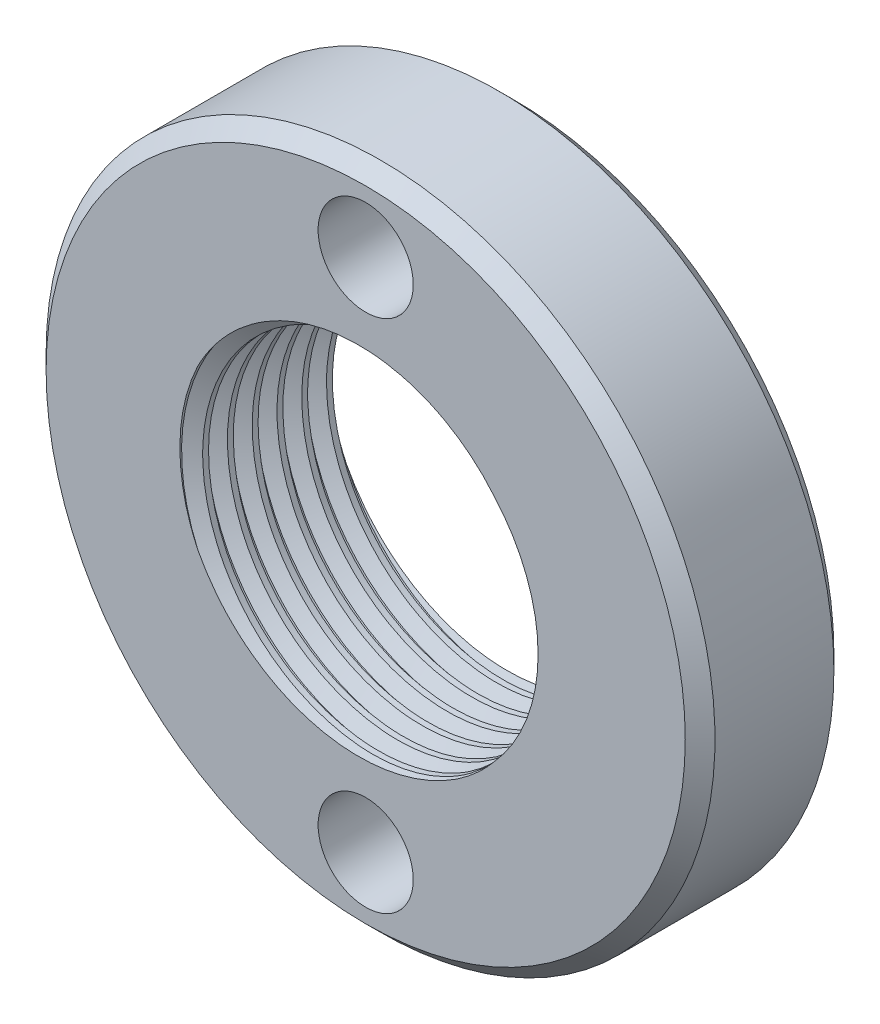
ISO-10303-21;
HEADER;
FILE_DESCRIPTION(('STEP AP214'),'2;1');
FILE_NAME('part.step','',(''),(''),'','','');
FILE_SCHEMA(('AUTOMOTIVE_DESIGN { 1 0 10303 214 1 1 1 1 }'));
ENDSEC;
DATA;
#1=APPLICATION_CONTEXT('core data for automotive mechanical design processes');
#2=APPLICATION_PROTOCOL_DEFINITION('international standard','automotive_design',2000,#1);
#3=PRODUCT_CONTEXT('',#1,'mechanical');
#4=PRODUCT('Part','Part','',(#3));
#5=PRODUCT_RELATED_PRODUCT_CATEGORY('part','',(#4));
#6=PRODUCT_DEFINITION_FORMATION('','',#4);
#7=PRODUCT_DEFINITION_CONTEXT('part definition',#1,'design');
#8=PRODUCT_DEFINITION('design','',#6,#7);
#9=PRODUCT_DEFINITION_SHAPE('','',#8);
#10=(LENGTH_UNIT() NAMED_UNIT(*) SI_UNIT(.MILLI.,.METRE.));
#11=(NAMED_UNIT(*) PLANE_ANGLE_UNIT() SI_UNIT($,.RADIAN.));
#12=(NAMED_UNIT(*) SI_UNIT($,.STERADIAN.) SOLID_ANGLE_UNIT());
#13=UNCERTAINTY_MEASURE_WITH_UNIT(LENGTH_MEASURE(1.E-05),#10,'distance_accuracy_value','');
#14=(GEOMETRIC_REPRESENTATION_CONTEXT(3) GLOBAL_UNCERTAINTY_ASSIGNED_CONTEXT((#13)) GLOBAL_UNIT_ASSIGNED_CONTEXT((#10,
#11,#12)) REPRESENTATION_CONTEXT('',''));
#15=CARTESIAN_POINT('',(0.,0.,0.));
#16=DIRECTION('',(0.,0.,1.));
#17=DIRECTION('',(1.,0.,0.));
#18=AXIS2_PLACEMENT_3D('',#15,#16,#17);
#19=CARTESIAN_POINT('',(0.,0.,3.81));
#20=DIRECTION('',(0.,0.,1.));
#21=DIRECTION('',(1.,0.,0.));
#22=AXIS2_PLACEMENT_3D('',#19,#20,#21);
#23=PLANE('',#22);
#24=CARTESIAN_POINT('',(0.,0.,3.81));
#25=DIRECTION('',(0.,0.,1.));
#26=DIRECTION('',(1.,0.,0.));
#27=AXIS2_PLACEMENT_3D('',#24,#25,#26);
#28=CIRCLE('',#27,8.1915);
#29=CARTESIAN_POINT('',(8.1915,0.,3.81));
#30=VERTEX_POINT('',#29);
#31=EDGE_CURVE('E13',#30,#30,#28,.T.);
#32=ORIENTED_EDGE('',*,*,#31,.T.);
#33=EDGE_LOOP('',(#32));
#34=FACE_BOUND('',#33,.T.);
#35=CARTESIAN_POINT('',(-4.30172657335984,-2.04366208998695,3.81));
#36=CARTESIAN_POINT('',(-4.23302218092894,-2.17508444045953,3.81000000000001));
#37=CARTESIAN_POINT('',(-4.15811316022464,-2.30326803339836,3.81));
#38=CARTESIAN_POINT('',(-3.99649680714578,-2.55228719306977,3.81));
#39=CARTESIAN_POINT('',(-3.9097691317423,-2.67310955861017,3.80999999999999));
#40=CARTESIAN_POINT('',(-3.73481528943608,-2.89413861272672,3.80999999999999));
#41=CARTESIAN_POINT('',(-3.64765258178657,-2.9951893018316,3.81));
#42=CARTESIAN_POINT('',(-3.4651320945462,-3.18958959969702,3.81));
#43=CARTESIAN_POINT('',(-3.36977491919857,-3.28293977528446,3.81));
#44=CARTESIAN_POINT('',(-3.17142825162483,-3.46137929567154,3.81));
#45=CARTESIAN_POINT('',(-3.06843002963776,-3.54645892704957,3.81));
#46=CARTESIAN_POINT('',(-2.85565818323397,-3.70761474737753,3.81));
#47=CARTESIAN_POINT('',(-2.74588726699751,-3.78369450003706,3.80999999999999));
#48=CARTESIAN_POINT('',(-2.57666961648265,-3.89069535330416,3.81));
#49=CARTESIAN_POINT('',(-2.51945898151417,-3.9251989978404,3.81));
#50=CARTESIAN_POINT('',(-2.40365720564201,-3.99177283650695,3.81));
#51=CARTESIAN_POINT('',(-2.3450664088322,-4.02384362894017,3.81));
#52=CARTESIAN_POINT('',(-2.16726862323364,-4.1161676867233,3.81));
#53=CARTESIAN_POINT('',(-2.04601707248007,-4.17254481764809,3.81));
#54=CARTESIAN_POINT('',(-1.79912422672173,-4.27439669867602,3.81));
#55=CARTESIAN_POINT('',(-1.67348561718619,-4.31987798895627,3.81));
#56=CARTESIAN_POINT('',(-1.41865817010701,-4.39966969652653,3.81));
#57=CARTESIAN_POINT('',(-1.28946817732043,-4.43397643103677,3.81));
#58=CARTESIAN_POINT('',(-1.03257486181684,-4.49025041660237,3.81));
#59=CARTESIAN_POINT('',(-0.904947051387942,-4.51256318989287,3.81));
#60=CARTESIAN_POINT('',(-0.648256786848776,-4.54625542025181,3.81));
#61=CARTESIAN_POINT('',(-0.51919435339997,-4.55763503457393,3.81));
#62=CARTESIAN_POINT('',(-0.260542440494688,-4.56937865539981,3.81));
#63=CARTESIAN_POINT('',(-0.130952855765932,-4.56974034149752,3.81));
#64=CARTESIAN_POINT('',(0.127742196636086,-4.55944121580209,3.81));
#65=CARTESIAN_POINT('',(0.256847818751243,-4.54878428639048,3.81));
#66=CARTESIAN_POINT('',(0.512487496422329,-4.51668162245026,3.81));
#67=CARTESIAN_POINT('',(0.639034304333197,-4.4953373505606,3.81));
#68=CARTESIAN_POINT('',(0.889832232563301,-4.44207500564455,3.81));
#69=CARTESIAN_POINT('',(1.01408421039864,-4.41016097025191,3.81));
#70=CARTESIAN_POINT('',(1.25955061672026,-4.3359570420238,3.81));
#71=CARTESIAN_POINT('',(1.38076276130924,-4.29365959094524,3.81));
#72=CARTESIAN_POINT('',(1.61919177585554,-4.19900211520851,3.81));
#73=CARTESIAN_POINT('',(1.73640851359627,-4.14664175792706,3.80999999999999));
#74=CARTESIAN_POINT('',(1.96624947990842,-4.03212076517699,3.80999999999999));
#75=CARTESIAN_POINT('',(2.07886456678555,-3.9699417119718,3.81));
#76=CARTESIAN_POINT('',(2.24352030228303,-3.86970992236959,3.81));
#77=CARTESIAN_POINT('',(2.29770269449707,-3.83513272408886,3.81));
#78=CARTESIAN_POINT('',(2.40448233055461,-3.76361218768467,3.81));
#79=CARTESIAN_POINT('',(2.45707960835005,-3.72666890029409,3.81));
#80=CARTESIAN_POINT('',(2.61213077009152,-3.61259120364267,3.81));
#81=CARTESIAN_POINT('',(2.71210551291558,-3.5320498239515,3.81));
#82=CARTESIAN_POINT('',(2.90454342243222,-3.36254535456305,3.81));
#83=CARTESIAN_POINT('',(2.99701096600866,-3.27358723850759,3.81));
#84=CARTESIAN_POINT('',(3.11902964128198,-3.1454280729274,3.81));
#85=CARTESIAN_POINT('',(3.15208909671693,-3.10952085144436,3.81));
#86=CARTESIAN_POINT('',(3.21695343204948,-3.03666149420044,3.81));
#87=CARTESIAN_POINT('',(3.2487596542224,-2.99971055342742,3.81));
#88=CARTESIAN_POINT('',(3.27994370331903,-2.96223453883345,3.81));
#89=B_SPLINE_CURVE_WITH_KNOTS('',3,(#35,#36,#37,#38,#39,#40,#41,#42,#43,#44,#45,#46,#47,#48,#49,
#50,#51,#52,#53,#54,#55,#56,#57,#58,#59,#60,#61,#62,#63,#64,#65,#66,#67,#68,#69,#70,#71,#72,#73,
#74,#75,#76,#77,#78,#79,#80,#81,#82,#83,#84,#85,#86,#87,#88),.UNSPECIFIED.,.F.,.F.,(4,2,2,2,2,2,
2,2,2,2,2,2,2,2,2,2,2,2,2,2,2,2,2,2,2,2,4),(0.,0.444741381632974,0.890258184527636,
1.29014000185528,1.6899923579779,2.09030879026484,2.49046617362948,2.69084508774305,
2.89117456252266,3.29176560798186,3.69211559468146,4.09259739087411,4.48082219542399,
4.86904141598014,5.25734239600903,5.64550660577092,6.03005364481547,6.41445395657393,
6.79913491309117,7.1838285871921,7.56925262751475,7.76202611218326,7.95479546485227,
8.33941900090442,8.72381665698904,8.87022014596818,9.01646231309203),.UNSPECIFIED.);
#90=CARTESIAN_POINT('',(-4.30172657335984,-2.04366208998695,3.81));
#91=VERTEX_POINT('',#90);
#92=CARTESIAN_POINT('',(3.27994370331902,-2.96223453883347,3.81));
#93=VERTEX_POINT('',#92);
#94=EDGE_CURVE('E125',#91,#93,#89,.T.);
#95=ORIENTED_EDGE('',*,*,#94,.F.);
#96=CARTESIAN_POINT('',(-4.30172657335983,2.04366208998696,3.81));
#97=CARTESIAN_POINT('',(-4.32716180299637,1.99013607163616,3.81));
#98=CARTESIAN_POINT('',(-4.351599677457,1.93611403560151,3.81));
#99=CARTESIAN_POINT('',(-4.46897078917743,1.6631665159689,3.81));
#100=CARTESIAN_POINT('',(-4.54662134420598,1.43741670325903,3.80999999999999));
#101=CARTESIAN_POINT('',(-4.66794832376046,0.97449952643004,3.80999999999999));
#102=CARTESIAN_POINT('',(-4.71124804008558,0.737235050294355,3.81));
#103=CARTESIAN_POINT('',(-4.76157738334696,0.258356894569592,3.81));
#104=CARTESIAN_POINT('',(-4.76854544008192,0.016736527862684,3.81));
#105=CARTESIAN_POINT('',(-4.75094100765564,-0.357774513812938,3.81));
#106=CARTESIAN_POINT('',(-4.73898070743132,-0.491384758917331,3.81));
#107=CARTESIAN_POINT('',(-4.70384110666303,-0.757110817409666,3.81));
#108=CARTESIAN_POINT('',(-4.68066533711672,-0.889227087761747,3.81));
#109=CARTESIAN_POINT('',(-4.62330349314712,-1.15081923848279,3.81));
#110=CARTESIAN_POINT('',(-4.58913446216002,-1.2802988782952,3.81));
#111=CARTESIAN_POINT('',(-4.51003232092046,-1.53586675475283,3.81));
#112=CARTESIAN_POINT('',(-4.46510581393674,-1.66195701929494,3.81));
#113=CARTESIAN_POINT('',(-4.3973628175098,-1.82943027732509,3.81));
#114=CARTESIAN_POINT('',(-4.37911030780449,-1.87270011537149,3.81));
#115=CARTESIAN_POINT('',(-4.34135565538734,-1.95863103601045,3.81));
#116=CARTESIAN_POINT('',(-4.32185499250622,-2.00129276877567,3.81));
#117=CARTESIAN_POINT('',(-4.30172657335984,-2.04366208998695,3.80999999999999));
#118=B_SPLINE_CURVE_WITH_KNOTS('',3,(#96,#97,#98,#99,#100,#101,#102,#103,#104,#105,#106,#107,
#108,#109,#110,#111,#112,#113,#114,#115,#116,#117),.UNSPECIFIED.,.F.,.F.,(4,2,2,2,2,2,2,2,2,2,
4),(0.,0.177830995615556,0.891033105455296,1.61195240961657,2.33409303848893,2.7361203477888,
3.13802116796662,3.53930187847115,3.94033689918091,4.08120776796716,4.22191460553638),.UNSPECIFIED.);
#119=CARTESIAN_POINT('',(-4.30172657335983,2.04366208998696,3.81));
#120=VERTEX_POINT('',#119);
#121=EDGE_CURVE('E130',#120,#91,#118,.T.);
#122=ORIENTED_EDGE('',*,*,#121,.F.);
#123=CARTESIAN_POINT('',(3.27994370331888,2.96223453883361,3.81));
#124=CARTESIAN_POINT('',(3.18492324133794,3.0764465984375,3.80999999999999));
#125=CARTESIAN_POINT('',(3.08411071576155,3.18575284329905,3.81));
#126=CARTESIAN_POINT('',(2.92493676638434,3.34165501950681,3.81));
#127=CARTESIAN_POINT('',(2.87051999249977,3.39230582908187,3.81));
#128=CARTESIAN_POINT('',(2.75917138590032,3.49077822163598,3.81));
#129=CARTESIAN_POINT('',(2.70223910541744,3.53859929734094,3.80999999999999));
#130=CARTESIAN_POINT('',(2.54621878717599,3.66302095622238,3.80999999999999));
#131=CARTESIAN_POINT('',(2.4449449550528,3.73692038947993,3.81));
#132=CARTESIAN_POINT('',(2.28857429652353,3.84101188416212,3.81));
#133=CARTESIAN_POINT('',(2.23569354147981,3.87459038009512,3.81));
#134=CARTESIAN_POINT('',(2.12858339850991,3.93954432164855,3.81));
#135=CARTESIAN_POINT('',(2.07435377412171,3.97091937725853,3.81));
#136=CARTESIAN_POINT('',(1.90972429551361,4.0616920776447,3.81));
#137=CARTESIAN_POINT('',(1.79742980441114,4.11770672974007,3.81));
#138=CARTESIAN_POINT('',(1.56861463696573,4.22030385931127,3.81));
#139=CARTESIAN_POINT('',(1.4520925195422,4.26688308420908,3.81));
#140=CARTESIAN_POINT('',(1.09545925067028,4.39262282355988,3.81));
#141=CARTESIAN_POINT('',(0.849906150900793,4.45688990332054,3.81));
#142=CARTESIAN_POINT('',(0.3516059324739,4.54381212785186,3.81));
#143=CARTESIAN_POINT('',(0.0988604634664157,4.56647673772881,3.81));
#144=CARTESIAN_POINT('',(-0.282088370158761,4.56893389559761,3.81));
#145=CARTESIAN_POINT('',(-0.41035889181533,4.56433767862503,3.81));
#146=CARTESIAN_POINT('',(-0.666041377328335,4.54436022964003,3.81));
#147=CARTESIAN_POINT('',(-0.793453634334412,4.52898289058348,3.81));
#148=CARTESIAN_POINT('',(-1.04652780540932,4.48754889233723,3.81));
#149=CARTESIAN_POINT('',(-1.17218964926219,4.46149180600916,3.81));
#150=CARTESIAN_POINT('',(-1.4208653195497,4.39889151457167,3.81));
#151=CARTESIAN_POINT('',(-1.54387926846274,4.36234879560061,3.81));
#152=CARTESIAN_POINT('',(-1.78632596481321,4.27905081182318,3.81));
#153=CARTESIAN_POINT('',(-1.90576100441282,4.23230224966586,3.81));
#154=CARTESIAN_POINT('',(-2.08162477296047,4.15479128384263,3.81));
#155=CARTESIAN_POINT('',(-2.13970509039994,4.12771901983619,3.81));
#156=CARTESIAN_POINT('',(-2.25466624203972,4.07113603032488,3.81));
#157=CARTESIAN_POINT('',(-2.31154705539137,4.04162526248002,3.81));
#158=CARTESIAN_POINT('',(-2.48038118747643,3.94962486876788,3.81));
#159=CARTESIAN_POINT('',(-2.59047920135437,3.8836880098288,3.81));
#160=CARTESIAN_POINT('',(-2.80496741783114,3.74313550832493,3.81));
#161=CARTESIAN_POINT('',(-2.90935768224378,3.66851995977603,3.81));
#162=CARTESIAN_POINT('',(-3.11390410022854,3.50940554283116,3.81));
#163=CARTESIAN_POINT('',(-3.21392346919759,3.4247306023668,3.81));
#164=CARTESIAN_POINT('',(-3.40662839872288,3.24739048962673,3.81));
#165=CARTESIAN_POINT('',(-3.49931310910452,3.15472439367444,3.81));
#166=CARTESIAN_POINT('',(-3.6765478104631,2.96221143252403,3.81));
#167=CARTESIAN_POINT('',(-3.76111142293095,2.86237710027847,3.81));
#168=CARTESIAN_POINT('',(-3.92170232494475,2.65606943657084,3.81));
#169=CARTESIAN_POINT('',(-3.99773077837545,2.54959701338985,3.81));
#170=CARTESIAN_POINT('',(-4.11117917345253,2.37598041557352,3.81));
#171=CARTESIAN_POINT('',(-4.15157355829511,2.31076014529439,3.81));
#172=CARTESIAN_POINT('',(-4.22909789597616,2.1785346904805,3.81));
#173=CARTESIAN_POINT('',(-4.26623250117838,2.11153223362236,3.81));
#174=CARTESIAN_POINT('',(-4.30172657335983,2.04366208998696,3.80999999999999));
#175=B_SPLINE_CURVE_WITH_KNOTS('',3,(#123,#124,#125,#126,#127,#128,#129,#130,#131,#132,#133,
#134,#135,#136,#137,#138,#139,#140,#141,#142,#143,#144,#145,#146,#147,#148,#149,#150,#151,#152,
#153,#154,#155,#156,#157,#158,#159,#160,#161,#162,#163,#164,#165,#166,#167,#168,#169,#170,#171,
#172,#173,#174),.UNSPECIFIED.,.F.,.F.,(4,2,2,2,2,2,2,2,2,2,2,2,2,2,2,2,2,2,2,2,2,2,2,2,2,4),(0.,
0.445363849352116,0.668297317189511,0.891270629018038,1.26683649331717,1.45471410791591,
1.64262489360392,2.01861151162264,2.39472751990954,3.15245777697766,3.91001561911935,
4.29469046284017,4.67922647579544,5.06377786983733,5.44831143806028,5.83259322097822,
6.02478311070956,6.21697633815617,6.6015165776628,6.98605265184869,7.37874552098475,
7.77148384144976,8.16355147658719,8.55556558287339,8.78563291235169,9.01536636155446),.UNSPECIFIED.);
#176=CARTESIAN_POINT('',(3.27994370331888,2.96223453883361,3.81));
#177=VERTEX_POINT('',#176);
#178=EDGE_CURVE('E134',#177,#120,#175,.T.);
#179=ORIENTED_EDGE('',*,*,#178,.F.);
#180=CARTESIAN_POINT('',(0.,0.,3.81));
#181=DIRECTION('',(0.,0.,1.));
#182=DIRECTION('',(1.,0.,0.));
#183=AXIS2_PLACEMENT_3D('',#180,#181,#182);
#184=CIRCLE('',#183,4.4196);
#185=EDGE_CURVE('E118',#93,#177,#184,.T.);
#186=ORIENTED_EDGE('',*,*,#185,.F.);
#187=EDGE_LOOP('',(#95,#122,#179,#186));
#188=FACE_BOUND('',#187,.T.);
#189=CARTESIAN_POINT('',(0.,6.604,3.81));
#190=DIRECTION('',(0.,0.,1.));
#191=DIRECTION('',(1.,0.,0.));
#192=AXIS2_PLACEMENT_3D('',#189,#190,#191);
#193=CIRCLE('',#192,1.2192);
#194=CARTESIAN_POINT('',(1.2192,6.604,3.81));
#195=VERTEX_POINT('',#194);
#196=EDGE_CURVE('E362',#195,#195,#193,.T.);
#197=ORIENTED_EDGE('',*,*,#196,.F.);
#198=EDGE_LOOP('',(#197));
#199=FACE_BOUND('',#198,.T.);
#200=CARTESIAN_POINT('',(0.,-6.604,3.81));
#201=DIRECTION('',(0.,0.,1.));
#202=DIRECTION('',(1.,0.,0.));
#203=AXIS2_PLACEMENT_3D('',#200,#201,#202);
#204=CIRCLE('',#203,1.2192);
#205=CARTESIAN_POINT('',(1.2192,-6.604,3.81));
#206=VERTEX_POINT('',#205);
#207=EDGE_CURVE('E137',#206,#206,#204,.T.);
#208=ORIENTED_EDGE('',*,*,#207,.F.);
#209=EDGE_LOOP('',(#208));
#210=FACE_BOUND('',#209,.T.);
#211=ADVANCED_FACE('F71',(#34,#188,#199,#210),#23,.T.);
#212=CARTESIAN_POINT('',(0.,0.,0.));
#213=DIRECTION('',(0.,0.,1.));
#214=DIRECTION('',(1.,0.,0.));
#215=AXIS2_PLACEMENT_3D('',#212,#213,#214);
#216=PLANE('',#215);
#217=CARTESIAN_POINT('',(0.,0.,0.));
#218=DIRECTION('',(0.,0.,1.));
#219=DIRECTION('',(1.,0.,0.));
#220=AXIS2_PLACEMENT_3D('',#217,#218,#219);
#221=CIRCLE('',#220,8.1915);
#222=CARTESIAN_POINT('',(8.1915,0.,0.));
#223=VERTEX_POINT('',#222);
#224=EDGE_CURVE('E79',#223,#223,#221,.F.);
#225=ORIENTED_EDGE('',*,*,#224,.T.);
#226=EDGE_LOOP('',(#225));
#227=FACE_BOUND('',#226,.T.);
#228=CARTESIAN_POINT('',(-4.30172657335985,2.04366208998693,0.));
#229=CARTESIAN_POINT('',(-4.32716180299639,1.99013607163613,0.));
#230=CARTESIAN_POINT('',(-4.35159967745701,1.93611403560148,0.));
#231=CARTESIAN_POINT('',(-4.46897078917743,1.66316651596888,0.));
#232=CARTESIAN_POINT('',(-4.54662134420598,1.43741670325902,0.));
#233=CARTESIAN_POINT('',(-4.66794832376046,0.974499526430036,0.));
#234=CARTESIAN_POINT('',(-4.71124804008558,0.737235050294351,0.));
#235=CARTESIAN_POINT('',(-4.76157738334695,0.25835689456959,0.));
#236=CARTESIAN_POINT('',(-4.76854544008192,0.0167365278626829,0.));
#237=CARTESIAN_POINT('',(-4.75094100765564,-0.357774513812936,0.));
#238=CARTESIAN_POINT('',(-4.73898070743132,-0.491384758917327,0.));
#239=CARTESIAN_POINT('',(-4.70384110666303,-0.757110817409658,0.));
#240=CARTESIAN_POINT('',(-4.68066533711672,-0.889227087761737,0.));
#241=CARTESIAN_POINT('',(-4.62330349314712,-1.15081923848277,0.));
#242=CARTESIAN_POINT('',(-4.58913446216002,-1.28029887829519,0.));
#243=CARTESIAN_POINT('',(-4.51003232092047,-1.53586675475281,0.));
#244=CARTESIAN_POINT('',(-4.46510581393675,-1.66195701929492,0.));
#245=CARTESIAN_POINT('',(-4.39736281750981,-1.82943027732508,0.));
#246=CARTESIAN_POINT('',(-4.37911030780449,-1.87270011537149,0.));
#247=CARTESIAN_POINT('',(-4.34135565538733,-1.95863103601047,0.));
#248=CARTESIAN_POINT('',(-4.3218549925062,-2.00129276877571,0.));
#249=CARTESIAN_POINT('',(-4.30172657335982,-2.04366208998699,0.));
#250=B_SPLINE_CURVE_WITH_KNOTS('',3,(#228,#229,#230,#231,#232,#233,#234,#235,#236,#237,#238,
#239,#240,#241,#242,#243,#244,#245,#246,#247,#248,#249),.UNSPECIFIED.,.F.,.F.,(4,2,2,2,2,2,2,2,
2,2,4),(0.,0.177830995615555,0.891033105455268,1.61195240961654,2.3340930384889,
2.73612034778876,3.13802116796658,3.5393018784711,3.94033689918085,4.08120776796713,
4.22191460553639),.UNSPECIFIED.);
#251=CARTESIAN_POINT('',(-4.30172657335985,2.04366208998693,0.));
#252=VERTEX_POINT('',#251);
#253=CARTESIAN_POINT('',(-4.30172657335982,-2.04366208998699,0.));
#254=VERTEX_POINT('',#253);
#255=EDGE_CURVE('E121',#252,#254,#250,.T.);
#256=ORIENTED_EDGE('',*,*,#255,.T.);
#257=CARTESIAN_POINT('',(-4.30172657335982,-2.04366208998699,0.));
#258=CARTESIAN_POINT('',(-4.23302218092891,-2.17508444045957,0.));
#259=CARTESIAN_POINT('',(-4.15811316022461,-2.30326803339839,0.));
#260=CARTESIAN_POINT('',(-3.99649680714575,-2.55228719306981,0.));
#261=CARTESIAN_POINT('',(-3.90976913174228,-2.67310955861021,0.));
#262=CARTESIAN_POINT('',(-3.73481528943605,-2.89413861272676,0.));
#263=CARTESIAN_POINT('',(-3.64765258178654,-2.99518930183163,0.));
#264=CARTESIAN_POINT('',(-3.46513209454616,-3.18958959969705,0.));
#265=CARTESIAN_POINT('',(-3.36977491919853,-3.28293977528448,0.));
#266=CARTESIAN_POINT('',(-3.17142825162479,-3.46137929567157,0.));
#267=CARTESIAN_POINT('',(-3.06843002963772,-3.54645892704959,0.));
#268=CARTESIAN_POINT('',(-2.85565818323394,-3.70761474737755,0.));
#269=CARTESIAN_POINT('',(-2.74588726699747,-3.78369450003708,0.));
#270=CARTESIAN_POINT('',(-2.57666961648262,-3.89069535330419,0.));
#271=CARTESIAN_POINT('',(-2.51945898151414,-3.92519899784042,0.));
#272=CARTESIAN_POINT('',(-2.40365720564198,-3.99177283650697,0.));
#273=CARTESIAN_POINT('',(-2.34506640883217,-4.02384362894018,0.));
#274=CARTESIAN_POINT('',(-2.1672686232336,-4.11616768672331,0.));
#275=CARTESIAN_POINT('',(-2.04601707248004,-4.1725448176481,0.));
#276=CARTESIAN_POINT('',(-1.7991242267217,-4.27439669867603,0.));
#277=CARTESIAN_POINT('',(-1.67348561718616,-4.31987798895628,0.));
#278=CARTESIAN_POINT('',(-1.41865817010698,-4.39966969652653,0.));
#279=CARTESIAN_POINT('',(-1.2894681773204,-4.43397643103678,0.));
#280=CARTESIAN_POINT('',(-1.03257486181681,-4.49025041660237,0.));
#281=CARTESIAN_POINT('',(-0.904947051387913,-4.51256318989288,0.));
#282=CARTESIAN_POINT('',(-0.648256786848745,-4.54625542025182,0.));
#283=CARTESIAN_POINT('',(-0.519194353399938,-4.55763503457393,0.));
#284=CARTESIAN_POINT('',(-0.260542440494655,-4.56937865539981,0.));
#285=CARTESIAN_POINT('',(-0.130952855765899,-4.56974034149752,0.));
#286=CARTESIAN_POINT('',(0.127742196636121,-4.55944121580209,0.));
#287=CARTESIAN_POINT('',(0.256847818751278,-4.54878428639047,0.));
#288=CARTESIAN_POINT('',(0.512487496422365,-4.51668162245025,0.));
#289=CARTESIAN_POINT('',(0.639034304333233,-4.4953373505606,0.));
#290=CARTESIAN_POINT('',(0.889832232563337,-4.44207500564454,0.));
#291=CARTESIAN_POINT('',(1.01408421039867,-4.4101609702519,0.));
#292=CARTESIAN_POINT('',(1.2595506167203,-4.33595704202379,0.));
#293=CARTESIAN_POINT('',(1.38076276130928,-4.29365959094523,0.));
#294=CARTESIAN_POINT('',(1.61919177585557,-4.19900211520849,0.));
#295=CARTESIAN_POINT('',(1.73640851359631,-4.14664175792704,0.));
#296=CARTESIAN_POINT('',(1.96624947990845,-4.03212076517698,0.));
#297=CARTESIAN_POINT('',(2.07886456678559,-3.96994171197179,0.));
#298=CARTESIAN_POINT('',(2.24352030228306,-3.86970992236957,0.));
#299=CARTESIAN_POINT('',(2.2977026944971,-3.83513272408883,0.));
#300=CARTESIAN_POINT('',(2.40448233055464,-3.76361218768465,0.));
#301=CARTESIAN_POINT('',(2.45707960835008,-3.72666890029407,0.));
#302=CARTESIAN_POINT('',(2.61213077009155,-3.61259120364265,0.));
#303=CARTESIAN_POINT('',(2.71210551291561,-3.53204982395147,0.));
#304=CARTESIAN_POINT('',(2.90454342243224,-3.36254535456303,0.));
#305=CARTESIAN_POINT('',(2.99701096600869,-3.27358723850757,0.));
#306=CARTESIAN_POINT('',(3.119029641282,-3.14542807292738,0.));
#307=CARTESIAN_POINT('',(3.15208909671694,-3.10952085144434,0.));
#308=CARTESIAN_POINT('',(3.21695343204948,-3.03666149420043,0.));
#309=CARTESIAN_POINT('',(3.2487596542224,-2.99971055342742,0.));
#310=CARTESIAN_POINT('',(3.27994370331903,-2.96223453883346,0.));
#311=B_SPLINE_CURVE_WITH_KNOTS('',3,(#257,#258,#259,#260,#261,#262,#263,#264,#265,#266,#267,
#268,#269,#270,#271,#272,#273,#274,#275,#276,#277,#278,#279,#280,#281,#282,#283,#284,#285,#286,
#287,#288,#289,#290,#291,#292,#293,#294,#295,#296,#297,#298,#299,#300,#301,#302,#303,#304,#305,
#306,#307,#308,#309,#310),.UNSPECIFIED.,.F.,.F.,(4,2,2,2,2,2,2,2,2,2,2,2,2,2,2,2,2,2,2,2,2,2,2,
2,2,2,4),(0.,0.444741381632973,0.890258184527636,1.29014000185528,1.6899923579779,
2.09030879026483,2.49046617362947,2.69084508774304,2.89117456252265,3.29176560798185,
3.69211559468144,4.09259739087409,4.48082219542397,4.86904141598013,5.25734239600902,
5.64550660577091,6.03005364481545,6.41445395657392,6.79913491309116,7.18382858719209,
7.56925262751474,7.76202611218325,7.95479546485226,8.33941900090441,8.72381665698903,
8.87022014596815,9.01646231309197),.UNSPECIFIED.);
#312=CARTESIAN_POINT('',(3.27994370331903,-2.96223453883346,0.));
#313=VERTEX_POINT('',#312);
#314=EDGE_CURVE('E94',#254,#313,#311,.T.);
#315=ORIENTED_EDGE('',*,*,#314,.T.);
#316=CARTESIAN_POINT('',(0.,0.,0.));
#317=DIRECTION('',(0.,0.,1.));
#318=DIRECTION('',(1.,0.,0.));
#319=AXIS2_PLACEMENT_3D('',#316,#317,#318);
#320=CIRCLE('',#319,4.4196);
#321=CARTESIAN_POINT('',(3.27994370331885,2.96223453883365,0.));
#322=VERTEX_POINT('',#321);
#323=EDGE_CURVE('E120',#313,#322,#320,.T.);
#324=ORIENTED_EDGE('',*,*,#323,.T.);
#325=CARTESIAN_POINT('',(3.27994370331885,2.96223453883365,0.));
#326=CARTESIAN_POINT('',(3.18492324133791,3.07644659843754,0.));
#327=CARTESIAN_POINT('',(3.08411071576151,3.18575284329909,0.));
#328=CARTESIAN_POINT('',(2.92493676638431,3.34165501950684,0.));
#329=CARTESIAN_POINT('',(2.87051999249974,3.3923058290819,0.));
#330=CARTESIAN_POINT('',(2.75917138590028,3.49077822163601,0.));
#331=CARTESIAN_POINT('',(2.70223910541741,3.53859929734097,0.));
#332=CARTESIAN_POINT('',(2.54621878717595,3.6630209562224,0.));
#333=CARTESIAN_POINT('',(2.44494495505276,3.73692038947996,0.));
#334=CARTESIAN_POINT('',(2.28857429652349,3.84101188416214,0.));
#335=CARTESIAN_POINT('',(2.23569354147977,3.87459038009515,0.));
#336=CARTESIAN_POINT('',(2.12858339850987,3.93954432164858,0.));
#337=CARTESIAN_POINT('',(2.07435377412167,3.97091937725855,0.));
#338=CARTESIAN_POINT('',(1.90972429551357,4.06169207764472,0.));
#339=CARTESIAN_POINT('',(1.79742980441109,4.11770672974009,0.));
#340=CARTESIAN_POINT('',(1.56861463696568,4.22030385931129,0.));
#341=CARTESIAN_POINT('',(1.45209251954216,4.26688308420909,0.));
#342=CARTESIAN_POINT('',(1.09545925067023,4.3926228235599,0.));
#343=CARTESIAN_POINT('',(0.849906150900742,4.45688990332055,0.));
#344=CARTESIAN_POINT('',(0.351605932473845,4.54381212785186,0.));
#345=CARTESIAN_POINT('',(0.0988604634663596,4.56647673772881,0.));
#346=CARTESIAN_POINT('',(-0.28208837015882,4.56893389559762,0.));
#347=CARTESIAN_POINT('',(-0.41035889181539,4.56433767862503,0.));
#348=CARTESIAN_POINT('',(-0.666041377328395,4.54436022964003,0.));
#349=CARTESIAN_POINT('',(-0.793453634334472,4.52898289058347,0.));
#350=CARTESIAN_POINT('',(-1.04652780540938,4.48754889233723,0.));
#351=CARTESIAN_POINT('',(-1.17218964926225,4.46149180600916,0.));
#352=CARTESIAN_POINT('',(-1.42086531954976,4.39889151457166,0.));
#353=CARTESIAN_POINT('',(-1.5438792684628,4.36234879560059,0.));
#354=CARTESIAN_POINT('',(-1.78632596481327,4.27905081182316,0.));
#355=CARTESIAN_POINT('',(-1.90576100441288,4.23230224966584,0.));
#356=CARTESIAN_POINT('',(-2.08162477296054,4.15479128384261,0.));
#357=CARTESIAN_POINT('',(-2.13970509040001,4.12771901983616,0.));
#358=CARTESIAN_POINT('',(-2.25466624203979,4.07113603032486,0.));
#359=CARTESIAN_POINT('',(-2.31154705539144,4.04162526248,0.));
#360=CARTESIAN_POINT('',(-2.4803811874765,3.94962486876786,0.));
#361=CARTESIAN_POINT('',(-2.59047920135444,3.88368800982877,0.));
#362=CARTESIAN_POINT('',(-2.80496741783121,3.74313550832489,0.));
#363=CARTESIAN_POINT('',(-2.90935768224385,3.66851995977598,0.));
#364=CARTESIAN_POINT('',(-3.11390410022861,3.5094055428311,0.));
#365=CARTESIAN_POINT('',(-3.21392346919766,3.42473060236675,0.));
#366=CARTESIAN_POINT('',(-3.40662839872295,3.24739048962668,0.));
#367=CARTESIAN_POINT('',(-3.49931310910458,3.15472439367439,0.));
#368=CARTESIAN_POINT('',(-3.67654781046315,2.96221143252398,0.));
#369=CARTESIAN_POINT('',(-3.76111142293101,2.86237710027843,0.));
#370=CARTESIAN_POINT('',(-3.92170232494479,2.65606943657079,0.));
#371=CARTESIAN_POINT('',(-3.99773077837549,2.54959701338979,0.));
#372=CARTESIAN_POINT('',(-4.11117917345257,2.37598041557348,0.));
#373=CARTESIAN_POINT('',(-4.15157355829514,2.31076014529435,0.));
#374=CARTESIAN_POINT('',(-4.22909789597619,2.17853469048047,0.));
#375=CARTESIAN_POINT('',(-4.26623250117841,2.11153223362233,0.));
#376=CARTESIAN_POINT('',(-4.30172657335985,2.04366208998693,0.));
#377=B_SPLINE_CURVE_WITH_KNOTS('',3,(#325,#326,#327,#328,#329,#330,#331,#332,#333,#334,#335,
#336,#337,#338,#339,#340,#341,#342,#343,#344,#345,#346,#347,#348,#349,#350,#351,#352,#353,#354,
#355,#356,#357,#358,#359,#360,#361,#362,#363,#364,#365,#366,#367,#368,#369,#370,#371,#372,#373,
#374,#375,#376),.UNSPECIFIED.,.F.,.F.,(4,2,2,2,2,2,2,2,2,2,2,2,2,2,2,2,2,2,2,2,2,2,2,2,2,4),(0.,
0.445363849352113,0.668297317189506,0.891270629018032,1.26683649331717,1.4547141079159,
1.64262489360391,2.01861151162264,2.39472751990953,3.15245777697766,3.91001561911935,
4.29469046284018,4.67922647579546,5.06377786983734,5.4483114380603,5.83259322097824,
6.02478311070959,6.21697633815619,6.60151657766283,6.98605265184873,7.37874552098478,
7.77148384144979,8.16355147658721,8.55556558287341,8.78563291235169,9.01536636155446),.UNSPECIFIED.);
#378=EDGE_CURVE('E86',#322,#252,#377,.T.);
#379=ORIENTED_EDGE('',*,*,#378,.T.);
#380=EDGE_LOOP('',(#256,#315,#324,#379));
#381=FACE_BOUND('',#380,.T.);
#382=ADVANCED_FACE('F162',(#227,#381),#216,.F.);
#383=CARTESIAN_POINT('',(0.,0.,3.81));
#384=DIRECTION('',(0.,0.,-1.));
#385=DIRECTION('',(-1.,0.,0.));
#386=AXIS2_PLACEMENT_3D('',#383,#384,#385);
#387=CYLINDRICAL_SURFACE('',#386,8.5725);
#388=CARTESIAN_POINT('',(0.,0.,0.380999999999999));
#389=DIRECTION('',(0.,0.,1.));
#390=DIRECTION('',(1.,0.,0.));
#391=AXIS2_PLACEMENT_3D('',#388,#389,#390);
#392=CIRCLE('',#391,8.5725);
#393=CARTESIAN_POINT('',(-8.5725,0.,0.380999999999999));
#394=VERTEX_POINT('',#393);
#395=EDGE_CURVE('E247',#394,#394,#392,.T.);
#396=CARTESIAN_POINT('',(0.,0.,3.429));
#397=DIRECTION('',(0.,0.,1.));
#398=DIRECTION('',(1.,0.,0.));
#399=AXIS2_PLACEMENT_3D('',#396,#397,#398);
#400=CIRCLE('',#399,8.5725);
#401=CARTESIAN_POINT('',(-8.5725,0.,3.429));
#402=VERTEX_POINT('',#401);
#403=EDGE_CURVE('E160',#402,#402,#400,.F.);
#404=CARTESIAN_POINT('',(-8.5725,0.,0.380999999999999));
#405=CARTESIAN_POINT('',(-8.5725,0.,0.412749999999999));
#406=CARTESIAN_POINT('',(-8.5725,0.,0.444499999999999));
#407=CARTESIAN_POINT('',(-8.5725,0.,0.507999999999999));
#408=CARTESIAN_POINT('',(-8.5725,0.,0.539749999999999));
#409=CARTESIAN_POINT('',(-8.5725,0.,0.603249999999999));
#410=CARTESIAN_POINT('',(-8.5725,0.,0.634999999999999));
#411=CARTESIAN_POINT('',(-8.5725,0.,0.698499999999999));
#412=CARTESIAN_POINT('',(-8.5725,0.,0.730249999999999));
#413=CARTESIAN_POINT('',(-8.5725,0.,0.793749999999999));
#414=CARTESIAN_POINT('',(-8.5725,0.,0.825499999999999));
#415=CARTESIAN_POINT('',(-8.5725,0.,0.888999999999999));
#416=CARTESIAN_POINT('',(-8.5725,0.,0.920749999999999));
#417=CARTESIAN_POINT('',(-8.5725,0.,0.984249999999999));
#418=CARTESIAN_POINT('',(-8.5725,0.,1.016));
#419=CARTESIAN_POINT('',(-8.5725,0.,1.0795));
#420=CARTESIAN_POINT('',(-8.5725,0.,1.11125));
#421=CARTESIAN_POINT('',(-8.5725,0.,1.17475));
#422=CARTESIAN_POINT('',(-8.5725,0.,1.2065));
#423=CARTESIAN_POINT('',(-8.5725,0.,1.27));
#424=CARTESIAN_POINT('',(-8.5725,0.,1.30175));
#425=CARTESIAN_POINT('',(-8.5725,0.,1.36525));
#426=CARTESIAN_POINT('',(-8.5725,0.,1.397));
#427=CARTESIAN_POINT('',(-8.5725,0.,1.4605));
#428=CARTESIAN_POINT('',(-8.5725,0.,1.49225));
#429=CARTESIAN_POINT('',(-8.5725,0.,1.55575));
#430=CARTESIAN_POINT('',(-8.5725,0.,1.5875));
#431=CARTESIAN_POINT('',(-8.5725,0.,1.651));
#432=CARTESIAN_POINT('',(-8.5725,0.,1.68275));
#433=CARTESIAN_POINT('',(-8.5725,0.,1.74625));
#434=CARTESIAN_POINT('',(-8.5725,0.,1.778));
#435=CARTESIAN_POINT('',(-8.5725,0.,1.8415));
#436=CARTESIAN_POINT('',(-8.5725,0.,1.87325));
#437=CARTESIAN_POINT('',(-8.5725,0.,1.93675));
#438=CARTESIAN_POINT('',(-8.5725,0.,1.9685));
#439=CARTESIAN_POINT('',(-8.5725,0.,2.032));
#440=CARTESIAN_POINT('',(-8.5725,0.,2.06375));
#441=CARTESIAN_POINT('',(-8.5725,0.,2.12725));
#442=CARTESIAN_POINT('',(-8.5725,0.,2.159));
#443=CARTESIAN_POINT('',(-8.5725,0.,2.2225));
#444=CARTESIAN_POINT('',(-8.5725,0.,2.25425));
#445=CARTESIAN_POINT('',(-8.5725,0.,2.31775));
#446=CARTESIAN_POINT('',(-8.5725,0.,2.3495));
#447=CARTESIAN_POINT('',(-8.5725,0.,2.413));
#448=CARTESIAN_POINT('',(-8.5725,0.,2.44475));
#449=CARTESIAN_POINT('',(-8.5725,0.,2.50825));
#450=CARTESIAN_POINT('',(-8.5725,0.,2.54));
#451=CARTESIAN_POINT('',(-8.5725,0.,2.6035));
#452=CARTESIAN_POINT('',(-8.5725,0.,2.63525));
#453=CARTESIAN_POINT('',(-8.5725,0.,2.69875));
#454=CARTESIAN_POINT('',(-8.5725,0.,2.7305));
#455=CARTESIAN_POINT('',(-8.5725,0.,2.794));
#456=CARTESIAN_POINT('',(-8.5725,0.,2.82575));
#457=CARTESIAN_POINT('',(-8.5725,0.,2.88925));
#458=CARTESIAN_POINT('',(-8.5725,0.,2.921));
#459=CARTESIAN_POINT('',(-8.5725,0.,2.9845));
#460=CARTESIAN_POINT('',(-8.5725,0.,3.01625));
#461=CARTESIAN_POINT('',(-8.5725,0.,3.07975));
#462=CARTESIAN_POINT('',(-8.5725,0.,3.1115));
#463=CARTESIAN_POINT('',(-8.5725,0.,3.175));
#464=CARTESIAN_POINT('',(-8.5725,0.,3.20675));
#465=CARTESIAN_POINT('',(-8.5725,0.,3.27025));
#466=CARTESIAN_POINT('',(-8.5725,0.,3.302));
#467=CARTESIAN_POINT('',(-8.5725,0.,3.3655));
#468=CARTESIAN_POINT('',(-8.5725,0.,3.39725));
#469=CARTESIAN_POINT('',(-8.5725,0.,3.429));
#470=B_SPLINE_CURVE_WITH_KNOTS('',3,(#404,#405,#406,#407,#408,#409,#410,#411,#412,#413,#414,
#415,#416,#417,#418,#419,#420,#421,#422,#423,#424,#425,#426,#427,#428,#429,#430,#431,#432,#433,
#434,#435,#436,#437,#438,#439,#440,#441,#442,#443,#444,#445,#446,#447,#448,#449,#450,#451,#452,
#453,#454,#455,#456,#457,#458,#459,#460,#461,#462,#463,#464,#465,#466,#467,#468,#469),
.UNSPECIFIED.,.F.,.F.,(4,2,2,2,2,2,2,2,2,2,2,2,2,2,2,2,2,2,2,2,2,2,2,2,2,2,2,2,2,2,2,2,4),(0.,
0.0952500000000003,0.1905,0.28575,0.381,0.476250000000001,0.5715,0.666750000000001,
0.762000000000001,0.857250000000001,0.952500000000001,1.04775,1.143,1.23825,1.3335,1.42875,
1.524,1.61925,1.7145,1.80975,1.905,2.00025,2.0955,2.19075,2.286,2.38125,2.4765,2.57175,2.667,
2.76225,2.8575,2.95275,3.048),.UNSPECIFIED.);
#471=EDGE_CURVE('BSEAM73',#394,#402,#470,.T.);
#472=ORIENTED_EDGE('',*,*,#395,.T.);
#473=ORIENTED_EDGE('',*,*,#403,.T.);
#474=ORIENTED_EDGE('',*,*,#471,.T.);
#475=ORIENTED_EDGE('',*,*,#471,.F.);
#476=EDGE_LOOP('',(#472,#474,#473,#475));
#477=FACE_BOUND('',#476,.T.);
#478=ADVANCED_FACE('F73',(#477),#387,.T.);
#479=CARTESIAN_POINT('',(0.,0.,3.81));
#480=DIRECTION('',(0.,0.,-1.));
#481=DIRECTION('',(-1.,0.,0.));
#482=AXIS2_PLACEMENT_3D('',#479,#480,#481);
#483=CYLINDRICAL_SURFACE('',#482,4.4196);
#484=ORIENTED_EDGE('',*,*,#323,.F.);
#485=CARTESIAN_POINT('',(-4.4196,0.,7.37757659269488));
#486=CARTESIAN_POINT('',(-4.4196,2.55165724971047,7.32465992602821));
#487=CARTESIAN_POINT('',(-2.2098,3.8274858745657,7.27174325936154));
#488=CARTESIAN_POINT('',(0.,5.10331449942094,7.21882659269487));
#489=CARTESIAN_POINT('',(2.2098,3.82748587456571,7.16590992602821));
#490=CARTESIAN_POINT('',(4.4196,2.55165724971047,7.11299325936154));
#491=CARTESIAN_POINT('',(4.4196,0.,7.06007659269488));
#492=CARTESIAN_POINT('',(4.4196,-2.55165724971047,7.00715992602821));
#493=CARTESIAN_POINT('',(2.2098,-3.8274858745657,6.95424325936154));
#494=CARTESIAN_POINT('',(0.,-5.10331449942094,6.90132659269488));
#495=CARTESIAN_POINT('',(-2.2098,-3.82748587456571,6.84840992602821));
#496=CARTESIAN_POINT('',(-4.4196,-2.55165724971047,6.79549325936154));
#497=CARTESIAN_POINT('',(-4.4196,0.,6.74257659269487));
#498=CARTESIAN_POINT('',(-4.4196,2.55165724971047,6.68965992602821));
#499=CARTESIAN_POINT('',(-2.2098,3.8274858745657,6.63674325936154));
#500=CARTESIAN_POINT('',(0.,5.10331449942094,6.58382659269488));
#501=CARTESIAN_POINT('',(2.2098,3.82748587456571,6.53090992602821));
#502=CARTESIAN_POINT('',(4.4196,2.55165724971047,6.47799325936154));
#503=CARTESIAN_POINT('',(4.4196,0.,6.42507659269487));
#504=CARTESIAN_POINT('',(4.4196,-2.55165724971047,6.37215992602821));
#505=CARTESIAN_POINT('',(2.2098,-3.8274858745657,6.31924325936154));
#506=CARTESIAN_POINT('',(0.,-5.10331449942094,6.26632659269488));
#507=CARTESIAN_POINT('',(-2.2098,-3.82748587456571,6.21340992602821));
#508=CARTESIAN_POINT('',(-4.4196,-2.55165724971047,6.16049325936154));
#509=CARTESIAN_POINT('',(-4.4196,0.,6.10757659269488));
#510=CARTESIAN_POINT('',(-4.4196,2.55165724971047,6.05465992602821));
#511=CARTESIAN_POINT('',(-2.2098,3.8274858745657,6.00174325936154));
#512=CARTESIAN_POINT('',(0.,5.10331449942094,5.94882659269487));
#513=CARTESIAN_POINT('',(2.2098,3.82748587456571,5.8959099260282));
#514=CARTESIAN_POINT('',(4.4196,2.55165724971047,5.84299325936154));
#515=CARTESIAN_POINT('',(4.4196,0.,5.79007659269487));
#516=CARTESIAN_POINT('',(4.4196,-2.55165724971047,5.7371599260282));
#517=CARTESIAN_POINT('',(2.2098,-3.8274858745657,5.68424325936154));
#518=CARTESIAN_POINT('',(0.,-5.10331449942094,5.63132659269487));
#519=CARTESIAN_POINT('',(-2.2098,-3.82748587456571,5.5784099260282));
#520=CARTESIAN_POINT('',(-4.4196,-2.55165724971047,5.52549325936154));
#521=CARTESIAN_POINT('',(-4.4196,0.,5.47257659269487));
#522=CARTESIAN_POINT('',(-4.4196,2.55165724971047,5.4196599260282));
#523=CARTESIAN_POINT('',(-2.2098,3.8274858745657,5.36674325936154));
#524=CARTESIAN_POINT('',(0.,5.10331449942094,5.31382659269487));
#525=CARTESIAN_POINT('',(2.2098,3.82748587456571,5.26090992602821));
#526=CARTESIAN_POINT('',(4.4196,2.55165724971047,5.20799325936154));
#527=CARTESIAN_POINT('',(4.4196,0.,5.15507659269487));
#528=CARTESIAN_POINT('',(4.4196,-2.55165724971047,5.10215992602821));
#529=CARTESIAN_POINT('',(2.2098,-3.8274858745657,5.04924325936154));
#530=CARTESIAN_POINT('',(0.,-5.10331449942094,4.99632659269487));
#531=CARTESIAN_POINT('',(-2.2098,-3.82748587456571,4.94340992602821));
#532=CARTESIAN_POINT('',(-4.4196,-2.55165724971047,4.89049325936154));
#533=CARTESIAN_POINT('',(-4.4196,0.,4.83757659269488));
#534=CARTESIAN_POINT('',(-4.4196,2.55165724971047,4.78465992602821));
#535=CARTESIAN_POINT('',(-2.2098,3.8274858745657,4.73174325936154));
#536=CARTESIAN_POINT('',(0.,5.10331449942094,4.67882659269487));
#537=CARTESIAN_POINT('',(2.2098,3.82748587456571,4.62590992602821));
#538=CARTESIAN_POINT('',(4.4196,2.55165724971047,4.57299325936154));
#539=CARTESIAN_POINT('',(4.4196,0.,4.52007659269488));
#540=CARTESIAN_POINT('',(4.4196,-2.55165724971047,4.46715992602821));
#541=CARTESIAN_POINT('',(2.2098,-3.8274858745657,4.41424325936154));
#542=CARTESIAN_POINT('',(0.,-5.10331449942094,4.36132659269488));
#543=CARTESIAN_POINT('',(-2.2098,-3.82748587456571,4.30840992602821));
#544=CARTESIAN_POINT('',(-4.4196,-2.55165724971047,4.25549325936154));
#545=CARTESIAN_POINT('',(-4.4196,0.,4.20257659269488));
#546=CARTESIAN_POINT('',(-4.4196,2.55165724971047,4.14965992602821));
#547=CARTESIAN_POINT('',(-2.2098,3.8274858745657,4.09674325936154));
#548=CARTESIAN_POINT('',(0.,5.10331449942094,4.04382659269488));
#549=CARTESIAN_POINT('',(2.2098,3.82748587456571,3.99090992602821));
#550=CARTESIAN_POINT('',(4.4196,2.55165724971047,3.93799325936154));
#551=CARTESIAN_POINT('',(4.4196,0.,3.88507659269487));
#552=CARTESIAN_POINT('',(4.4196,-2.55165724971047,3.83215992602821));
#553=CARTESIAN_POINT('',(2.2098,-3.8274858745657,3.77924325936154));
#554=CARTESIAN_POINT('',(0.,-5.10331449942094,3.72632659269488));
#555=CARTESIAN_POINT('',(-2.2098,-3.82748587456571,3.67340992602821));
#556=CARTESIAN_POINT('',(-4.4196,-2.55165724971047,3.62049325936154));
#557=CARTESIAN_POINT('',(-4.4196,0.,3.56757659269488));
#558=CARTESIAN_POINT('',(-4.4196,2.55165724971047,3.5146599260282));
#559=CARTESIAN_POINT('',(-2.2098,3.8274858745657,3.46174325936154));
#560=CARTESIAN_POINT('',(0.,5.10331449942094,3.40882659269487));
#561=CARTESIAN_POINT('',(2.2098,3.82748587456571,3.35590992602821));
#562=CARTESIAN_POINT('',(4.4196,2.55165724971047,3.30299325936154));
#563=CARTESIAN_POINT('',(4.4196,0.,3.25007659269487));
#564=CARTESIAN_POINT('',(4.4196,-2.55165724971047,3.1971599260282));
#565=CARTESIAN_POINT('',(2.2098,-3.8274858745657,3.14424325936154));
#566=CARTESIAN_POINT('',(0.,-5.10331449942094,3.09132659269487));
#567=CARTESIAN_POINT('',(-2.2098,-3.82748587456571,3.0384099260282));
#568=CARTESIAN_POINT('',(-4.4196,-2.55165724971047,2.98549325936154));
#569=CARTESIAN_POINT('',(-4.4196,0.,2.93257659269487));
#570=CARTESIAN_POINT('',(-4.4196,2.55165724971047,2.87965992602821));
#571=CARTESIAN_POINT('',(-2.2098,3.8274858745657,2.82674325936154));
#572=CARTESIAN_POINT('',(0.,5.10331449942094,2.77382659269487));
#573=CARTESIAN_POINT('',(2.2098,3.82748587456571,2.72090992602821));
#574=CARTESIAN_POINT('',(4.4196,2.55165724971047,2.66799325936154));
#575=CARTESIAN_POINT('',(4.4196,0.,2.61507659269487));
#576=CARTESIAN_POINT('',(4.4196,-2.55165724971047,2.56215992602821));
#577=CARTESIAN_POINT('',(2.2098,-3.8274858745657,2.50924325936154));
#578=CARTESIAN_POINT('',(0.,-5.10331449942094,2.45632659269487));
#579=CARTESIAN_POINT('',(-2.2098,-3.82748587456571,2.40340992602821));
#580=CARTESIAN_POINT('',(-4.4196,-2.55165724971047,2.35049325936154));
#581=CARTESIAN_POINT('',(-4.4196,0.,2.29757659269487));
#582=CARTESIAN_POINT('',(-4.4196,2.55165724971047,2.24465992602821));
#583=CARTESIAN_POINT('',(-2.2098,3.8274858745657,2.19174325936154));
#584=CARTESIAN_POINT('',(0.,5.10331449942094,2.13882659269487));
#585=CARTESIAN_POINT('',(2.2098,3.82748587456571,2.08590992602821));
#586=CARTESIAN_POINT('',(4.4196,2.55165724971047,2.03299325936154));
#587=CARTESIAN_POINT('',(4.4196,0.,1.98007659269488));
#588=CARTESIAN_POINT('',(4.4196,-2.55165724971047,1.92715992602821));
#589=CARTESIAN_POINT('',(2.2098,-3.8274858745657,1.87424325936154));
#590=CARTESIAN_POINT('',(0.,-5.10331449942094,1.82132659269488));
#591=CARTESIAN_POINT('',(-2.2098,-3.82748587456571,1.76840992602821));
#592=CARTESIAN_POINT('',(-4.4196,-2.55165724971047,1.71549325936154));
#593=CARTESIAN_POINT('',(-4.4196,0.,1.66257659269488));
#594=CARTESIAN_POINT('',(-4.4196,2.55165724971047,1.60965992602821));
#595=CARTESIAN_POINT('',(-2.2098,3.8274858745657,1.55674325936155));
#596=CARTESIAN_POINT('',(0.,5.10331449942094,1.50382659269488));
#597=CARTESIAN_POINT('',(2.2098,3.82748587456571,1.45090992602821));
#598=CARTESIAN_POINT('',(4.4196,2.55165724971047,1.39799325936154));
#599=CARTESIAN_POINT('',(4.4196,0.,1.34507659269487));
#600=CARTESIAN_POINT('',(4.4196,-2.55165724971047,1.29215992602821));
#601=CARTESIAN_POINT('',(2.2098,-3.8274858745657,1.23924325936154));
#602=CARTESIAN_POINT('',(0.,-5.10331449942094,1.18632659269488));
#603=CARTESIAN_POINT('',(-2.2098,-3.82748587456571,1.13340992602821));
#604=CARTESIAN_POINT('',(-4.4196,-2.55165724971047,1.08049325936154));
#605=CARTESIAN_POINT('',(-4.4196,0.,1.02757659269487));
#606=CARTESIAN_POINT('',(-4.4196,2.55165724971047,0.974659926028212));
#607=CARTESIAN_POINT('',(-2.2098,3.8274858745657,0.921743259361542));
#608=CARTESIAN_POINT('',(0.,5.10331449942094,0.868826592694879));
#609=CARTESIAN_POINT('',(2.2098,3.82748587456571,0.815909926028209));
#610=CARTESIAN_POINT('',(4.4196,2.55165724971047,0.762993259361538));
#611=CARTESIAN_POINT('',(4.4196,0.,0.710076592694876));
#612=CARTESIAN_POINT('',(4.4196,-2.55165724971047,0.657159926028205));
#613=CARTESIAN_POINT('',(2.2098,-3.8274858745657,0.604243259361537));
#614=CARTESIAN_POINT('',(0.,-5.10331449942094,0.551326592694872));
#615=CARTESIAN_POINT('',(-2.2098,-3.82748587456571,0.498409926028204));
#616=CARTESIAN_POINT('',(-4.4196,-2.55165724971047,0.445493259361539));
#617=CARTESIAN_POINT('',(-4.4196,0.,0.392576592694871));
#618=CARTESIAN_POINT('',(-4.4196,2.55165724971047,0.339659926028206));
#619=CARTESIAN_POINT('',(-2.2098,3.8274858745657,0.286743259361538));
#620=CARTESIAN_POINT('',(0.,5.10331449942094,0.233826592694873));
#621=CARTESIAN_POINT('',(2.2098,3.82748587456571,0.180909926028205));
#622=CARTESIAN_POINT('',(4.4196,2.55165724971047,0.12799325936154));
#623=CARTESIAN_POINT('',(4.4196,0.,0.0750765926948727));
#624=CARTESIAN_POINT('',(4.4196,-2.55165724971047,0.0221599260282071));
#625=CARTESIAN_POINT('',(2.2098,-3.8274858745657,-0.0307567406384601));
#626=CARTESIAN_POINT('',(0.,-5.10331449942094,-0.0836734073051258));
#627=CARTESIAN_POINT('',(-2.2098,-3.82748587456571,-0.136590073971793));
#628=CARTESIAN_POINT('',(-4.4196,-2.55165724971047,-0.189506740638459));
#629=CARTESIAN_POINT('',(-4.4196,0.,-0.242423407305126));
#630=CARTESIAN_POINT('',(-4.4196,2.55165724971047,-0.295340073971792));
#631=CARTESIAN_POINT('',(-2.2098,3.8274858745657,-0.348256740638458));
#632=CARTESIAN_POINT('',(0.,5.10331449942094,-0.401173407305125));
#633=CARTESIAN_POINT('',(2.2098,3.82748587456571,-0.454090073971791));
#634=CARTESIAN_POINT('',(4.4196,2.55165724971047,-0.507006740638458));
#635=CARTESIAN_POINT('',(4.4196,0.,-0.559923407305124));
#636=CARTESIAN_POINT('',(4.4196,-2.55165724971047,-0.612840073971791));
#637=CARTESIAN_POINT('',(2.2098,-3.8274858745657,-0.665756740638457));
#638=CARTESIAN_POINT('',(0.,-5.10331449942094,-0.718673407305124));
#639=CARTESIAN_POINT('',(-2.2098,-3.82748587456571,-0.77159007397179));
#640=CARTESIAN_POINT('',(-4.4196,-2.55165724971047,-0.824506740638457));
#641=CARTESIAN_POINT('',(-4.4196,0.,-0.877423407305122));
#642=CARTESIAN_POINT('',(-4.4196,2.55165724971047,-0.93034007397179));
#643=CARTESIAN_POINT('',(-2.2098,3.8274858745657,-0.983256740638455));
#644=CARTESIAN_POINT('',(0.,5.10331449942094,-1.03617340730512));
#645=CARTESIAN_POINT('',(2.2098,3.82748587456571,-1.08909007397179));
#646=CARTESIAN_POINT('',(4.4196,2.55165724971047,-1.14200674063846));
#647=CARTESIAN_POINT('',(4.4196,0.,-1.19492340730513));
#648=CARTESIAN_POINT('',(4.4196,-2.55165724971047,-1.2478400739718));
#649=CARTESIAN_POINT('',(2.2098,-3.8274858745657,-1.30075674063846));
#650=CARTESIAN_POINT('',(0.,-5.10331449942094,-1.35367340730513));
#651=CARTESIAN_POINT('',(-2.2098,-3.82748587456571,-1.40659007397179));
#652=CARTESIAN_POINT('',(-4.4196,-2.55165724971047,-1.45950674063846));
#653=CARTESIAN_POINT('',(-4.4196,0.,-1.51242340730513));
#654=(BOUNDED_CURVE() B_SPLINE_CURVE(2,(#485,#486,#487,#488,#489,#490,#491,#492,#493,#494,#495,
#496,#497,#498,#499,#500,#501,#502,#503,#504,#505,#506,#507,#508,#509,#510,#511,#512,#513,#514,
#515,#516,#517,#518,#519,#520,#521,#522,#523,#524,#525,#526,#527,#528,#529,#530,#531,#532,#533,
#534,#535,#536,#537,#538,#539,#540,#541,#542,#543,#544,#545,#546,#547,#548,#549,#550,#551,#552,
#553,#554,#555,#556,#557,#558,#559,#560,#561,#562,#563,#564,#565,#566,#567,#568,#569,#570,#571,
#572,#573,#574,#575,#576,#577,#578,#579,#580,#581,#582,#583,#584,#585,#586,#587,#588,#589,#590,
#591,#592,#593,#594,#595,#596,#597,#598,#599,#600,#601,#602,#603,#604,#605,#606,#607,#608,#609,
#610,#611,#612,#613,#614,#615,#616,#617,#618,#619,#620,#621,#622,#623,#624,#625,#626,#627,#628,
#629,#630,#631,#632,#633,#634,#635,#636,#637,#638,#639,#640,#641,#642,#643,#644,#645,#646,#647,
#648,#649,#650,#651,#652,#653),.UNSPECIFIED.,.F.,.F.) B_SPLINE_CURVE_WITH_KNOTS((3,2,2,2,2,2,2,
2,2,2,2,2,2,2,2,2,2,2,2,2,2,2,2,2,2,2,2,2,2,2,2,2,2,2,2,2,2,2,2,2,2,2,2,2,2,2,2,2,2,2,2,2,2,2,2,
2,2,2,2,2,2,2,2,2,2,2,2,2,2,2,2,2,2,2,2,2,2,2,2,2,2,2,2,2,3),(0.,0.0119047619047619,
0.0238095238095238,0.0357142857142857,0.0476190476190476,0.0595238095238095,0.0714285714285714,
0.0833333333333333,0.0952380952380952,0.107142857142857,0.119047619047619,0.130952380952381,
0.142857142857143,0.154761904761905,0.166666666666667,0.178571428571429,0.19047619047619,
0.202380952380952,0.214285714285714,0.226190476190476,0.238095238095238,0.25,0.261904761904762,
0.273809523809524,0.285714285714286,0.297619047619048,0.30952380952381,0.321428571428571,
0.333333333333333,0.345238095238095,0.357142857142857,0.369047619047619,0.380952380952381,
0.392857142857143,0.404761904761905,0.416666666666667,0.428571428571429,0.44047619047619,
0.452380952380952,0.464285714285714,0.476190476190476,0.488095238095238,0.5,0.511904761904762,
0.523809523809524,0.535714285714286,0.547619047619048,0.55952380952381,0.571428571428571,
0.583333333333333,0.595238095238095,0.607142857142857,0.619047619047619,0.630952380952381,
0.642857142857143,0.654761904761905,0.666666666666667,0.678571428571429,0.69047619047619,
0.702380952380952,0.714285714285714,0.726190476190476,0.738095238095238,0.75,0.761904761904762,
0.773809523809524,0.785714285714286,0.797619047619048,0.80952380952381,0.821428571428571,
0.833333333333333,0.845238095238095,0.857142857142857,0.869047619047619,0.880952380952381,
0.892857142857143,0.904761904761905,0.916666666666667,0.928571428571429,0.94047619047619,
0.952380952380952,0.964285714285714,0.976190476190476,0.988095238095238,1.),
.UNSPECIFIED.) CURVE() GEOMETRIC_REPRESENTATION_ITEM() RATIONAL_B_SPLINE_CURVE((1.,
0.866025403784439,1.,0.866025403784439,1.,0.866025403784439,1.,0.866025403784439,1.,
0.866025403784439,1.,0.866025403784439,1.,0.866025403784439,1.,0.866025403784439,1.,
0.866025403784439,1.,0.866025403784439,1.,0.866025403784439,1.,0.866025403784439,1.,
0.866025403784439,1.,0.866025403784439,1.,0.866025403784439,1.,0.866025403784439,1.,
0.866025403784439,1.,0.866025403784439,1.,0.866025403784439,1.,0.866025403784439,1.,
0.866025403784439,1.,0.866025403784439,1.,0.866025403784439,1.,0.866025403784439,1.,
0.866025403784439,1.,0.866025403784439,1.,0.866025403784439,1.,0.866025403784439,1.,
0.866025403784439,1.,0.866025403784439,1.,0.866025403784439,1.,0.866025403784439,1.,
0.866025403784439,1.,0.866025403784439,1.,0.866025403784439,1.,0.866025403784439,1.,
0.866025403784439,1.,0.866025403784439,1.,0.866025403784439,1.,0.866025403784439,1.,
0.866025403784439,1.,0.866025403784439,1.,0.866025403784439,1.,0.866025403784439,1.,
0.866025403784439,1.,0.866025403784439,1.,0.866025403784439,1.,0.866025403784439,1.,
0.866025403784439,1.,0.866025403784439,1.,0.866025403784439,1.,0.866025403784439,1.,
0.866025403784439,1.,0.866025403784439,1.,0.866025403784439,1.,0.866025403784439,1.,
0.866025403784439,1.,0.866025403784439,1.,0.866025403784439,1.,0.866025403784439,1.,
0.866025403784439,1.,0.866025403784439,1.,0.866025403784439,1.,0.866025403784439,1.,
0.866025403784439,1.,0.866025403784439,1.,0.866025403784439,1.,0.866025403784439,1.,
0.866025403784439,1.,0.866025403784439,1.,0.866025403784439,1.,0.866025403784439,1.,
0.866025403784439,1.,0.866025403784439,1.,0.866025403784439,1.,0.866025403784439,1.,
0.866025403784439,1.,0.866025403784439,1.,0.866025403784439,1.,0.866025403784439,1.,
0.866025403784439,1.,0.866025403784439,1.,0.866025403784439,1.,0.866025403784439,1.)) REPRESENTATION_ITEM(''));
#655=EDGE_CURVE('E114',#93,#313,#654,.T.);
#656=ORIENTED_EDGE('',*,*,#655,.F.);
#657=ORIENTED_EDGE('',*,*,#185,.T.);
#658=CARTESIAN_POINT('',(-4.4196,0.,7.86242340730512));
#659=CARTESIAN_POINT('',(-4.4196,2.55165724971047,7.80950674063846));
#660=CARTESIAN_POINT('',(-2.2098,3.8274858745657,7.75659007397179));
#661=CARTESIAN_POINT('',(0.,5.10331449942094,7.70367340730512));
#662=CARTESIAN_POINT('',(2.2098,3.82748587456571,7.65075674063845));
#663=CARTESIAN_POINT('',(4.4196,2.55165724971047,7.59784007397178));
#664=CARTESIAN_POINT('',(4.4196,0.,7.54492340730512));
#665=CARTESIAN_POINT('',(4.4196,-2.55165724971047,7.49200674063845));
#666=CARTESIAN_POINT('',(2.2098,-3.8274858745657,7.43909007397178));
#667=CARTESIAN_POINT('',(0.,-5.10331449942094,7.38617340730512));
#668=CARTESIAN_POINT('',(-2.2098,-3.82748587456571,7.33325674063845));
#669=CARTESIAN_POINT('',(-4.4196,-2.55165724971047,7.28034007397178));
#670=CARTESIAN_POINT('',(-4.4196,0.,7.22742340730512));
#671=CARTESIAN_POINT('',(-4.4196,2.55165724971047,7.17450674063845));
#672=CARTESIAN_POINT('',(-2.2098,3.8274858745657,7.12159007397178));
#673=CARTESIAN_POINT('',(0.,5.10331449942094,7.06867340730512));
#674=CARTESIAN_POINT('',(2.2098,3.82748587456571,7.01575674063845));
#675=CARTESIAN_POINT('',(4.4196,2.55165724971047,6.96284007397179));
#676=CARTESIAN_POINT('',(4.4196,0.,6.90992340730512));
#677=CARTESIAN_POINT('',(4.4196,-2.55165724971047,6.85700674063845));
#678=CARTESIAN_POINT('',(2.2098,-3.8274858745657,6.80409007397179));
#679=CARTESIAN_POINT('',(0.,-5.10331449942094,6.75117340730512));
#680=CARTESIAN_POINT('',(-2.2098,-3.82748587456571,6.69825674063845));
#681=CARTESIAN_POINT('',(-4.4196,-2.55165724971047,6.64534007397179));
#682=CARTESIAN_POINT('',(-4.4196,0.,6.59242340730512));
#683=CARTESIAN_POINT('',(-4.4196,2.55165724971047,6.53950674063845));
#684=CARTESIAN_POINT('',(-2.2098,3.8274858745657,6.48659007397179));
#685=CARTESIAN_POINT('',(0.,5.10331449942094,6.43367340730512));
#686=CARTESIAN_POINT('',(2.2098,3.82748587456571,6.38075674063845));
#687=CARTESIAN_POINT('',(4.4196,2.55165724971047,6.32784007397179));
#688=CARTESIAN_POINT('',(4.4196,0.,6.27492340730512));
#689=CARTESIAN_POINT('',(4.4196,-2.55165724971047,6.22200674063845));
#690=CARTESIAN_POINT('',(2.2098,-3.8274858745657,6.16909007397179));
#691=CARTESIAN_POINT('',(0.,-5.10331449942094,6.11617340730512));
#692=CARTESIAN_POINT('',(-2.2098,-3.82748587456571,6.06325674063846));
#693=CARTESIAN_POINT('',(-4.4196,-2.55165724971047,6.01034007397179));
#694=CARTESIAN_POINT('',(-4.4196,0.,5.95742340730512));
#695=CARTESIAN_POINT('',(-4.4196,2.55165724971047,5.90450674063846));
#696=CARTESIAN_POINT('',(-2.2098,3.8274858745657,5.85159007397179));
#697=CARTESIAN_POINT('',(0.,5.10331449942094,5.79867340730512));
#698=CARTESIAN_POINT('',(2.2098,3.82748587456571,5.74575674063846));
#699=CARTESIAN_POINT('',(4.4196,2.55165724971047,5.69284007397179));
#700=CARTESIAN_POINT('',(4.4196,0.,5.63992340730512));
#701=CARTESIAN_POINT('',(4.4196,-2.55165724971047,5.58700674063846));
#702=CARTESIAN_POINT('',(2.2098,-3.8274858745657,5.53409007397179));
#703=CARTESIAN_POINT('',(0.,-5.10331449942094,5.48117340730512));
#704=CARTESIAN_POINT('',(-2.2098,-3.82748587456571,5.42825674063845));
#705=CARTESIAN_POINT('',(-4.4196,-2.55165724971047,5.37534007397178));
#706=CARTESIAN_POINT('',(-4.4196,0.,5.32242340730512));
#707=CARTESIAN_POINT('',(-4.4196,2.55165724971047,5.26950674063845));
#708=CARTESIAN_POINT('',(-2.2098,3.8274858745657,5.21659007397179));
#709=CARTESIAN_POINT('',(0.,5.10331449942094,5.16367340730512));
#710=CARTESIAN_POINT('',(2.2098,3.82748587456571,5.11075674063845));
#711=CARTESIAN_POINT('',(4.4196,2.55165724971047,5.05784007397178));
#712=CARTESIAN_POINT('',(4.4196,0.,5.00492340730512));
#713=CARTESIAN_POINT('',(4.4196,-2.55165724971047,4.95200674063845));
#714=CARTESIAN_POINT('',(2.2098,-3.8274858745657,4.89909007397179));
#715=CARTESIAN_POINT('',(0.,-5.10331449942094,4.84617340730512));
#716=CARTESIAN_POINT('',(-2.2098,-3.82748587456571,4.79325674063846));
#717=CARTESIAN_POINT('',(-4.4196,-2.55165724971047,4.74034007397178));
#718=CARTESIAN_POINT('',(-4.4196,0.,4.68742340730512));
#719=CARTESIAN_POINT('',(-4.4196,2.55165724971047,4.63450674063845));
#720=CARTESIAN_POINT('',(-2.2098,3.8274858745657,4.58159007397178));
#721=CARTESIAN_POINT('',(0.,5.10331449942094,4.52867340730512));
#722=CARTESIAN_POINT('',(2.2098,3.82748587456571,4.47575674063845));
#723=CARTESIAN_POINT('',(4.4196,2.55165724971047,4.42284007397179));
#724=CARTESIAN_POINT('',(4.4196,0.,4.36992340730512));
#725=CARTESIAN_POINT('',(4.4196,-2.55165724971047,4.31700674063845));
#726=CARTESIAN_POINT('',(2.2098,-3.8274858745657,4.26409007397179));
#727=CARTESIAN_POINT('',(0.,-5.10331449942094,4.21117340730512));
#728=CARTESIAN_POINT('',(-2.2098,-3.82748587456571,4.15825674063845));
#729=CARTESIAN_POINT('',(-4.4196,-2.55165724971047,4.10534007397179));
#730=CARTESIAN_POINT('',(-4.4196,0.,4.05242340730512));
#731=CARTESIAN_POINT('',(-4.4196,2.55165724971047,3.99950674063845));
#732=CARTESIAN_POINT('',(-2.2098,3.8274858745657,3.94659007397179));
#733=CARTESIAN_POINT('',(0.,5.10331449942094,3.89367340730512));
#734=CARTESIAN_POINT('',(2.2098,3.82748587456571,3.84075674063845));
#735=CARTESIAN_POINT('',(4.4196,2.55165724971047,3.78784007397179));
#736=CARTESIAN_POINT('',(4.4196,0.,3.73492340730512));
#737=CARTESIAN_POINT('',(4.4196,-2.55165724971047,3.68200674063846));
#738=CARTESIAN_POINT('',(2.2098,-3.8274858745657,3.62909007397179));
#739=CARTESIAN_POINT('',(0.,-5.10331449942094,3.57617340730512));
#740=CARTESIAN_POINT('',(-2.2098,-3.82748587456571,3.52325674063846));
#741=CARTESIAN_POINT('',(-4.4196,-2.55165724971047,3.47034007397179));
#742=CARTESIAN_POINT('',(-4.4196,0.,3.41742340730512));
#743=CARTESIAN_POINT('',(-4.4196,2.55165724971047,3.36450674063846));
#744=CARTESIAN_POINT('',(-2.2098,3.8274858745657,3.31159007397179));
#745=CARTESIAN_POINT('',(0.,5.10331449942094,3.25867340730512));
#746=CARTESIAN_POINT('',(2.2098,3.82748587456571,3.20575674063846));
#747=CARTESIAN_POINT('',(4.4196,2.55165724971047,3.15284007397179));
#748=CARTESIAN_POINT('',(4.4196,0.,3.09992340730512));
#749=CARTESIAN_POINT('',(4.4196,-2.55165724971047,3.04700674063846));
#750=CARTESIAN_POINT('',(2.2098,-3.8274858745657,2.99409007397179));
#751=CARTESIAN_POINT('',(0.,-5.10331449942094,2.94117340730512));
#752=CARTESIAN_POINT('',(-2.2098,-3.82748587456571,2.88825674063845));
#753=CARTESIAN_POINT('',(-4.4196,-2.55165724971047,2.83534007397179));
#754=CARTESIAN_POINT('',(-4.4196,0.,2.78242340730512));
#755=CARTESIAN_POINT('',(-4.4196,2.55165724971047,2.72950674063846));
#756=CARTESIAN_POINT('',(-2.2098,3.8274858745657,2.67659007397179));
#757=CARTESIAN_POINT('',(0.,5.10331449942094,2.62367340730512));
#758=CARTESIAN_POINT('',(2.2098,3.82748587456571,2.57075674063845));
#759=CARTESIAN_POINT('',(4.4196,2.55165724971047,2.51784007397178));
#760=CARTESIAN_POINT('',(4.4196,0.,2.46492340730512));
#761=CARTESIAN_POINT('',(4.4196,-2.55165724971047,2.41200674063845));
#762=CARTESIAN_POINT('',(2.2098,-3.8274858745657,2.35909007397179));
#763=CARTESIAN_POINT('',(0.,-5.10331449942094,2.30617340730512));
#764=CARTESIAN_POINT('',(-2.2098,-3.82748587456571,2.25325674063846));
#765=CARTESIAN_POINT('',(-4.4196,-2.55165724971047,2.20034007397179));
#766=CARTESIAN_POINT('',(-4.4196,0.,2.14742340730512));
#767=CARTESIAN_POINT('',(-4.4196,2.55165724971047,2.09450674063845));
#768=CARTESIAN_POINT('',(-2.2098,3.8274858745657,2.04159007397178));
#769=CARTESIAN_POINT('',(0.,5.10331449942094,1.98867340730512));
#770=CARTESIAN_POINT('',(2.2098,3.82748587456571,1.93575674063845));
#771=CARTESIAN_POINT('',(4.4196,2.55165724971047,1.88284007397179));
#772=CARTESIAN_POINT('',(4.4196,0.,1.82992340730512));
#773=CARTESIAN_POINT('',(4.4196,-2.55165724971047,1.77700674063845));
#774=CARTESIAN_POINT('',(2.2098,-3.8274858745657,1.72409007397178));
#775=CARTESIAN_POINT('',(0.,-5.10331449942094,1.67117340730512));
#776=CARTESIAN_POINT('',(-2.2098,-3.82748587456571,1.61825674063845));
#777=CARTESIAN_POINT('',(-4.4196,-2.55165724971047,1.56534007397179));
#778=CARTESIAN_POINT('',(-4.4196,0.,1.51242340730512));
#779=CARTESIAN_POINT('',(-4.4196,2.55165724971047,1.45950674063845));
#780=CARTESIAN_POINT('',(-2.2098,3.8274858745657,1.40659007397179));
#781=CARTESIAN_POINT('',(0.,5.10331449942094,1.35367340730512));
#782=CARTESIAN_POINT('',(2.2098,3.82748587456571,1.30075674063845));
#783=CARTESIAN_POINT('',(4.4196,2.55165724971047,1.24784007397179));
#784=CARTESIAN_POINT('',(4.4196,0.,1.19492340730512));
#785=CARTESIAN_POINT('',(4.4196,-2.55165724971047,1.14200674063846));
#786=CARTESIAN_POINT('',(2.2098,-3.8274858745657,1.08909007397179));
#787=CARTESIAN_POINT('',(0.,-5.10331449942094,1.03617340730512));
#788=CARTESIAN_POINT('',(-2.2098,-3.82748587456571,0.983256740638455));
#789=CARTESIAN_POINT('',(-4.4196,-2.55165724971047,0.93034007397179));
#790=CARTESIAN_POINT('',(-4.4196,0.,0.877423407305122));
#791=CARTESIAN_POINT('',(-4.4196,2.55165724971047,0.824506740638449));
#792=CARTESIAN_POINT('',(-2.2098,3.8274858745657,0.77159007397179));
#793=CARTESIAN_POINT('',(0.,5.10331449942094,0.718673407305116));
#794=CARTESIAN_POINT('',(2.2098,3.82748587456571,0.665756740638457));
#795=CARTESIAN_POINT('',(4.4196,2.55165724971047,0.612840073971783));
#796=CARTESIAN_POINT('',(4.4196,0.,0.559923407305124));
#797=CARTESIAN_POINT('',(4.4196,-2.55165724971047,0.50700674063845));
#798=CARTESIAN_POINT('',(2.2098,-3.8274858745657,0.454090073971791));
#799=CARTESIAN_POINT('',(0.,-5.10331449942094,0.401173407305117));
#800=CARTESIAN_POINT('',(-2.2098,-3.82748587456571,0.348256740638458));
#801=CARTESIAN_POINT('',(-4.4196,-2.55165724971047,0.295340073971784));
#802=CARTESIAN_POINT('',(-4.4196,0.,0.242423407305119));
#803=CARTESIAN_POINT('',(-4.4196,2.55165724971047,0.189506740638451));
#804=CARTESIAN_POINT('',(-2.2098,3.8274858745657,0.136590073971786));
#805=CARTESIAN_POINT('',(0.,5.10331449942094,0.0836734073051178));
#806=CARTESIAN_POINT('',(2.2098,3.82748587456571,0.0307567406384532));
#807=CARTESIAN_POINT('',(4.4196,2.55165724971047,-0.0221599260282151));
#808=CARTESIAN_POINT('',(4.4196,0.,-0.0750765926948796));
#809=CARTESIAN_POINT('',(4.4196,-2.55165724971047,-0.127993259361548));
#810=CARTESIAN_POINT('',(2.2098,-3.8274858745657,-0.180909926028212));
#811=CARTESIAN_POINT('',(0.,-5.10331449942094,-0.233826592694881));
#812=CARTESIAN_POINT('',(-2.2098,-3.82748587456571,-0.286743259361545));
#813=CARTESIAN_POINT('',(-4.4196,-2.55165724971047,-0.339659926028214));
#814=CARTESIAN_POINT('',(-4.4196,0.,-0.392576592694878));
#815=CARTESIAN_POINT('',(-4.4196,2.55165724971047,-0.445493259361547));
#816=CARTESIAN_POINT('',(-2.2098,3.8274858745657,-0.498409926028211));
#817=CARTESIAN_POINT('',(0.,5.10331449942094,-0.55132659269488));
#818=CARTESIAN_POINT('',(2.2098,3.82748587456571,-0.60424325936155));
#819=CARTESIAN_POINT('',(4.4196,2.55165724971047,-0.657159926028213));
#820=CARTESIAN_POINT('',(4.4196,0.,-0.710076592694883));
#821=CARTESIAN_POINT('',(4.4196,-2.55165724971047,-0.762993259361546));
#822=CARTESIAN_POINT('',(2.2098,-3.8274858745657,-0.815909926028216));
#823=CARTESIAN_POINT('',(0.,-5.10331449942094,-0.868826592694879));
#824=CARTESIAN_POINT('',(-2.2098,-3.82748587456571,-0.921743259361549));
#825=CARTESIAN_POINT('',(-4.4196,-2.55165724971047,-0.974659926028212));
#826=CARTESIAN_POINT('',(-4.4196,0.,-1.02757659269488));
#827=(BOUNDED_CURVE() B_SPLINE_CURVE(2,(#658,#659,#660,#661,#662,#663,#664,#665,#666,#667,#668,
#669,#670,#671,#672,#673,#674,#675,#676,#677,#678,#679,#680,#681,#682,#683,#684,#685,#686,#687,
#688,#689,#690,#691,#692,#693,#694,#695,#696,#697,#698,#699,#700,#701,#702,#703,#704,#705,#706,
#707,#708,#709,#710,#711,#712,#713,#714,#715,#716,#717,#718,#719,#720,#721,#722,#723,#724,#725,
#726,#727,#728,#729,#730,#731,#732,#733,#734,#735,#736,#737,#738,#739,#740,#741,#742,#743,#744,
#745,#746,#747,#748,#749,#750,#751,#752,#753,#754,#755,#756,#757,#758,#759,#760,#761,#762,#763,
#764,#765,#766,#767,#768,#769,#770,#771,#772,#773,#774,#775,#776,#777,#778,#779,#780,#781,#782,
#783,#784,#785,#786,#787,#788,#789,#790,#791,#792,#793,#794,#795,#796,#797,#798,#799,#800,#801,
#802,#803,#804,#805,#806,#807,#808,#809,#810,#811,#812,#813,#814,#815,#816,#817,#818,#819,#820,
#821,#822,#823,#824,#825,#826),.UNSPECIFIED.,.F.,.F.) B_SPLINE_CURVE_WITH_KNOTS((3,2,2,2,2,2,2,
2,2,2,2,2,2,2,2,2,2,2,2,2,2,2,2,2,2,2,2,2,2,2,2,2,2,2,2,2,2,2,2,2,2,2,2,2,2,2,2,2,2,2,2,2,2,2,2,
2,2,2,2,2,2,2,2,2,2,2,2,2,2,2,2,2,2,2,2,2,2,2,2,2,2,2,2,2,3),(0.,0.0119047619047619,
0.0238095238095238,0.0357142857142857,0.0476190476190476,0.0595238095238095,0.0714285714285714,
0.0833333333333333,0.0952380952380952,0.107142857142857,0.119047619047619,0.130952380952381,
0.142857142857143,0.154761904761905,0.166666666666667,0.178571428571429,0.19047619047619,
0.202380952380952,0.214285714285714,0.226190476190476,0.238095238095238,0.25,0.261904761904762,
0.273809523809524,0.285714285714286,0.297619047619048,0.30952380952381,0.321428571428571,
0.333333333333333,0.345238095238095,0.357142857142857,0.369047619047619,0.380952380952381,
0.392857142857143,0.404761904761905,0.416666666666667,0.428571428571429,0.44047619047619,
0.452380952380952,0.464285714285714,0.476190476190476,0.488095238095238,0.5,0.511904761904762,
0.523809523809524,0.535714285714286,0.547619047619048,0.55952380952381,0.571428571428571,
0.583333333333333,0.595238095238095,0.607142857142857,0.619047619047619,0.630952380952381,
0.642857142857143,0.654761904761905,0.666666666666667,0.678571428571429,0.69047619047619,
0.702380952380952,0.714285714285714,0.726190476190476,0.738095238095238,0.75,0.761904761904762,
0.773809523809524,0.785714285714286,0.797619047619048,0.80952380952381,0.821428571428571,
0.833333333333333,0.845238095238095,0.857142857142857,0.869047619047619,0.880952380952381,
0.892857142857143,0.904761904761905,0.916666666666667,0.928571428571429,0.94047619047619,
0.952380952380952,0.964285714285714,0.976190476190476,0.988095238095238,1.),
.UNSPECIFIED.) CURVE() GEOMETRIC_REPRESENTATION_ITEM() RATIONAL_B_SPLINE_CURVE((1.,
0.866025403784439,1.,0.866025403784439,1.,0.866025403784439,1.,0.866025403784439,1.,
0.866025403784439,1.,0.866025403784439,1.,0.866025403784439,1.,0.866025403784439,1.,
0.866025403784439,1.,0.866025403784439,1.,0.866025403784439,1.,0.866025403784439,1.,
0.866025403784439,1.,0.866025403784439,1.,0.866025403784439,1.,0.866025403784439,1.,
0.866025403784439,1.,0.866025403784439,1.,0.866025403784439,1.,0.866025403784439,1.,
0.866025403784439,1.,0.866025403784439,1.,0.866025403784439,1.,0.866025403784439,1.,
0.866025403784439,1.,0.866025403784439,1.,0.866025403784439,1.,0.866025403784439,1.,
0.866025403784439,1.,0.866025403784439,1.,0.866025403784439,1.,0.866025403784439,1.,
0.866025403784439,1.,0.866025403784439,1.,0.866025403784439,1.,0.866025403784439,1.,
0.866025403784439,1.,0.866025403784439,1.,0.866025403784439,1.,0.866025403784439,1.,
0.866025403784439,1.,0.866025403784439,1.,0.866025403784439,1.,0.866025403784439,1.,
0.866025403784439,1.,0.866025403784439,1.,0.866025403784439,1.,0.866025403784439,1.,
0.866025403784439,1.,0.866025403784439,1.,0.866025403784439,1.,0.866025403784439,1.,
0.866025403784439,1.,0.866025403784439,1.,0.866025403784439,1.,0.866025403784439,1.,
0.866025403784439,1.,0.866025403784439,1.,0.866025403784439,1.,0.866025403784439,1.,
0.866025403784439,1.,0.866025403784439,1.,0.866025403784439,1.,0.866025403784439,1.,
0.866025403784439,1.,0.866025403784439,1.,0.866025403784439,1.,0.866025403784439,1.,
0.866025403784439,1.,0.866025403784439,1.,0.866025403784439,1.,0.866025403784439,1.,
0.866025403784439,1.,0.866025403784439,1.,0.866025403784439,1.,0.866025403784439,1.,
0.866025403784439,1.,0.866025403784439,1.,0.866025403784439,1.,0.866025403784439,1.,
0.866025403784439,1.,0.866025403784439,1.,0.866025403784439,1.,0.866025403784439,1.)) REPRESENTATION_ITEM(''));
#828=EDGE_CURVE('E122',#322,#177,#827,.F.);
#829=ORIENTED_EDGE('',*,*,#828,.F.);
#830=EDGE_LOOP('',(#484,#656,#657,#829));
#831=FACE_BOUND('',#830,.T.);
#832=ADVANCED_FACE('F116',(#831),#483,.F.);
#833=CARTESIAN_POINT('',(0.,-6.604,3.81));
#834=DIRECTION('',(0.,0.,1.));
#835=DIRECTION('',(1.,0.,0.));
#836=AXIS2_PLACEMENT_3D('',#833,#834,#835);
#837=CYLINDRICAL_SURFACE('',#836,1.2192);
#838=CARTESIAN_POINT('',(0.,-6.604,2.032));
#839=DIRECTION('',(0.,0.,1.));
#840=DIRECTION('',(1.,0.,0.));
#841=AXIS2_PLACEMENT_3D('',#838,#839,#840);
#842=CIRCLE('',#841,1.2192);
#843=CARTESIAN_POINT('',(1.2192,-6.604,2.032));
#844=VERTEX_POINT('',#843);
#845=EDGE_CURVE('E358',#844,#844,#842,.T.);
#846=ORIENTED_EDGE('',*,*,#845,.F.);
#847=EDGE_LOOP('',(#846));
#848=FACE_BOUND('',#847,.T.);
#849=ORIENTED_EDGE('',*,*,#207,.T.);
#850=EDGE_LOOP('',(#849));
#851=FACE_BOUND('',#850,.T.);
#852=ADVANCED_FACE('F297',(#848,#851),#837,.F.);
#853=CARTESIAN_POINT('',(0.,-6.604,2.032));
#854=DIRECTION('',(0.,0.,-1.));
#855=DIRECTION('',(-1.,0.,0.));
#856=AXIS2_PLACEMENT_3D('',#853,#854,#855);
#857=PLANE('',#856);
#858=ORIENTED_EDGE('',*,*,#845,.T.);
#859=EDGE_LOOP('',(#858));
#860=FACE_BOUND('',#859,.T.);
#861=ADVANCED_FACE('F289',(#860),#857,.F.);
#862=CARTESIAN_POINT('',(0.,6.604,3.81));
#863=DIRECTION('',(0.,0.,1.));
#864=DIRECTION('',(1.,0.,0.));
#865=AXIS2_PLACEMENT_3D('',#862,#863,#864);
#866=CYLINDRICAL_SURFACE('',#865,1.2192);
#867=CARTESIAN_POINT('',(0.,6.604,2.032));
#868=DIRECTION('',(0.,0.,1.));
#869=DIRECTION('',(1.,0.,0.));
#870=AXIS2_PLACEMENT_3D('',#867,#868,#869);
#871=CIRCLE('',#870,1.2192);
#872=CARTESIAN_POINT('',(1.2192,6.604,2.032));
#873=VERTEX_POINT('',#872);
#874=EDGE_CURVE('E195',#873,#873,#871,.T.);
#875=ORIENTED_EDGE('',*,*,#874,.F.);
#876=EDGE_LOOP('',(#875));
#877=FACE_BOUND('',#876,.T.);
#878=ORIENTED_EDGE('',*,*,#196,.T.);
#879=EDGE_LOOP('',(#878));
#880=FACE_BOUND('',#879,.T.);
#881=ADVANCED_FACE('F282',(#877,#880),#866,.F.);
#882=CARTESIAN_POINT('',(0.,6.604,2.032));
#883=DIRECTION('',(0.,0.,-1.));
#884=DIRECTION('',(-1.,0.,0.));
#885=AXIS2_PLACEMENT_3D('',#882,#883,#884);
#886=PLANE('',#885);
#887=ORIENTED_EDGE('',*,*,#874,.T.);
#888=EDGE_LOOP('',(#887));
#889=FACE_BOUND('',#888,.T.);
#890=ADVANCED_FACE('F172',(#889),#886,.F.);
#891=CARTESIAN_POINT('',(-4.7625,0.,7.57555));
#892=CARTESIAN_POINT('',(-4.7625,2.74963065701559,7.52263333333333));
#893=CARTESIAN_POINT('',(-2.38125,4.12444598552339,7.46971666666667));
#894=CARTESIAN_POINT('',(0.,5.49926131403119,7.4168));
#895=CARTESIAN_POINT('',(2.38125,4.12444598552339,7.36388333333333));
#896=CARTESIAN_POINT('',(4.7625,2.74963065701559,7.31096666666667));
#897=CARTESIAN_POINT('',(4.7625,0.,7.25805));
#898=CARTESIAN_POINT('',(4.7625,-2.74963065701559,7.20513333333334));
#899=CARTESIAN_POINT('',(2.38125,-4.12444598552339,7.15221666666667));
#900=CARTESIAN_POINT('',(0.,-5.49926131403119,7.0993));
#901=CARTESIAN_POINT('',(-2.38125,-4.12444598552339,7.04638333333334));
#902=CARTESIAN_POINT('',(-4.7625,-2.7496306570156,6.99346666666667));
#903=CARTESIAN_POINT('',(-4.7625,0.,6.94055));
#904=CARTESIAN_POINT('',(-4.7625,2.74963065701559,6.88763333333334));
#905=CARTESIAN_POINT('',(-2.38125,4.12444598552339,6.83471666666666));
#906=CARTESIAN_POINT('',(0.,5.49926131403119,6.7818));
#907=CARTESIAN_POINT('',(2.38125,4.12444598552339,6.72888333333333));
#908=CARTESIAN_POINT('',(4.7625,2.74963065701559,6.67596666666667));
#909=CARTESIAN_POINT('',(4.7625,0.,6.62305));
#910=CARTESIAN_POINT('',(4.7625,-2.74963065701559,6.57013333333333));
#911=CARTESIAN_POINT('',(2.38125,-4.12444598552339,6.51721666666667));
#912=CARTESIAN_POINT('',(0.,-5.49926131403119,6.4643));
#913=CARTESIAN_POINT('',(-2.38125,-4.12444598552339,6.41138333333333));
#914=CARTESIAN_POINT('',(-4.7625,-2.7496306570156,6.35846666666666));
#915=CARTESIAN_POINT('',(-4.7625,0.,6.30555));
#916=CARTESIAN_POINT('',(-4.7625,2.74963065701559,6.25263333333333));
#917=CARTESIAN_POINT('',(-2.38125,4.12444598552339,6.19971666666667));
#918=CARTESIAN_POINT('',(0.,5.49926131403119,6.1468));
#919=CARTESIAN_POINT('',(2.38125,4.12444598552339,6.09388333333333));
#920=CARTESIAN_POINT('',(4.7625,2.74963065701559,6.04096666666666));
#921=CARTESIAN_POINT('',(4.7625,0.,5.98805));
#922=CARTESIAN_POINT('',(4.7625,-2.74963065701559,5.93513333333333));
#923=CARTESIAN_POINT('',(2.38125,-4.12444598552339,5.88221666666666));
#924=CARTESIAN_POINT('',(0.,-5.49926131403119,5.8293));
#925=CARTESIAN_POINT('',(-2.38125,-4.12444598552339,5.77638333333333));
#926=CARTESIAN_POINT('',(-4.7625,-2.7496306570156,5.72346666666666));
#927=CARTESIAN_POINT('',(-4.7625,0.,5.67055));
#928=CARTESIAN_POINT('',(-4.7625,2.74963065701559,5.61763333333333));
#929=CARTESIAN_POINT('',(-2.38125,4.12444598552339,5.56471666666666));
#930=CARTESIAN_POINT('',(0.,5.49926131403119,5.5118));
#931=CARTESIAN_POINT('',(2.38125,4.12444598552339,5.45888333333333));
#932=CARTESIAN_POINT('',(4.7625,2.74963065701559,5.40596666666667));
#933=CARTESIAN_POINT('',(4.7625,0.,5.35305));
#934=CARTESIAN_POINT('',(4.7625,-2.74963065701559,5.30013333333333));
#935=CARTESIAN_POINT('',(2.38125,-4.12444598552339,5.24721666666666));
#936=CARTESIAN_POINT('',(0.,-5.49926131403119,5.1943));
#937=CARTESIAN_POINT('',(-2.38125,-4.12444598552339,5.14138333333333));
#938=CARTESIAN_POINT('',(-4.7625,-2.7496306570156,5.08846666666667));
#939=CARTESIAN_POINT('',(-4.7625,0.,5.03555));
#940=CARTESIAN_POINT('',(-4.7625,2.74963065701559,4.98263333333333));
#941=CARTESIAN_POINT('',(-2.38125,4.12444598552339,4.92971666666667));
#942=CARTESIAN_POINT('',(0.,5.49926131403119,4.8768));
#943=CARTESIAN_POINT('',(2.38125,4.12444598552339,4.82388333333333));
#944=CARTESIAN_POINT('',(4.7625,2.74963065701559,4.77096666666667));
#945=CARTESIAN_POINT('',(4.7625,0.,4.71805));
#946=CARTESIAN_POINT('',(4.7625,-2.74963065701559,4.66513333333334));
#947=CARTESIAN_POINT('',(2.38125,-4.12444598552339,4.61221666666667));
#948=CARTESIAN_POINT('',(0.,-5.49926131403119,4.5593));
#949=CARTESIAN_POINT('',(-2.38125,-4.12444598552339,4.50638333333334));
#950=CARTESIAN_POINT('',(-4.7625,-2.7496306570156,4.45346666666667));
#951=CARTESIAN_POINT('',(-4.7625,0.,4.40055));
#952=CARTESIAN_POINT('',(-4.7625,2.74963065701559,4.34763333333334));
#953=CARTESIAN_POINT('',(-2.38125,4.12444598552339,4.29471666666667));
#954=CARTESIAN_POINT('',(0.,5.49926131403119,4.2418));
#955=CARTESIAN_POINT('',(2.38125,4.12444598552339,4.18888333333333));
#956=CARTESIAN_POINT('',(4.7625,2.74963065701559,4.13596666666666));
#957=CARTESIAN_POINT('',(4.7625,0.,4.08305));
#958=CARTESIAN_POINT('',(4.7625,-2.74963065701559,4.03013333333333));
#959=CARTESIAN_POINT('',(2.38125,-4.12444598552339,3.97721666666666));
#960=CARTESIAN_POINT('',(0.,-5.49926131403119,3.9243));
#961=CARTESIAN_POINT('',(-2.38125,-4.12444598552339,3.87138333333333));
#962=CARTESIAN_POINT('',(-4.7625,-2.7496306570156,3.81846666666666));
#963=CARTESIAN_POINT('',(-4.7625,0.,3.76555));
#964=CARTESIAN_POINT('',(-4.7625,2.74963065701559,3.71263333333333));
#965=CARTESIAN_POINT('',(-2.38125,4.12444598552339,3.65971666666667));
#966=CARTESIAN_POINT('',(0.,5.49926131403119,3.6068));
#967=CARTESIAN_POINT('',(2.38125,4.12444598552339,3.55388333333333));
#968=CARTESIAN_POINT('',(4.7625,2.74963065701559,3.50096666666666));
#969=CARTESIAN_POINT('',(4.7625,0.,3.44805));
#970=CARTESIAN_POINT('',(4.7625,-2.74963065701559,3.39513333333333));
#971=CARTESIAN_POINT('',(2.38125,-4.12444598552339,3.34221666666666));
#972=CARTESIAN_POINT('',(0.,-5.49926131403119,3.2893));
#973=CARTESIAN_POINT('',(-2.38125,-4.12444598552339,3.23638333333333));
#974=CARTESIAN_POINT('',(-4.7625,-2.7496306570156,3.18346666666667));
#975=CARTESIAN_POINT('',(-4.7625,0.,3.13055));
#976=CARTESIAN_POINT('',(-4.7625,2.74963065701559,3.07763333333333));
#977=CARTESIAN_POINT('',(-2.38125,4.12444598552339,3.02471666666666));
#978=CARTESIAN_POINT('',(0.,5.49926131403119,2.9718));
#979=CARTESIAN_POINT('',(2.38125,4.12444598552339,2.91888333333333));
#980=CARTESIAN_POINT('',(4.7625,2.74963065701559,2.86596666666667));
#981=CARTESIAN_POINT('',(4.7625,0.,2.81305));
#982=CARTESIAN_POINT('',(4.7625,-2.74963065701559,2.76013333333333));
#983=CARTESIAN_POINT('',(2.38125,-4.12444598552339,2.70721666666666));
#984=CARTESIAN_POINT('',(0.,-5.49926131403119,2.6543));
#985=CARTESIAN_POINT('',(-2.38125,-4.12444598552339,2.60138333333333));
#986=CARTESIAN_POINT('',(-4.7625,-2.7496306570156,2.54846666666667));
#987=CARTESIAN_POINT('',(-4.7625,0.,2.49555));
#988=CARTESIAN_POINT('',(-4.7625,2.74963065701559,2.44263333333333));
#989=CARTESIAN_POINT('',(-2.38125,4.12444598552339,2.38971666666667));
#990=CARTESIAN_POINT('',(0.,5.49926131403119,2.3368));
#991=CARTESIAN_POINT('',(2.38125,4.12444598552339,2.28388333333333));
#992=CARTESIAN_POINT('',(4.7625,2.74963065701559,2.23096666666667));
#993=CARTESIAN_POINT('',(4.7625,0.,2.17805));
#994=CARTESIAN_POINT('',(4.7625,-2.74963065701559,2.12513333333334));
#995=CARTESIAN_POINT('',(2.38125,-4.12444598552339,2.07221666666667));
#996=CARTESIAN_POINT('',(0.,-5.49926131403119,2.0193));
#997=CARTESIAN_POINT('',(-2.38125,-4.12444598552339,1.96638333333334));
#998=CARTESIAN_POINT('',(-4.7625,-2.7496306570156,1.91346666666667));
#999=CARTESIAN_POINT('',(-4.7625,0.,1.86055));
#1000=CARTESIAN_POINT('',(-4.7625,2.74963065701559,1.80763333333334));
#1001=CARTESIAN_POINT('',(-2.38125,4.12444598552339,1.75471666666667));
#1002=CARTESIAN_POINT('',(0.,5.49926131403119,1.7018));
#1003=CARTESIAN_POINT('',(2.38125,4.12444598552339,1.64888333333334));
#1004=CARTESIAN_POINT('',(4.7625,2.74963065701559,1.59596666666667));
#1005=CARTESIAN_POINT('',(4.7625,0.,1.54305));
#1006=CARTESIAN_POINT('',(4.7625,-2.74963065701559,1.49013333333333));
#1007=CARTESIAN_POINT('',(2.38125,-4.12444598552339,1.43721666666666));
#1008=CARTESIAN_POINT('',(0.,-5.49926131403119,1.3843));
#1009=CARTESIAN_POINT('',(-2.38125,-4.12444598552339,1.33138333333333));
#1010=CARTESIAN_POINT('',(-4.7625,-2.7496306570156,1.27846666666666));
#1011=CARTESIAN_POINT('',(-4.7625,0.,1.22555));
#1012=CARTESIAN_POINT('',(-4.7625,2.74963065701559,1.17263333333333));
#1013=CARTESIAN_POINT('',(-2.38125,4.12444598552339,1.11971666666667));
#1014=CARTESIAN_POINT('',(0.,5.49926131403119,1.0668));
#1015=CARTESIAN_POINT('',(2.38125,4.12444598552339,1.01388333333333));
#1016=CARTESIAN_POINT('',(4.7625,2.74963065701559,0.960966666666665));
#1017=CARTESIAN_POINT('',(4.7625,0.,0.90805));
#1018=CARTESIAN_POINT('',(4.7625,-2.74963065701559,0.855133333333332));
#1019=CARTESIAN_POINT('',(2.38125,-4.12444598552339,0.802216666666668));
#1020=CARTESIAN_POINT('',(0.,-5.49926131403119,0.749299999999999));
#1021=CARTESIAN_POINT('',(-2.38125,-4.12444598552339,0.696383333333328));
#1022=CARTESIAN_POINT('',(-4.7625,-2.7496306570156,0.643466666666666));
#1023=CARTESIAN_POINT('',(-4.7625,0.,0.590549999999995));
#1024=CARTESIAN_POINT('',(-4.7625,2.74963065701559,0.537633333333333));
#1025=CARTESIAN_POINT('',(-2.38125,4.12444598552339,0.484716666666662));
#1026=CARTESIAN_POINT('',(0.,5.49926131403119,0.4318));
#1027=CARTESIAN_POINT('',(2.38125,4.12444598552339,0.37888333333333));
#1028=CARTESIAN_POINT('',(4.7625,2.74963065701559,0.325966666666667));
#1029=CARTESIAN_POINT('',(4.7625,0.,0.273049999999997));
#1030=CARTESIAN_POINT('',(4.7625,-2.74963065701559,0.220133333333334));
#1031=CARTESIAN_POINT('',(2.38125,-4.12444598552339,0.167216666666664));
#1032=CARTESIAN_POINT('',(0.,-5.49926131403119,0.114300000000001));
#1033=CARTESIAN_POINT('',(-2.38125,-4.12444598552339,0.0613833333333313));
#1034=CARTESIAN_POINT('',(-4.7625,-2.7496306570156,0.00846666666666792));
#1035=CARTESIAN_POINT('',(-4.7625,0.,-0.0444500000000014));
#1036=CARTESIAN_POINT('',(-4.7625,2.74963065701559,-0.0973666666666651));
#1037=CARTESIAN_POINT('',(-2.38125,4.12444598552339,-0.150283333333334));
#1038=CARTESIAN_POINT('',(0.,5.49926131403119,-0.203199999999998));
#1039=CARTESIAN_POINT('',(2.38125,4.12444598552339,-0.256116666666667));
#1040=CARTESIAN_POINT('',(4.7625,2.74963065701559,-0.309033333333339));
#1041=CARTESIAN_POINT('',(4.7625,0.,-0.36195));
#1042=CARTESIAN_POINT('',(4.7625,-2.74963065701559,-0.414866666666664));
#1043=CARTESIAN_POINT('',(2.38125,-4.12444598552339,-0.467783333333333));
#1044=CARTESIAN_POINT('',(0.,-5.49926131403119,-0.520700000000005));
#1045=CARTESIAN_POINT('',(-2.38125,-4.12444598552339,-0.573616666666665));
#1046=CARTESIAN_POINT('',(-4.7625,-2.7496306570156,-0.626533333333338));
#1047=CARTESIAN_POINT('',(-4.7625,0.,-0.679449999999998));
#1048=CARTESIAN_POINT('',(-4.7625,2.74963065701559,-0.732366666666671));
#1049=CARTESIAN_POINT('',(-2.38125,4.12444598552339,-0.785283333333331));
#1050=CARTESIAN_POINT('',(0.,5.49926131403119,-0.838200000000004));
#1051=CARTESIAN_POINT('',(2.38125,4.12444598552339,-0.891116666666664));
#1052=CARTESIAN_POINT('',(4.7625,2.74963065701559,-0.944033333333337));
#1053=CARTESIAN_POINT('',(4.7625,0.,-0.996949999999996));
#1054=CARTESIAN_POINT('',(4.7625,-2.74963065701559,-1.04986666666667));
#1055=CARTESIAN_POINT('',(2.38125,-4.12444598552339,-1.10278333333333));
#1056=CARTESIAN_POINT('',(0.,-5.49926131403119,-1.1557));
#1057=CARTESIAN_POINT('',(-2.38125,-4.12444598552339,-1.20861666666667));
#1058=CARTESIAN_POINT('',(-4.7625,-2.7496306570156,-1.26153333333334));
#1059=CARTESIAN_POINT('',(-4.7625,0.,-1.31445));
#1060=CARTESIAN_POINT('',(-4.7625,0.,7.66445));
#1061=CARTESIAN_POINT('',(-4.7625,2.74963065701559,7.61153333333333));
#1062=CARTESIAN_POINT('',(-2.38125,4.12444598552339,7.55861666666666));
#1063=CARTESIAN_POINT('',(0.,5.49926131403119,7.5057));
#1064=CARTESIAN_POINT('',(2.38125,4.12444598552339,7.45278333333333));
#1065=CARTESIAN_POINT('',(4.7625,2.74963065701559,7.39986666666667));
#1066=CARTESIAN_POINT('',(4.7625,0.,7.34695));
#1067=CARTESIAN_POINT('',(4.7625,-2.74963065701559,7.29403333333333));
#1068=CARTESIAN_POINT('',(2.38125,-4.12444598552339,7.24111666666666));
#1069=CARTESIAN_POINT('',(0.,-5.49926131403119,7.1882));
#1070=CARTESIAN_POINT('',(-2.38125,-4.12444598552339,7.13528333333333));
#1071=CARTESIAN_POINT('',(-4.7625,-2.7496306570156,7.08236666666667));
#1072=CARTESIAN_POINT('',(-4.7625,0.,7.02945));
#1073=CARTESIAN_POINT('',(-4.7625,2.74963065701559,6.97653333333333));
#1074=CARTESIAN_POINT('',(-2.38125,4.12444598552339,6.92361666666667));
#1075=CARTESIAN_POINT('',(0.,5.49926131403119,6.8707));
#1076=CARTESIAN_POINT('',(2.38125,4.12444598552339,6.81778333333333));
#1077=CARTESIAN_POINT('',(4.7625,2.74963065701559,6.76486666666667));
#1078=CARTESIAN_POINT('',(4.7625,0.,6.71194999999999));
#1079=CARTESIAN_POINT('',(4.7625,-2.74963065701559,6.65903333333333));
#1080=CARTESIAN_POINT('',(2.38125,-4.12444598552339,6.60611666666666));
#1081=CARTESIAN_POINT('',(0.,-5.49926131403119,6.5532));
#1082=CARTESIAN_POINT('',(-2.38125,-4.12444598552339,6.50028333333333));
#1083=CARTESIAN_POINT('',(-4.7625,-2.7496306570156,6.44736666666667));
#1084=CARTESIAN_POINT('',(-4.7625,0.,6.39445));
#1085=CARTESIAN_POINT('',(-4.7625,2.74963065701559,6.34153333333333));
#1086=CARTESIAN_POINT('',(-2.38125,4.12444598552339,6.28861666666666));
#1087=CARTESIAN_POINT('',(0.,5.49926131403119,6.2357));
#1088=CARTESIAN_POINT('',(2.38125,4.12444598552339,6.18278333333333));
#1089=CARTESIAN_POINT('',(4.7625,2.74963065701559,6.12986666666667));
#1090=CARTESIAN_POINT('',(4.7625,0.,6.07695));
#1091=CARTESIAN_POINT('',(4.7625,-2.74963065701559,6.02403333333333));
#1092=CARTESIAN_POINT('',(2.38125,-4.12444598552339,5.97111666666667));
#1093=CARTESIAN_POINT('',(0.,-5.49926131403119,5.9182));
#1094=CARTESIAN_POINT('',(-2.38125,-4.12444598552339,5.86528333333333));
#1095=CARTESIAN_POINT('',(-4.7625,-2.7496306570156,5.81236666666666));
#1096=CARTESIAN_POINT('',(-4.7625,0.,5.75945));
#1097=CARTESIAN_POINT('',(-4.7625,2.74963065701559,5.70653333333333));
#1098=CARTESIAN_POINT('',(-2.38125,4.12444598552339,5.65361666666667));
#1099=CARTESIAN_POINT('',(0.,5.49926131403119,5.6007));
#1100=CARTESIAN_POINT('',(2.38125,4.12444598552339,5.54778333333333));
#1101=CARTESIAN_POINT('',(4.7625,2.74963065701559,5.49486666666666));
#1102=CARTESIAN_POINT('',(4.7625,0.,5.44195));
#1103=CARTESIAN_POINT('',(4.7625,-2.74963065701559,5.38903333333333));
#1104=CARTESIAN_POINT('',(2.38125,-4.12444598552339,5.33611666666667));
#1105=CARTESIAN_POINT('',(0.,-5.49926131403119,5.2832));
#1106=CARTESIAN_POINT('',(-2.38125,-4.12444598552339,5.23028333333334));
#1107=CARTESIAN_POINT('',(-4.7625,-2.7496306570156,5.17736666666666));
#1108=CARTESIAN_POINT('',(-4.7625,0.,5.12445));
#1109=CARTESIAN_POINT('',(-4.7625,2.74963065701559,5.07153333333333));
#1110=CARTESIAN_POINT('',(-2.38125,4.12444598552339,5.01861666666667));
#1111=CARTESIAN_POINT('',(0.,5.49926131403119,4.9657));
#1112=CARTESIAN_POINT('',(2.38125,4.12444598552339,4.91278333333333));
#1113=CARTESIAN_POINT('',(4.7625,2.74963065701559,4.85986666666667));
#1114=CARTESIAN_POINT('',(4.7625,0.,4.80695));
#1115=CARTESIAN_POINT('',(4.7625,-2.74963065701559,4.75403333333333));
#1116=CARTESIAN_POINT('',(2.38125,-4.12444598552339,4.70111666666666));
#1117=CARTESIAN_POINT('',(0.,-5.49926131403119,4.6482));
#1118=CARTESIAN_POINT('',(-2.38125,-4.12444598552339,4.59528333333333));
#1119=CARTESIAN_POINT('',(-4.7625,-2.7496306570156,4.54236666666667));
#1120=CARTESIAN_POINT('',(-4.7625,0.,4.48945));
#1121=CARTESIAN_POINT('',(-4.7625,2.74963065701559,4.43653333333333));
#1122=CARTESIAN_POINT('',(-2.38125,4.12444598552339,4.38361666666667));
#1123=CARTESIAN_POINT('',(0.,5.49926131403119,4.3307));
#1124=CARTESIAN_POINT('',(2.38125,4.12444598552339,4.27778333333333));
#1125=CARTESIAN_POINT('',(4.7625,2.74963065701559,4.22486666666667));
#1126=CARTESIAN_POINT('',(4.7625,0.,4.17195));
#1127=CARTESIAN_POINT('',(4.7625,-2.74963065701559,4.11903333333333));
#1128=CARTESIAN_POINT('',(2.38125,-4.12444598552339,4.06611666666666));
#1129=CARTESIAN_POINT('',(0.,-5.49926131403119,4.0132));
#1130=CARTESIAN_POINT('',(-2.38125,-4.12444598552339,3.96028333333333));
#1131=CARTESIAN_POINT('',(-4.7625,-2.7496306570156,3.90736666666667));
#1132=CARTESIAN_POINT('',(-4.7625,0.,3.85445));
#1133=CARTESIAN_POINT('',(-4.7625,2.74963065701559,3.80153333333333));
#1134=CARTESIAN_POINT('',(-2.38125,4.12444598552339,3.74861666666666));
#1135=CARTESIAN_POINT('',(0.,5.49926131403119,3.69569999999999));
#1136=CARTESIAN_POINT('',(2.38125,4.12444598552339,3.64278333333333));
#1137=CARTESIAN_POINT('',(4.7625,2.74963065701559,3.58986666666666));
#1138=CARTESIAN_POINT('',(4.7625,0.,3.53695));
#1139=CARTESIAN_POINT('',(4.7625,-2.74963065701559,3.48403333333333));
#1140=CARTESIAN_POINT('',(2.38125,-4.12444598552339,3.43111666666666));
#1141=CARTESIAN_POINT('',(0.,-5.49926131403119,3.3782));
#1142=CARTESIAN_POINT('',(-2.38125,-4.12444598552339,3.32528333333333));
#1143=CARTESIAN_POINT('',(-4.7625,-2.7496306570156,3.27236666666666));
#1144=CARTESIAN_POINT('',(-4.7625,0.,3.21945));
#1145=CARTESIAN_POINT('',(-4.7625,2.74963065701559,3.16653333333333));
#1146=CARTESIAN_POINT('',(-2.38125,4.12444598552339,3.11361666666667));
#1147=CARTESIAN_POINT('',(0.,5.49926131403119,3.0607));
#1148=CARTESIAN_POINT('',(2.38125,4.12444598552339,3.00778333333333));
#1149=CARTESIAN_POINT('',(4.7625,2.74963065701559,2.95486666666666));
#1150=CARTESIAN_POINT('',(4.7625,0.,2.90195));
#1151=CARTESIAN_POINT('',(4.7625,-2.74963065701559,2.84903333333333));
#1152=CARTESIAN_POINT('',(2.38125,-4.12444598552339,2.79611666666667));
#1153=CARTESIAN_POINT('',(0.,-5.49926131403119,2.7432));
#1154=CARTESIAN_POINT('',(-2.38125,-4.12444598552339,2.69028333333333));
#1155=CARTESIAN_POINT('',(-4.7625,-2.7496306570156,2.63736666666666));
#1156=CARTESIAN_POINT('',(-4.7625,0.,2.58445));
#1157=CARTESIAN_POINT('',(-4.7625,2.74963065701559,2.53153333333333));
#1158=CARTESIAN_POINT('',(-2.38125,4.12444598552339,2.47861666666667));
#1159=CARTESIAN_POINT('',(0.,5.49926131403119,2.4257));
#1160=CARTESIAN_POINT('',(2.38125,4.12444598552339,2.37278333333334));
#1161=CARTESIAN_POINT('',(4.7625,2.74963065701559,2.31986666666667));
#1162=CARTESIAN_POINT('',(4.7625,0.,2.26695));
#1163=CARTESIAN_POINT('',(4.7625,-2.74963065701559,2.21403333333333));
#1164=CARTESIAN_POINT('',(2.38125,-4.12444598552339,2.16111666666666));
#1165=CARTESIAN_POINT('',(0.,-5.49926131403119,2.1082));
#1166=CARTESIAN_POINT('',(-2.38125,-4.12444598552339,2.05528333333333));
#1167=CARTESIAN_POINT('',(-4.7625,-2.7496306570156,2.00236666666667));
#1168=CARTESIAN_POINT('',(-4.7625,0.,1.94945));
#1169=CARTESIAN_POINT('',(-4.7625,2.74963065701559,1.89653333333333));
#1170=CARTESIAN_POINT('',(-2.38125,4.12444598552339,1.84361666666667));
#1171=CARTESIAN_POINT('',(0.,5.49926131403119,1.7907));
#1172=CARTESIAN_POINT('',(2.38125,4.12444598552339,1.73778333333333));
#1173=CARTESIAN_POINT('',(4.7625,2.74963065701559,1.68486666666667));
#1174=CARTESIAN_POINT('',(4.7625,0.,1.63195));
#1175=CARTESIAN_POINT('',(4.7625,-2.74963065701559,1.57903333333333));
#1176=CARTESIAN_POINT('',(2.38125,-4.12444598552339,1.52611666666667));
#1177=CARTESIAN_POINT('',(0.,-5.49926131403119,1.4732));
#1178=CARTESIAN_POINT('',(-2.38125,-4.12444598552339,1.42028333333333));
#1179=CARTESIAN_POINT('',(-4.7625,-2.7496306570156,1.36736666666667));
#1180=CARTESIAN_POINT('',(-4.7625,0.,1.31444999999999));
#1181=CARTESIAN_POINT('',(-4.7625,2.74963065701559,1.26153333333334));
#1182=CARTESIAN_POINT('',(-2.38125,4.12444598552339,1.20861666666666));
#1183=CARTESIAN_POINT('',(0.,5.49926131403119,1.1557));
#1184=CARTESIAN_POINT('',(2.38125,4.12444598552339,1.10278333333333));
#1185=CARTESIAN_POINT('',(4.7625,2.74963065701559,1.04986666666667));
#1186=CARTESIAN_POINT('',(4.7625,0.,0.996949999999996));
#1187=CARTESIAN_POINT('',(4.7625,-2.74963065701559,0.944033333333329));
#1188=CARTESIAN_POINT('',(2.38125,-4.12444598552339,0.891116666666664));
#1189=CARTESIAN_POINT('',(0.,-5.49926131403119,0.838200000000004));
#1190=CARTESIAN_POINT('',(-2.38125,-4.12444598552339,0.785283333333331));
#1191=CARTESIAN_POINT('',(-4.7625,-2.7496306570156,0.732366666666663));
#1192=CARTESIAN_POINT('',(-4.7625,0.,0.679449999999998));
#1193=CARTESIAN_POINT('',(-4.7625,2.74963065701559,0.62653333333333));
#1194=CARTESIAN_POINT('',(-2.38125,4.12444598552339,0.573616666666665));
#1195=CARTESIAN_POINT('',(0.,5.49926131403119,0.520699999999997));
#1196=CARTESIAN_POINT('',(2.38125,4.12444598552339,0.467783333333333));
#1197=CARTESIAN_POINT('',(4.7625,2.74963065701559,0.414866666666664));
#1198=CARTESIAN_POINT('',(4.7625,0.,0.36195));
#1199=CARTESIAN_POINT('',(4.7625,-2.74963065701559,0.309033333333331));
#1200=CARTESIAN_POINT('',(2.38125,-4.12444598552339,0.256116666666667));
#1201=CARTESIAN_POINT('',(0.,-5.49926131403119,0.203199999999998));
#1202=CARTESIAN_POINT('',(-2.38125,-4.12444598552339,0.150283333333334));
#1203=CARTESIAN_POINT('',(-4.7625,-2.7496306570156,0.0973666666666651));
#1204=CARTESIAN_POINT('',(-4.7625,0.,0.0444500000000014));
#1205=CARTESIAN_POINT('',(-4.7625,2.74963065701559,-0.00846666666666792));
#1206=CARTESIAN_POINT('',(-2.38125,4.12444598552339,-0.0613833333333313));
#1207=CARTESIAN_POINT('',(0.,5.49926131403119,-0.114300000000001));
#1208=CARTESIAN_POINT('',(2.38125,4.12444598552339,-0.167216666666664));
#1209=CARTESIAN_POINT('',(4.7625,2.74963065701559,-0.220133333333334));
#1210=CARTESIAN_POINT('',(4.7625,0.,-0.273049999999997));
#1211=CARTESIAN_POINT('',(4.7625,-2.74963065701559,-0.325966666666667));
#1212=CARTESIAN_POINT('',(2.38125,-4.12444598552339,-0.37888333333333));
#1213=CARTESIAN_POINT('',(0.,-5.49926131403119,-0.4318));
#1214=CARTESIAN_POINT('',(-2.38125,-4.12444598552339,-0.484716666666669));
#1215=CARTESIAN_POINT('',(-4.7625,-2.7496306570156,-0.537633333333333));
#1216=CARTESIAN_POINT('',(-4.7625,0.,-0.590550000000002));
#1217=CARTESIAN_POINT('',(-4.7625,2.74963065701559,-0.643466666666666));
#1218=CARTESIAN_POINT('',(-2.38125,4.12444598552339,-0.696383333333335));
#1219=CARTESIAN_POINT('',(0.,5.49926131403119,-0.749299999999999));
#1220=CARTESIAN_POINT('',(2.38125,4.12444598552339,-0.802216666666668));
#1221=CARTESIAN_POINT('',(4.7625,2.74963065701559,-0.85513333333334));
#1222=CARTESIAN_POINT('',(4.7625,0.,-0.90805));
#1223=CARTESIAN_POINT('',(4.7625,-2.74963065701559,-0.960966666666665));
#1224=CARTESIAN_POINT('',(2.38125,-4.12444598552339,-1.01388333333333));
#1225=CARTESIAN_POINT('',(0.,-5.49926131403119,-1.0668));
#1226=CARTESIAN_POINT('',(-2.38125,-4.12444598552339,-1.11971666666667));
#1227=CARTESIAN_POINT('',(-4.7625,-2.7496306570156,-1.17263333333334));
#1228=CARTESIAN_POINT('',(-4.7625,0.,-1.22555000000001));
#1229=(BOUNDED_SURFACE() B_SPLINE_SURFACE(1,2,((#891,#892,#893,#894,#895,#896,#897,#898,#899,
#900,#901,#902,#903,#904,#905,#906,#907,#908,#909,#910,#911,#912,#913,#914,#915,#916,#917,#918,
#919,#920,#921,#922,#923,#924,#925,#926,#927,#928,#929,#930,#931,#932,#933,#934,#935,#936,#937,
#938,#939,#940,#941,#942,#943,#944,#945,#946,#947,#948,#949,#950,#951,#952,#953,#954,#955,#956,
#957,#958,#959,#960,#961,#962,#963,#964,#965,#966,#967,#968,#969,#970,#971,#972,#973,#974,#975,
#976,#977,#978,#979,#980,#981,#982,#983,#984,#985,#986,#987,#988,#989,#990,#991,#992,#993,#994,
#995,#996,#997,#998,#999,#1000,#1001,#1002,#1003,#1004,#1005,#1006,#1007,#1008,#1009,#1010,
#1011,#1012,#1013,#1014,#1015,#1016,#1017,#1018,#1019,#1020,#1021,#1022,#1023,#1024,#1025,#1026,
#1027,#1028,#1029,#1030,#1031,#1032,#1033,#1034,#1035,#1036,#1037,#1038,#1039,#1040,#1041,#1042,
#1043,#1044,#1045,#1046,#1047,#1048,#1049,#1050,#1051,#1052,#1053,#1054,#1055,#1056,#1057,#1058,
#1059),(#1060,#1061,#1062,#1063,#1064,#1065,#1066,#1067,#1068,#1069,#1070,#1071,#1072,#1073,
#1074,#1075,#1076,#1077,#1078,#1079,#1080,#1081,#1082,#1083,#1084,#1085,#1086,#1087,#1088,#1089,
#1090,#1091,#1092,#1093,#1094,#1095,#1096,#1097,#1098,#1099,#1100,#1101,#1102,#1103,#1104,#1105,
#1106,#1107,#1108,#1109,#1110,#1111,#1112,#1113,#1114,#1115,#1116,#1117,#1118,#1119,#1120,#1121,
#1122,#1123,#1124,#1125,#1126,#1127,#1128,#1129,#1130,#1131,#1132,#1133,#1134,#1135,#1136,#1137,
#1138,#1139,#1140,#1141,#1142,#1143,#1144,#1145,#1146,#1147,#1148,#1149,#1150,#1151,#1152,#1153,
#1154,#1155,#1156,#1157,#1158,#1159,#1160,#1161,#1162,#1163,#1164,#1165,#1166,#1167,#1168,#1169,
#1170,#1171,#1172,#1173,#1174,#1175,#1176,#1177,#1178,#1179,#1180,#1181,#1182,#1183,#1184,#1185,
#1186,#1187,#1188,#1189,#1190,#1191,#1192,#1193,#1194,#1195,#1196,#1197,#1198,#1199,#1200,#1201,
#1202,#1203,#1204,#1205,#1206,#1207,#1208,#1209,#1210,#1211,#1212,#1213,#1214,#1215,#1216,#1217,
#1218,#1219,#1220,#1221,#1222,#1223,#1224,#1225,#1226,#1227,#1228)),.UNSPECIFIED.,.F.,.F.,
.F.) B_SPLINE_SURFACE_WITH_KNOTS((2,2),(3,2,2,2,2,2,2,2,2,2,2,2,2,2,2,2,2,2,2,2,2,2,2,2,2,2,2,2,
2,2,2,2,2,2,2,2,2,2,2,2,2,2,2,2,2,2,2,2,2,2,2,2,2,2,2,2,2,2,2,2,2,2,2,2,2,2,2,2,2,2,2,2,2,2,2,2,
2,2,2,2,2,2,2,2,3),(0.289934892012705,0.355032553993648),(0.,0.0119047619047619,
0.0238095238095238,0.0357142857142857,0.0476190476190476,0.0595238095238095,0.0714285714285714,
0.0833333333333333,0.0952380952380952,0.107142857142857,0.119047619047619,0.130952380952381,
0.142857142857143,0.154761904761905,0.166666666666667,0.178571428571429,0.19047619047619,
0.202380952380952,0.214285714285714,0.226190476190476,0.238095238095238,0.25,0.261904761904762,
0.273809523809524,0.285714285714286,0.297619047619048,0.30952380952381,0.321428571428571,
0.333333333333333,0.345238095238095,0.357142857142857,0.369047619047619,0.380952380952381,
0.392857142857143,0.404761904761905,0.416666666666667,0.428571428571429,0.44047619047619,
0.452380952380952,0.464285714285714,0.476190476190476,0.488095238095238,0.5,0.511904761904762,
0.523809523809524,0.535714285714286,0.547619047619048,0.55952380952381,0.571428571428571,
0.583333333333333,0.595238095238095,0.607142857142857,0.619047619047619,0.630952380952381,
0.642857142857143,0.654761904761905,0.666666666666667,0.678571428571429,0.69047619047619,
0.702380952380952,0.714285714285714,0.726190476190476,0.738095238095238,0.75,0.761904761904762,
0.773809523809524,0.785714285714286,0.797619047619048,0.80952380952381,0.821428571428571,
0.833333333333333,0.845238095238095,0.857142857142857,0.869047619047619,0.880952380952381,
0.892857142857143,0.904761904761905,0.916666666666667,0.928571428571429,0.94047619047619,
0.952380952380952,0.964285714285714,0.976190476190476,0.988095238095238,1.),
.UNSPECIFIED.) GEOMETRIC_REPRESENTATION_ITEM() RATIONAL_B_SPLINE_SURFACE(((1.,0.866025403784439,
1.,0.866025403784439,1.,0.866025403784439,1.,0.866025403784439,1.,0.866025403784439,1.,
0.866025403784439,1.,0.866025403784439,1.,0.866025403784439,1.,0.866025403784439,1.,
0.866025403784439,1.,0.866025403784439,1.,0.866025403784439,1.,0.866025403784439,1.,
0.866025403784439,1.,0.866025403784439,1.,0.866025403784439,1.,0.866025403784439,1.,
0.866025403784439,1.,0.866025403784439,1.,0.866025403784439,1.,0.866025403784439,1.,
0.866025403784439,1.,0.866025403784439,1.,0.866025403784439,1.,0.866025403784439,1.,
0.866025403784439,1.,0.866025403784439,1.,0.866025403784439,1.,0.866025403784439,1.,
0.866025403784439,1.,0.866025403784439,1.,0.866025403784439,1.,0.866025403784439,1.,
0.866025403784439,1.,0.866025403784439,1.,0.866025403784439,1.,0.866025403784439,1.,
0.866025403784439,1.,0.866025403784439,1.,0.866025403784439,1.,0.866025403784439,1.,
0.866025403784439,1.,0.866025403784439,1.,0.866025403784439,1.,0.866025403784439,1.,
0.866025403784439,1.,0.866025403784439,1.,0.866025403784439,1.,0.866025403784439,1.,
0.866025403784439,1.,0.866025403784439,1.,0.866025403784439,1.,0.866025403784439,1.,
0.866025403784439,1.,0.866025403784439,1.,0.866025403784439,1.,0.866025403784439,1.,
0.866025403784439,1.,0.866025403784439,1.,0.866025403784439,1.,0.866025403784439,1.,
0.866025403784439,1.,0.866025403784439,1.,0.866025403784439,1.,0.866025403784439,1.,
0.866025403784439,1.,0.866025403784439,1.,0.866025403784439,1.,0.866025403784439,1.,
0.866025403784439,1.,0.866025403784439,1.,0.866025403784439,1.,0.866025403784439,1.,
0.866025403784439,1.,0.866025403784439,1.,0.866025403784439,1.,0.866025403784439,1.,
0.866025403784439,1.,0.866025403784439,1.,0.866025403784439,1.,0.866025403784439,1.,
0.866025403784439,1.,0.866025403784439,1.,0.866025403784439,1.),(1.,0.866025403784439,1.,
0.866025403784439,1.,0.866025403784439,1.,0.866025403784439,1.,0.866025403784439,1.,
0.866025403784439,1.,0.866025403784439,1.,0.866025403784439,1.,0.866025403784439,1.,
0.866025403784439,1.,0.866025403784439,1.,0.866025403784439,1.,0.866025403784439,1.,
0.866025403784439,1.,0.866025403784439,1.,0.866025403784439,1.,0.866025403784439,1.,
0.866025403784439,1.,0.866025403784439,1.,0.866025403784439,1.,0.866025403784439,1.,
0.866025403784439,1.,0.866025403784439,1.,0.866025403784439,1.,0.866025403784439,1.,
0.866025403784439,1.,0.866025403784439,1.,0.866025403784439,1.,0.866025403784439,1.,
0.866025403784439,1.,0.866025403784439,1.,0.866025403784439,1.,0.866025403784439,1.,
0.866025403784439,1.,0.866025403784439,1.,0.866025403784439,1.,0.866025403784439,1.,
0.866025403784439,1.,0.866025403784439,1.,0.866025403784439,1.,0.866025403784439,1.,
0.866025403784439,1.,0.866025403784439,1.,0.866025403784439,1.,0.866025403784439,1.,
0.866025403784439,1.,0.866025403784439,1.,0.866025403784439,1.,0.866025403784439,1.,
0.866025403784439,1.,0.866025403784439,1.,0.866025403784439,1.,0.866025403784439,1.,
0.866025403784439,1.,0.866025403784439,1.,0.866025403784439,1.,0.866025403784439,1.,
0.866025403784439,1.,0.866025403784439,1.,0.866025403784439,1.,0.866025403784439,1.,
0.866025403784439,1.,0.866025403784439,1.,0.866025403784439,1.,0.866025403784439,1.,
0.866025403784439,1.,0.866025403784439,1.,0.866025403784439,1.,0.866025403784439,1.,
0.866025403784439,1.,0.866025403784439,1.,0.866025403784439,1.,0.866025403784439,1.,
0.866025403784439,1.,0.866025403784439,1.,0.866025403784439,1.,0.866025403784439,1.,
0.866025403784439,1.,0.866025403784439,1.,0.866025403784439,1.,0.866025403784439,1.,
0.866025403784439,1.,0.866025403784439,1.,0.866025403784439,1.))) REPRESENTATION_ITEM('') SURFACE());
#1230=CARTESIAN_POINT('',(-4.7625,0.,7.57555));
#1231=CARTESIAN_POINT('',(-4.7625,2.74963065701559,7.52263333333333));
#1232=CARTESIAN_POINT('',(-2.38125,4.12444598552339,7.46971666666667));
#1233=CARTESIAN_POINT('',(0.,5.49926131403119,7.4168));
#1234=CARTESIAN_POINT('',(2.38125,4.12444598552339,7.36388333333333));
#1235=CARTESIAN_POINT('',(4.7625,2.74963065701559,7.31096666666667));
#1236=CARTESIAN_POINT('',(4.7625,0.,7.25805));
#1237=CARTESIAN_POINT('',(4.7625,-2.74963065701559,7.20513333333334));
#1238=CARTESIAN_POINT('',(2.38125,-4.12444598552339,7.15221666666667));
#1239=CARTESIAN_POINT('',(0.,-5.49926131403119,7.0993));
#1240=CARTESIAN_POINT('',(-2.38125,-4.12444598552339,7.04638333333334));
#1241=CARTESIAN_POINT('',(-4.7625,-2.7496306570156,6.99346666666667));
#1242=CARTESIAN_POINT('',(-4.7625,0.,6.94055));
#1243=CARTESIAN_POINT('',(-4.7625,2.74963065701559,6.88763333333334));
#1244=CARTESIAN_POINT('',(-2.38125,4.12444598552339,6.83471666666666));
#1245=CARTESIAN_POINT('',(0.,5.49926131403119,6.7818));
#1246=CARTESIAN_POINT('',(2.38125,4.12444598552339,6.72888333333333));
#1247=CARTESIAN_POINT('',(4.7625,2.74963065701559,6.67596666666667));
#1248=CARTESIAN_POINT('',(4.7625,0.,6.62305));
#1249=CARTESIAN_POINT('',(4.7625,-2.74963065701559,6.57013333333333));
#1250=CARTESIAN_POINT('',(2.38125,-4.12444598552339,6.51721666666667));
#1251=CARTESIAN_POINT('',(0.,-5.49926131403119,6.4643));
#1252=CARTESIAN_POINT('',(-2.38125,-4.12444598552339,6.41138333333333));
#1253=CARTESIAN_POINT('',(-4.7625,-2.7496306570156,6.35846666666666));
#1254=CARTESIAN_POINT('',(-4.7625,0.,6.30555));
#1255=CARTESIAN_POINT('',(-4.7625,2.74963065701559,6.25263333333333));
#1256=CARTESIAN_POINT('',(-2.38125,4.12444598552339,6.19971666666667));
#1257=CARTESIAN_POINT('',(0.,5.49926131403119,6.1468));
#1258=CARTESIAN_POINT('',(2.38125,4.12444598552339,6.09388333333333));
#1259=CARTESIAN_POINT('',(4.7625,2.74963065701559,6.04096666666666));
#1260=CARTESIAN_POINT('',(4.7625,0.,5.98805));
#1261=CARTESIAN_POINT('',(4.7625,-2.74963065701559,5.93513333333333));
#1262=CARTESIAN_POINT('',(2.38125,-4.12444598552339,5.88221666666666));
#1263=CARTESIAN_POINT('',(0.,-5.49926131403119,5.8293));
#1264=CARTESIAN_POINT('',(-2.38125,-4.12444598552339,5.77638333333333));
#1265=CARTESIAN_POINT('',(-4.7625,-2.7496306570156,5.72346666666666));
#1266=CARTESIAN_POINT('',(-4.7625,0.,5.67055));
#1267=CARTESIAN_POINT('',(-4.7625,2.74963065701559,5.61763333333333));
#1268=CARTESIAN_POINT('',(-2.38125,4.12444598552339,5.56471666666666));
#1269=CARTESIAN_POINT('',(0.,5.49926131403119,5.5118));
#1270=CARTESIAN_POINT('',(2.38125,4.12444598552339,5.45888333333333));
#1271=CARTESIAN_POINT('',(4.7625,2.74963065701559,5.40596666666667));
#1272=CARTESIAN_POINT('',(4.7625,0.,5.35305));
#1273=CARTESIAN_POINT('',(4.7625,-2.74963065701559,5.30013333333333));
#1274=CARTESIAN_POINT('',(2.38125,-4.12444598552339,5.24721666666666));
#1275=CARTESIAN_POINT('',(0.,-5.49926131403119,5.1943));
#1276=CARTESIAN_POINT('',(-2.38125,-4.12444598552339,5.14138333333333));
#1277=CARTESIAN_POINT('',(-4.7625,-2.7496306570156,5.08846666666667));
#1278=CARTESIAN_POINT('',(-4.7625,0.,5.03555));
#1279=CARTESIAN_POINT('',(-4.7625,2.74963065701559,4.98263333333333));
#1280=CARTESIAN_POINT('',(-2.38125,4.12444598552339,4.92971666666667));
#1281=CARTESIAN_POINT('',(0.,5.49926131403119,4.8768));
#1282=CARTESIAN_POINT('',(2.38125,4.12444598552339,4.82388333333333));
#1283=CARTESIAN_POINT('',(4.7625,2.74963065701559,4.77096666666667));
#1284=CARTESIAN_POINT('',(4.7625,0.,4.71805));
#1285=CARTESIAN_POINT('',(4.7625,-2.74963065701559,4.66513333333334));
#1286=CARTESIAN_POINT('',(2.38125,-4.12444598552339,4.61221666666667));
#1287=CARTESIAN_POINT('',(0.,-5.49926131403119,4.5593));
#1288=CARTESIAN_POINT('',(-2.38125,-4.12444598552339,4.50638333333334));
#1289=CARTESIAN_POINT('',(-4.7625,-2.7496306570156,4.45346666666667));
#1290=CARTESIAN_POINT('',(-4.7625,0.,4.40055));
#1291=CARTESIAN_POINT('',(-4.7625,2.74963065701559,4.34763333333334));
#1292=CARTESIAN_POINT('',(-2.38125,4.12444598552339,4.29471666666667));
#1293=CARTESIAN_POINT('',(0.,5.49926131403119,4.2418));
#1294=CARTESIAN_POINT('',(2.38125,4.12444598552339,4.18888333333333));
#1295=CARTESIAN_POINT('',(4.7625,2.74963065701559,4.13596666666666));
#1296=CARTESIAN_POINT('',(4.7625,0.,4.08305));
#1297=CARTESIAN_POINT('',(4.7625,-2.74963065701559,4.03013333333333));
#1298=CARTESIAN_POINT('',(2.38125,-4.12444598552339,3.97721666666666));
#1299=CARTESIAN_POINT('',(0.,-5.49926131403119,3.9243));
#1300=CARTESIAN_POINT('',(-2.38125,-4.12444598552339,3.87138333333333));
#1301=CARTESIAN_POINT('',(-4.7625,-2.7496306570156,3.81846666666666));
#1302=CARTESIAN_POINT('',(-4.7625,0.,3.76555));
#1303=CARTESIAN_POINT('',(-4.7625,2.74963065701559,3.71263333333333));
#1304=CARTESIAN_POINT('',(-2.38125,4.12444598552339,3.65971666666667));
#1305=CARTESIAN_POINT('',(0.,5.49926131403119,3.6068));
#1306=CARTESIAN_POINT('',(2.38125,4.12444598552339,3.55388333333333));
#1307=CARTESIAN_POINT('',(4.7625,2.74963065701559,3.50096666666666));
#1308=CARTESIAN_POINT('',(4.7625,0.,3.44805));
#1309=CARTESIAN_POINT('',(4.7625,-2.74963065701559,3.39513333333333));
#1310=CARTESIAN_POINT('',(2.38125,-4.12444598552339,3.34221666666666));
#1311=CARTESIAN_POINT('',(0.,-5.49926131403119,3.2893));
#1312=CARTESIAN_POINT('',(-2.38125,-4.12444598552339,3.23638333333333));
#1313=CARTESIAN_POINT('',(-4.7625,-2.7496306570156,3.18346666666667));
#1314=CARTESIAN_POINT('',(-4.7625,0.,3.13055));
#1315=CARTESIAN_POINT('',(-4.7625,2.74963065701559,3.07763333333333));
#1316=CARTESIAN_POINT('',(-2.38125,4.12444598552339,3.02471666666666));
#1317=CARTESIAN_POINT('',(0.,5.49926131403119,2.9718));
#1318=CARTESIAN_POINT('',(2.38125,4.12444598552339,2.91888333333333));
#1319=CARTESIAN_POINT('',(4.7625,2.74963065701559,2.86596666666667));
#1320=CARTESIAN_POINT('',(4.7625,0.,2.81305));
#1321=CARTESIAN_POINT('',(4.7625,-2.74963065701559,2.76013333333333));
#1322=CARTESIAN_POINT('',(2.38125,-4.12444598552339,2.70721666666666));
#1323=CARTESIAN_POINT('',(0.,-5.49926131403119,2.6543));
#1324=CARTESIAN_POINT('',(-2.38125,-4.12444598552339,2.60138333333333));
#1325=CARTESIAN_POINT('',(-4.7625,-2.7496306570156,2.54846666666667));
#1326=CARTESIAN_POINT('',(-4.7625,0.,2.49555));
#1327=CARTESIAN_POINT('',(-4.7625,2.74963065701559,2.44263333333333));
#1328=CARTESIAN_POINT('',(-2.38125,4.12444598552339,2.38971666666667));
#1329=CARTESIAN_POINT('',(0.,5.49926131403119,2.3368));
#1330=CARTESIAN_POINT('',(2.38125,4.12444598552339,2.28388333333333));
#1331=CARTESIAN_POINT('',(4.7625,2.74963065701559,2.23096666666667));
#1332=CARTESIAN_POINT('',(4.7625,0.,2.17805));
#1333=CARTESIAN_POINT('',(4.7625,-2.74963065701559,2.12513333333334));
#1334=CARTESIAN_POINT('',(2.38125,-4.12444598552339,2.07221666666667));
#1335=CARTESIAN_POINT('',(0.,-5.49926131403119,2.0193));
#1336=CARTESIAN_POINT('',(-2.38125,-4.12444598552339,1.96638333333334));
#1337=CARTESIAN_POINT('',(-4.7625,-2.7496306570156,1.91346666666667));
#1338=CARTESIAN_POINT('',(-4.7625,0.,1.86055));
#1339=CARTESIAN_POINT('',(-4.7625,2.74963065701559,1.80763333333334));
#1340=CARTESIAN_POINT('',(-2.38125,4.12444598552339,1.75471666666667));
#1341=CARTESIAN_POINT('',(0.,5.49926131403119,1.7018));
#1342=CARTESIAN_POINT('',(2.38125,4.12444598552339,1.64888333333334));
#1343=CARTESIAN_POINT('',(4.7625,2.74963065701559,1.59596666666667));
#1344=CARTESIAN_POINT('',(4.7625,0.,1.54305));
#1345=CARTESIAN_POINT('',(4.7625,-2.74963065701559,1.49013333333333));
#1346=CARTESIAN_POINT('',(2.38125,-4.12444598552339,1.43721666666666));
#1347=CARTESIAN_POINT('',(0.,-5.49926131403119,1.3843));
#1348=CARTESIAN_POINT('',(-2.38125,-4.12444598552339,1.33138333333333));
#1349=CARTESIAN_POINT('',(-4.7625,-2.7496306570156,1.27846666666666));
#1350=CARTESIAN_POINT('',(-4.7625,0.,1.22555));
#1351=CARTESIAN_POINT('',(-4.7625,2.74963065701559,1.17263333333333));
#1352=CARTESIAN_POINT('',(-2.38125,4.12444598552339,1.11971666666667));
#1353=CARTESIAN_POINT('',(0.,5.49926131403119,1.0668));
#1354=CARTESIAN_POINT('',(2.38125,4.12444598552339,1.01388333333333));
#1355=CARTESIAN_POINT('',(4.7625,2.74963065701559,0.960966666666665));
#1356=CARTESIAN_POINT('',(4.7625,0.,0.90805));
#1357=CARTESIAN_POINT('',(4.7625,-2.74963065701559,0.855133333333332));
#1358=CARTESIAN_POINT('',(2.38125,-4.12444598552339,0.802216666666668));
#1359=CARTESIAN_POINT('',(0.,-5.49926131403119,0.749299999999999));
#1360=CARTESIAN_POINT('',(-2.38125,-4.12444598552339,0.696383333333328));
#1361=CARTESIAN_POINT('',(-4.7625,-2.7496306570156,0.643466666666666));
#1362=CARTESIAN_POINT('',(-4.7625,0.,0.590549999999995));
#1363=CARTESIAN_POINT('',(-4.7625,2.74963065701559,0.537633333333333));
#1364=CARTESIAN_POINT('',(-2.38125,4.12444598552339,0.484716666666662));
#1365=CARTESIAN_POINT('',(0.,5.49926131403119,0.4318));
#1366=CARTESIAN_POINT('',(2.38125,4.12444598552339,0.37888333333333));
#1367=CARTESIAN_POINT('',(4.7625,2.74963065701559,0.325966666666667));
#1368=CARTESIAN_POINT('',(4.7625,0.,0.273049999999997));
#1369=CARTESIAN_POINT('',(4.7625,-2.74963065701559,0.220133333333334));
#1370=CARTESIAN_POINT('',(2.38125,-4.12444598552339,0.167216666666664));
#1371=CARTESIAN_POINT('',(0.,-5.49926131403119,0.114300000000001));
#1372=CARTESIAN_POINT('',(-2.38125,-4.12444598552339,0.0613833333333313));
#1373=CARTESIAN_POINT('',(-4.7625,-2.7496306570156,0.00846666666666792));
#1374=CARTESIAN_POINT('',(-4.7625,0.,-0.0444500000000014));
#1375=CARTESIAN_POINT('',(-4.7625,2.74963065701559,-0.0973666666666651));
#1376=CARTESIAN_POINT('',(-2.38125,4.12444598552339,-0.150283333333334));
#1377=CARTESIAN_POINT('',(0.,5.49926131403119,-0.203199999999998));
#1378=CARTESIAN_POINT('',(2.38125,4.12444598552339,-0.256116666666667));
#1379=CARTESIAN_POINT('',(4.7625,2.74963065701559,-0.309033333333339));
#1380=CARTESIAN_POINT('',(4.7625,0.,-0.36195));
#1381=CARTESIAN_POINT('',(4.7625,-2.74963065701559,-0.414866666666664));
#1382=CARTESIAN_POINT('',(2.38125,-4.12444598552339,-0.467783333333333));
#1383=CARTESIAN_POINT('',(0.,-5.49926131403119,-0.520700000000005));
#1384=CARTESIAN_POINT('',(-2.38125,-4.12444598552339,-0.573616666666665));
#1385=CARTESIAN_POINT('',(-4.7625,-2.7496306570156,-0.626533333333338));
#1386=CARTESIAN_POINT('',(-4.7625,0.,-0.679449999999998));
#1387=CARTESIAN_POINT('',(-4.7625,2.74963065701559,-0.732366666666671));
#1388=CARTESIAN_POINT('',(-2.38125,4.12444598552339,-0.785283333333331));
#1389=CARTESIAN_POINT('',(0.,5.49926131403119,-0.838200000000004));
#1390=CARTESIAN_POINT('',(2.38125,4.12444598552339,-0.891116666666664));
#1391=CARTESIAN_POINT('',(4.7625,2.74963065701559,-0.944033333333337));
#1392=CARTESIAN_POINT('',(4.7625,0.,-0.996949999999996));
#1393=CARTESIAN_POINT('',(4.7625,-2.74963065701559,-1.04986666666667));
#1394=CARTESIAN_POINT('',(2.38125,-4.12444598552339,-1.10278333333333));
#1395=CARTESIAN_POINT('',(0.,-5.49926131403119,-1.1557));
#1396=CARTESIAN_POINT('',(-2.38125,-4.12444598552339,-1.20861666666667));
#1397=CARTESIAN_POINT('',(-4.7625,-2.7496306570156,-1.26153333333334));
#1398=CARTESIAN_POINT('',(-4.7625,0.,-1.31445));
#1399=(BOUNDED_CURVE() B_SPLINE_CURVE(2,(#1230,#1231,#1232,#1233,#1234,#1235,#1236,#1237,#1238,
#1239,#1240,#1241,#1242,#1243,#1244,#1245,#1246,#1247,#1248,#1249,#1250,#1251,#1252,#1253,#1254,
#1255,#1256,#1257,#1258,#1259,#1260,#1261,#1262,#1263,#1264,#1265,#1266,#1267,#1268,#1269,#1270,
#1271,#1272,#1273,#1274,#1275,#1276,#1277,#1278,#1279,#1280,#1281,#1282,#1283,#1284,#1285,#1286,
#1287,#1288,#1289,#1290,#1291,#1292,#1293,#1294,#1295,#1296,#1297,#1298,#1299,#1300,#1301,#1302,
#1303,#1304,#1305,#1306,#1307,#1308,#1309,#1310,#1311,#1312,#1313,#1314,#1315,#1316,#1317,#1318,
#1319,#1320,#1321,#1322,#1323,#1324,#1325,#1326,#1327,#1328,#1329,#1330,#1331,#1332,#1333,#1334,
#1335,#1336,#1337,#1338,#1339,#1340,#1341,#1342,#1343,#1344,#1345,#1346,#1347,#1348,#1349,#1350,
#1351,#1352,#1353,#1354,#1355,#1356,#1357,#1358,#1359,#1360,#1361,#1362,#1363,#1364,#1365,#1366,
#1367,#1368,#1369,#1370,#1371,#1372,#1373,#1374,#1375,#1376,#1377,#1378,#1379,#1380,#1381,#1382,
#1383,#1384,#1385,#1386,#1387,#1388,#1389,#1390,#1391,#1392,#1393,#1394,#1395,#1396,#1397,
#1398),.UNSPECIFIED.,.F.,.F.) B_SPLINE_CURVE_WITH_KNOTS((3,2,2,2,2,2,2,2,2,2,2,2,2,2,2,2,2,2,2,
2,2,2,2,2,2,2,2,2,2,2,2,2,2,2,2,2,2,2,2,2,2,2,2,2,2,2,2,2,2,2,2,2,2,2,2,2,2,2,2,2,2,2,2,2,2,2,2,
2,2,2,2,2,2,2,2,2,2,2,2,2,2,2,2,2,3),(0.,0.0119047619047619,0.0238095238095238,
0.0357142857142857,0.0476190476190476,0.0595238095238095,0.0714285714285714,0.0833333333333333,
0.0952380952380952,0.107142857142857,0.119047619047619,0.130952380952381,0.142857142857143,
0.154761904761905,0.166666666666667,0.178571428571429,0.19047619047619,0.202380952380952,
0.214285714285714,0.226190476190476,0.238095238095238,0.25,0.261904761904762,0.273809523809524,
0.285714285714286,0.297619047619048,0.30952380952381,0.321428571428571,0.333333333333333,
0.345238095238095,0.357142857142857,0.369047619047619,0.380952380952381,0.392857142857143,
0.404761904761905,0.416666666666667,0.428571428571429,0.44047619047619,0.452380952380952,
0.464285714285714,0.476190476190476,0.488095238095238,0.5,0.511904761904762,0.523809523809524,
0.535714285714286,0.547619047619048,0.55952380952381,0.571428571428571,0.583333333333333,
0.595238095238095,0.607142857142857,0.619047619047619,0.630952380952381,0.642857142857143,
0.654761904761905,0.666666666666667,0.678571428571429,0.69047619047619,0.702380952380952,
0.714285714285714,0.726190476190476,0.738095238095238,0.75,0.761904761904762,0.773809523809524,
0.785714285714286,0.797619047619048,0.80952380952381,0.821428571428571,0.833333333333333,
0.845238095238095,0.857142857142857,0.869047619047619,0.880952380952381,0.892857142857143,
0.904761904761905,0.916666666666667,0.928571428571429,0.94047619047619,0.952380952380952,
0.964285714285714,0.976190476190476,0.988095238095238,1.),
.UNSPECIFIED.) CURVE() GEOMETRIC_REPRESENTATION_ITEM() RATIONAL_B_SPLINE_CURVE((1.,
0.866025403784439,1.,0.866025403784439,1.,0.866025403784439,1.,0.866025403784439,1.,
0.866025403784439,1.,0.866025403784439,1.,0.866025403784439,1.,0.866025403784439,1.,
0.866025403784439,1.,0.866025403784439,1.,0.866025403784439,1.,0.866025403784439,1.,
0.866025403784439,1.,0.866025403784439,1.,0.866025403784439,1.,0.866025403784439,1.,
0.866025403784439,1.,0.866025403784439,1.,0.866025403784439,1.,0.866025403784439,1.,
0.866025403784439,1.,0.866025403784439,1.,0.866025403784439,1.,0.866025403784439,1.,
0.866025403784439,1.,0.866025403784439,1.,0.866025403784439,1.,0.866025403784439,1.,
0.866025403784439,1.,0.866025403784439,1.,0.866025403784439,1.,0.866025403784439,1.,
0.866025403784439,1.,0.866025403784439,1.,0.866025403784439,1.,0.866025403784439,1.,
0.866025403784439,1.,0.866025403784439,1.,0.866025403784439,1.,0.866025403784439,1.,
0.866025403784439,1.,0.866025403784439,1.,0.866025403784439,1.,0.866025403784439,1.,
0.866025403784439,1.,0.866025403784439,1.,0.866025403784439,1.,0.866025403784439,1.,
0.866025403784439,1.,0.866025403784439,1.,0.866025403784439,1.,0.866025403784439,1.,
0.866025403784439,1.,0.866025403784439,1.,0.866025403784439,1.,0.866025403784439,1.,
0.866025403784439,1.,0.866025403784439,1.,0.866025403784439,1.,0.866025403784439,1.,
0.866025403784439,1.,0.866025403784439,1.,0.866025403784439,1.,0.866025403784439,1.,
0.866025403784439,1.,0.866025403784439,1.,0.866025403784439,1.,0.866025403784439,1.,
0.866025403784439,1.,0.866025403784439,1.,0.866025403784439,1.,0.866025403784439,1.,
0.866025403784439,1.,0.866025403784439,1.,0.866025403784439,1.,0.866025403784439,1.,
0.866025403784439,1.,0.866025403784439,1.,0.866025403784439,1.,0.866025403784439,1.,
0.866025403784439,1.,0.866025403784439,1.,0.866025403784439,1.,0.866025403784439,1.)) REPRESENTATION_ITEM(''));
#1400=EDGE_CURVE('E127',#91,#254,#1399,.T.);
#1401=CARTESIAN_POINT('',(-4.7625,0.,7.66445));
#1402=CARTESIAN_POINT('',(-4.7625,2.74963065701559,7.61153333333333));
#1403=CARTESIAN_POINT('',(-2.38125,4.12444598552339,7.55861666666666));
#1404=CARTESIAN_POINT('',(0.,5.49926131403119,7.5057));
#1405=CARTESIAN_POINT('',(2.38125,4.12444598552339,7.45278333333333));
#1406=CARTESIAN_POINT('',(4.7625,2.74963065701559,7.39986666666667));
#1407=CARTESIAN_POINT('',(4.7625,0.,7.34695));
#1408=CARTESIAN_POINT('',(4.7625,-2.74963065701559,7.29403333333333));
#1409=CARTESIAN_POINT('',(2.38125,-4.12444598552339,7.24111666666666));
#1410=CARTESIAN_POINT('',(0.,-5.49926131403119,7.1882));
#1411=CARTESIAN_POINT('',(-2.38125,-4.12444598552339,7.13528333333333));
#1412=CARTESIAN_POINT('',(-4.7625,-2.7496306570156,7.08236666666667));
#1413=CARTESIAN_POINT('',(-4.7625,0.,7.02945));
#1414=CARTESIAN_POINT('',(-4.7625,2.74963065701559,6.97653333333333));
#1415=CARTESIAN_POINT('',(-2.38125,4.12444598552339,6.92361666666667));
#1416=CARTESIAN_POINT('',(0.,5.49926131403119,6.8707));
#1417=CARTESIAN_POINT('',(2.38125,4.12444598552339,6.81778333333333));
#1418=CARTESIAN_POINT('',(4.7625,2.74963065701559,6.76486666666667));
#1419=CARTESIAN_POINT('',(4.7625,0.,6.71194999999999));
#1420=CARTESIAN_POINT('',(4.7625,-2.74963065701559,6.65903333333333));
#1421=CARTESIAN_POINT('',(2.38125,-4.12444598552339,6.60611666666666));
#1422=CARTESIAN_POINT('',(0.,-5.49926131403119,6.5532));
#1423=CARTESIAN_POINT('',(-2.38125,-4.12444598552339,6.50028333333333));
#1424=CARTESIAN_POINT('',(-4.7625,-2.7496306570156,6.44736666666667));
#1425=CARTESIAN_POINT('',(-4.7625,0.,6.39445));
#1426=CARTESIAN_POINT('',(-4.7625,2.74963065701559,6.34153333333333));
#1427=CARTESIAN_POINT('',(-2.38125,4.12444598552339,6.28861666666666));
#1428=CARTESIAN_POINT('',(0.,5.49926131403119,6.2357));
#1429=CARTESIAN_POINT('',(2.38125,4.12444598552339,6.18278333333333));
#1430=CARTESIAN_POINT('',(4.7625,2.74963065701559,6.12986666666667));
#1431=CARTESIAN_POINT('',(4.7625,0.,6.07695));
#1432=CARTESIAN_POINT('',(4.7625,-2.74963065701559,6.02403333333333));
#1433=CARTESIAN_POINT('',(2.38125,-4.12444598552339,5.97111666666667));
#1434=CARTESIAN_POINT('',(0.,-5.49926131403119,5.9182));
#1435=CARTESIAN_POINT('',(-2.38125,-4.12444598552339,5.86528333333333));
#1436=CARTESIAN_POINT('',(-4.7625,-2.7496306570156,5.81236666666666));
#1437=CARTESIAN_POINT('',(-4.7625,0.,5.75945));
#1438=CARTESIAN_POINT('',(-4.7625,2.74963065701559,5.70653333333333));
#1439=CARTESIAN_POINT('',(-2.38125,4.12444598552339,5.65361666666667));
#1440=CARTESIAN_POINT('',(0.,5.49926131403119,5.6007));
#1441=CARTESIAN_POINT('',(2.38125,4.12444598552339,5.54778333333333));
#1442=CARTESIAN_POINT('',(4.7625,2.74963065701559,5.49486666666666));
#1443=CARTESIAN_POINT('',(4.7625,0.,5.44195));
#1444=CARTESIAN_POINT('',(4.7625,-2.74963065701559,5.38903333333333));
#1445=CARTESIAN_POINT('',(2.38125,-4.12444598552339,5.33611666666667));
#1446=CARTESIAN_POINT('',(0.,-5.49926131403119,5.2832));
#1447=CARTESIAN_POINT('',(-2.38125,-4.12444598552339,5.23028333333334));
#1448=CARTESIAN_POINT('',(-4.7625,-2.7496306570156,5.17736666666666));
#1449=CARTESIAN_POINT('',(-4.7625,0.,5.12445));
#1450=CARTESIAN_POINT('',(-4.7625,2.74963065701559,5.07153333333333));
#1451=CARTESIAN_POINT('',(-2.38125,4.12444598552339,5.01861666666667));
#1452=CARTESIAN_POINT('',(0.,5.49926131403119,4.9657));
#1453=CARTESIAN_POINT('',(2.38125,4.12444598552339,4.91278333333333));
#1454=CARTESIAN_POINT('',(4.7625,2.74963065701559,4.85986666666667));
#1455=CARTESIAN_POINT('',(4.7625,0.,4.80695));
#1456=CARTESIAN_POINT('',(4.7625,-2.74963065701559,4.75403333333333));
#1457=CARTESIAN_POINT('',(2.38125,-4.12444598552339,4.70111666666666));
#1458=CARTESIAN_POINT('',(0.,-5.49926131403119,4.6482));
#1459=CARTESIAN_POINT('',(-2.38125,-4.12444598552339,4.59528333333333));
#1460=CARTESIAN_POINT('',(-4.7625,-2.7496306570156,4.54236666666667));
#1461=CARTESIAN_POINT('',(-4.7625,0.,4.48945));
#1462=CARTESIAN_POINT('',(-4.7625,2.74963065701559,4.43653333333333));
#1463=CARTESIAN_POINT('',(-2.38125,4.12444598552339,4.38361666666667));
#1464=CARTESIAN_POINT('',(0.,5.49926131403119,4.3307));
#1465=CARTESIAN_POINT('',(2.38125,4.12444598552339,4.27778333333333));
#1466=CARTESIAN_POINT('',(4.7625,2.74963065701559,4.22486666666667));
#1467=CARTESIAN_POINT('',(4.7625,0.,4.17195));
#1468=CARTESIAN_POINT('',(4.7625,-2.74963065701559,4.11903333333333));
#1469=CARTESIAN_POINT('',(2.38125,-4.12444598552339,4.06611666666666));
#1470=CARTESIAN_POINT('',(0.,-5.49926131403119,4.0132));
#1471=CARTESIAN_POINT('',(-2.38125,-4.12444598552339,3.96028333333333));
#1472=CARTESIAN_POINT('',(-4.7625,-2.7496306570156,3.90736666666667));
#1473=CARTESIAN_POINT('',(-4.7625,0.,3.85445));
#1474=CARTESIAN_POINT('',(-4.7625,2.74963065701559,3.80153333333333));
#1475=CARTESIAN_POINT('',(-2.38125,4.12444598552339,3.74861666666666));
#1476=CARTESIAN_POINT('',(0.,5.49926131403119,3.69569999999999));
#1477=CARTESIAN_POINT('',(2.38125,4.12444598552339,3.64278333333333));
#1478=CARTESIAN_POINT('',(4.7625,2.74963065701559,3.58986666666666));
#1479=CARTESIAN_POINT('',(4.7625,0.,3.53695));
#1480=CARTESIAN_POINT('',(4.7625,-2.74963065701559,3.48403333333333));
#1481=CARTESIAN_POINT('',(2.38125,-4.12444598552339,3.43111666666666));
#1482=CARTESIAN_POINT('',(0.,-5.49926131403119,3.3782));
#1483=CARTESIAN_POINT('',(-2.38125,-4.12444598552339,3.32528333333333));
#1484=CARTESIAN_POINT('',(-4.7625,-2.7496306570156,3.27236666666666));
#1485=CARTESIAN_POINT('',(-4.7625,0.,3.21945));
#1486=CARTESIAN_POINT('',(-4.7625,2.74963065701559,3.16653333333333));
#1487=CARTESIAN_POINT('',(-2.38125,4.12444598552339,3.11361666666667));
#1488=CARTESIAN_POINT('',(0.,5.49926131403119,3.0607));
#1489=CARTESIAN_POINT('',(2.38125,4.12444598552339,3.00778333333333));
#1490=CARTESIAN_POINT('',(4.7625,2.74963065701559,2.95486666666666));
#1491=CARTESIAN_POINT('',(4.7625,0.,2.90195));
#1492=CARTESIAN_POINT('',(4.7625,-2.74963065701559,2.84903333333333));
#1493=CARTESIAN_POINT('',(2.38125,-4.12444598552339,2.79611666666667));
#1494=CARTESIAN_POINT('',(0.,-5.49926131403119,2.7432));
#1495=CARTESIAN_POINT('',(-2.38125,-4.12444598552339,2.69028333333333));
#1496=CARTESIAN_POINT('',(-4.7625,-2.7496306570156,2.63736666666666));
#1497=CARTESIAN_POINT('',(-4.7625,0.,2.58445));
#1498=CARTESIAN_POINT('',(-4.7625,2.74963065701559,2.53153333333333));
#1499=CARTESIAN_POINT('',(-2.38125,4.12444598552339,2.47861666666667));
#1500=CARTESIAN_POINT('',(0.,5.49926131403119,2.4257));
#1501=CARTESIAN_POINT('',(2.38125,4.12444598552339,2.37278333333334));
#1502=CARTESIAN_POINT('',(4.7625,2.74963065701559,2.31986666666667));
#1503=CARTESIAN_POINT('',(4.7625,0.,2.26695));
#1504=CARTESIAN_POINT('',(4.7625,-2.74963065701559,2.21403333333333));
#1505=CARTESIAN_POINT('',(2.38125,-4.12444598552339,2.16111666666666));
#1506=CARTESIAN_POINT('',(0.,-5.49926131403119,2.1082));
#1507=CARTESIAN_POINT('',(-2.38125,-4.12444598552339,2.05528333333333));
#1508=CARTESIAN_POINT('',(-4.7625,-2.7496306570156,2.00236666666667));
#1509=CARTESIAN_POINT('',(-4.7625,0.,1.94945));
#1510=CARTESIAN_POINT('',(-4.7625,2.74963065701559,1.89653333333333));
#1511=CARTESIAN_POINT('',(-2.38125,4.12444598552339,1.84361666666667));
#1512=CARTESIAN_POINT('',(0.,5.49926131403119,1.7907));
#1513=CARTESIAN_POINT('',(2.38125,4.12444598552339,1.73778333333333));
#1514=CARTESIAN_POINT('',(4.7625,2.74963065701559,1.68486666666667));
#1515=CARTESIAN_POINT('',(4.7625,0.,1.63195));
#1516=CARTESIAN_POINT('',(4.7625,-2.74963065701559,1.57903333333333));
#1517=CARTESIAN_POINT('',(2.38125,-4.12444598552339,1.52611666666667));
#1518=CARTESIAN_POINT('',(0.,-5.49926131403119,1.4732));
#1519=CARTESIAN_POINT('',(-2.38125,-4.12444598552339,1.42028333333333));
#1520=CARTESIAN_POINT('',(-4.7625,-2.7496306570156,1.36736666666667));
#1521=CARTESIAN_POINT('',(-4.7625,0.,1.31444999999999));
#1522=CARTESIAN_POINT('',(-4.7625,2.74963065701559,1.26153333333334));
#1523=CARTESIAN_POINT('',(-2.38125,4.12444598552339,1.20861666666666));
#1524=CARTESIAN_POINT('',(0.,5.49926131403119,1.1557));
#1525=CARTESIAN_POINT('',(2.38125,4.12444598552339,1.10278333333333));
#1526=CARTESIAN_POINT('',(4.7625,2.74963065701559,1.04986666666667));
#1527=CARTESIAN_POINT('',(4.7625,0.,0.996949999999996));
#1528=CARTESIAN_POINT('',(4.7625,-2.74963065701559,0.944033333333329));
#1529=CARTESIAN_POINT('',(2.38125,-4.12444598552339,0.891116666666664));
#1530=CARTESIAN_POINT('',(0.,-5.49926131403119,0.838200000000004));
#1531=CARTESIAN_POINT('',(-2.38125,-4.12444598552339,0.785283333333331));
#1532=CARTESIAN_POINT('',(-4.7625,-2.7496306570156,0.732366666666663));
#1533=CARTESIAN_POINT('',(-4.7625,0.,0.679449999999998));
#1534=CARTESIAN_POINT('',(-4.7625,2.74963065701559,0.62653333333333));
#1535=CARTESIAN_POINT('',(-2.38125,4.12444598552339,0.573616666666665));
#1536=CARTESIAN_POINT('',(0.,5.49926131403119,0.520699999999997));
#1537=CARTESIAN_POINT('',(2.38125,4.12444598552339,0.467783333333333));
#1538=CARTESIAN_POINT('',(4.7625,2.74963065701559,0.414866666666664));
#1539=CARTESIAN_POINT('',(4.7625,0.,0.36195));
#1540=CARTESIAN_POINT('',(4.7625,-2.74963065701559,0.309033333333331));
#1541=CARTESIAN_POINT('',(2.38125,-4.12444598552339,0.256116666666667));
#1542=CARTESIAN_POINT('',(0.,-5.49926131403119,0.203199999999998));
#1543=CARTESIAN_POINT('',(-2.38125,-4.12444598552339,0.150283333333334));
#1544=CARTESIAN_POINT('',(-4.7625,-2.7496306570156,0.0973666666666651));
#1545=CARTESIAN_POINT('',(-4.7625,0.,0.0444500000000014));
#1546=CARTESIAN_POINT('',(-4.7625,2.74963065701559,-0.00846666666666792));
#1547=CARTESIAN_POINT('',(-2.38125,4.12444598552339,-0.0613833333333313));
#1548=CARTESIAN_POINT('',(0.,5.49926131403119,-0.114300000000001));
#1549=CARTESIAN_POINT('',(2.38125,4.12444598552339,-0.167216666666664));
#1550=CARTESIAN_POINT('',(4.7625,2.74963065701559,-0.220133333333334));
#1551=CARTESIAN_POINT('',(4.7625,0.,-0.273049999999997));
#1552=CARTESIAN_POINT('',(4.7625,-2.74963065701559,-0.325966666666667));
#1553=CARTESIAN_POINT('',(2.38125,-4.12444598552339,-0.37888333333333));
#1554=CARTESIAN_POINT('',(0.,-5.49926131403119,-0.4318));
#1555=CARTESIAN_POINT('',(-2.38125,-4.12444598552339,-0.484716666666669));
#1556=CARTESIAN_POINT('',(-4.7625,-2.7496306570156,-0.537633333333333));
#1557=CARTESIAN_POINT('',(-4.7625,0.,-0.590550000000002));
#1558=CARTESIAN_POINT('',(-4.7625,2.74963065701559,-0.643466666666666));
#1559=CARTESIAN_POINT('',(-2.38125,4.12444598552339,-0.696383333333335));
#1560=CARTESIAN_POINT('',(0.,5.49926131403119,-0.749299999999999));
#1561=CARTESIAN_POINT('',(2.38125,4.12444598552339,-0.802216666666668));
#1562=CARTESIAN_POINT('',(4.7625,2.74963065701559,-0.85513333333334));
#1563=CARTESIAN_POINT('',(4.7625,0.,-0.90805));
#1564=CARTESIAN_POINT('',(4.7625,-2.74963065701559,-0.960966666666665));
#1565=CARTESIAN_POINT('',(2.38125,-4.12444598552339,-1.01388333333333));
#1566=CARTESIAN_POINT('',(0.,-5.49926131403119,-1.0668));
#1567=CARTESIAN_POINT('',(-2.38125,-4.12444598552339,-1.11971666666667));
#1568=CARTESIAN_POINT('',(-4.7625,-2.7496306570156,-1.17263333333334));
#1569=CARTESIAN_POINT('',(-4.7625,0.,-1.22555000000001));
#1570=(BOUNDED_CURVE() B_SPLINE_CURVE(2,(#1401,#1402,#1403,#1404,#1405,#1406,#1407,#1408,#1409,
#1410,#1411,#1412,#1413,#1414,#1415,#1416,#1417,#1418,#1419,#1420,#1421,#1422,#1423,#1424,#1425,
#1426,#1427,#1428,#1429,#1430,#1431,#1432,#1433,#1434,#1435,#1436,#1437,#1438,#1439,#1440,#1441,
#1442,#1443,#1444,#1445,#1446,#1447,#1448,#1449,#1450,#1451,#1452,#1453,#1454,#1455,#1456,#1457,
#1458,#1459,#1460,#1461,#1462,#1463,#1464,#1465,#1466,#1467,#1468,#1469,#1470,#1471,#1472,#1473,
#1474,#1475,#1476,#1477,#1478,#1479,#1480,#1481,#1482,#1483,#1484,#1485,#1486,#1487,#1488,#1489,
#1490,#1491,#1492,#1493,#1494,#1495,#1496,#1497,#1498,#1499,#1500,#1501,#1502,#1503,#1504,#1505,
#1506,#1507,#1508,#1509,#1510,#1511,#1512,#1513,#1514,#1515,#1516,#1517,#1518,#1519,#1520,#1521,
#1522,#1523,#1524,#1525,#1526,#1527,#1528,#1529,#1530,#1531,#1532,#1533,#1534,#1535,#1536,#1537,
#1538,#1539,#1540,#1541,#1542,#1543,#1544,#1545,#1546,#1547,#1548,#1549,#1550,#1551,#1552,#1553,
#1554,#1555,#1556,#1557,#1558,#1559,#1560,#1561,#1562,#1563,#1564,#1565,#1566,#1567,#1568,
#1569),.UNSPECIFIED.,.F.,.F.) B_SPLINE_CURVE_WITH_KNOTS((3,2,2,2,2,2,2,2,2,2,2,2,2,2,2,2,2,2,2,
2,2,2,2,2,2,2,2,2,2,2,2,2,2,2,2,2,2,2,2,2,2,2,2,2,2,2,2,2,2,2,2,2,2,2,2,2,2,2,2,2,2,2,2,2,2,2,2,
2,2,2,2,2,2,2,2,2,2,2,2,2,2,2,2,2,3),(0.,0.0119047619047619,0.0238095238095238,
0.0357142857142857,0.0476190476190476,0.0595238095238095,0.0714285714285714,0.0833333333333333,
0.0952380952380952,0.107142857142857,0.119047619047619,0.130952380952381,0.142857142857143,
0.154761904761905,0.166666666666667,0.178571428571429,0.19047619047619,0.202380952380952,
0.214285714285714,0.226190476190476,0.238095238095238,0.25,0.261904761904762,0.273809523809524,
0.285714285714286,0.297619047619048,0.30952380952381,0.321428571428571,0.333333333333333,
0.345238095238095,0.357142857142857,0.369047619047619,0.380952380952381,0.392857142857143,
0.404761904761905,0.416666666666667,0.428571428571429,0.44047619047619,0.452380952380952,
0.464285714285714,0.476190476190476,0.488095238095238,0.5,0.511904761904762,0.523809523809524,
0.535714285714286,0.547619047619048,0.55952380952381,0.571428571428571,0.583333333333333,
0.595238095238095,0.607142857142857,0.619047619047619,0.630952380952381,0.642857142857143,
0.654761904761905,0.666666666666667,0.678571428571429,0.69047619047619,0.702380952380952,
0.714285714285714,0.726190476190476,0.738095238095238,0.75,0.761904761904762,0.773809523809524,
0.785714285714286,0.797619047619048,0.80952380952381,0.821428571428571,0.833333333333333,
0.845238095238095,0.857142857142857,0.869047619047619,0.880952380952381,0.892857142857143,
0.904761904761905,0.916666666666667,0.928571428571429,0.94047619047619,0.952380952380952,
0.964285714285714,0.976190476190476,0.988095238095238,1.),
.UNSPECIFIED.) CURVE() GEOMETRIC_REPRESENTATION_ITEM() RATIONAL_B_SPLINE_CURVE((1.,
0.866025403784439,1.,0.866025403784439,1.,0.866025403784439,1.,0.866025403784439,1.,
0.866025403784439,1.,0.866025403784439,1.,0.866025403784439,1.,0.866025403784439,1.,
0.866025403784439,1.,0.866025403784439,1.,0.866025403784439,1.,0.866025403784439,1.,
0.866025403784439,1.,0.866025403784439,1.,0.866025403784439,1.,0.866025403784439,1.,
0.866025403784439,1.,0.866025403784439,1.,0.866025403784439,1.,0.866025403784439,1.,
0.866025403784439,1.,0.866025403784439,1.,0.866025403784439,1.,0.866025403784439,1.,
0.866025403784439,1.,0.866025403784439,1.,0.866025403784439,1.,0.866025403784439,1.,
0.866025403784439,1.,0.866025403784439,1.,0.866025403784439,1.,0.866025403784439,1.,
0.866025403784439,1.,0.866025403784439,1.,0.866025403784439,1.,0.866025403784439,1.,
0.866025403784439,1.,0.866025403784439,1.,0.866025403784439,1.,0.866025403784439,1.,
0.866025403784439,1.,0.866025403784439,1.,0.866025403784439,1.,0.866025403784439,1.,
0.866025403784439,1.,0.866025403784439,1.,0.866025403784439,1.,0.866025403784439,1.,
0.866025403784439,1.,0.866025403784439,1.,0.866025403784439,1.,0.866025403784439,1.,
0.866025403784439,1.,0.866025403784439,1.,0.866025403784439,1.,0.866025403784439,1.,
0.866025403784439,1.,0.866025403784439,1.,0.866025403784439,1.,0.866025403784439,1.,
0.866025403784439,1.,0.866025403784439,1.,0.866025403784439,1.,0.866025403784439,1.,
0.866025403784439,1.,0.866025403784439,1.,0.866025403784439,1.,0.866025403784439,1.,
0.866025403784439,1.,0.866025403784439,1.,0.866025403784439,1.,0.866025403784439,1.,
0.866025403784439,1.,0.866025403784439,1.,0.866025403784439,1.,0.866025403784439,1.,
0.866025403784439,1.,0.866025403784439,1.,0.866025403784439,1.,0.866025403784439,1.,
0.866025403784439,1.,0.866025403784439,1.,0.866025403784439,1.,0.866025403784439,1.)) REPRESENTATION_ITEM(''));
#1571=EDGE_CURVE('E217',#120,#252,#1570,.T.);
#1572=ORIENTED_EDGE('',*,*,#121,.T.);
#1573=ORIENTED_EDGE('',*,*,#1400,.T.);
#1574=ORIENTED_EDGE('',*,*,#255,.F.);
#1575=ORIENTED_EDGE('',*,*,#1571,.F.);
#1576=EDGE_LOOP('',(#1572,#1573,#1574,#1575));
#1577=FACE_BOUND('',#1576,.T.);
#1578=ADVANCED_FACE('F165',(#1577),#1229,.F.);
#1579=CARTESIAN_POINT('',(-4.4196,0.,7.37757659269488));
#1580=CARTESIAN_POINT('',(-4.4196,2.55165724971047,7.32465992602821));
#1581=CARTESIAN_POINT('',(-2.2098,3.8274858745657,7.27174325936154));
#1582=CARTESIAN_POINT('',(0.,5.10331449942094,7.21882659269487));
#1583=CARTESIAN_POINT('',(2.2098,3.82748587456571,7.16590992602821));
#1584=CARTESIAN_POINT('',(4.4196,2.55165724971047,7.11299325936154));
#1585=CARTESIAN_POINT('',(4.4196,0.,7.06007659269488));
#1586=CARTESIAN_POINT('',(4.4196,-2.55165724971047,7.00715992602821));
#1587=CARTESIAN_POINT('',(2.2098,-3.8274858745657,6.95424325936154));
#1588=CARTESIAN_POINT('',(0.,-5.10331449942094,6.90132659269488));
#1589=CARTESIAN_POINT('',(-2.2098,-3.82748587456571,6.84840992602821));
#1590=CARTESIAN_POINT('',(-4.4196,-2.55165724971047,6.79549325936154));
#1591=CARTESIAN_POINT('',(-4.4196,0.,6.74257659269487));
#1592=CARTESIAN_POINT('',(-4.4196,2.55165724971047,6.68965992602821));
#1593=CARTESIAN_POINT('',(-2.2098,3.8274858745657,6.63674325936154));
#1594=CARTESIAN_POINT('',(0.,5.10331449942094,6.58382659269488));
#1595=CARTESIAN_POINT('',(2.2098,3.82748587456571,6.53090992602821));
#1596=CARTESIAN_POINT('',(4.4196,2.55165724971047,6.47799325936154));
#1597=CARTESIAN_POINT('',(4.4196,0.,6.42507659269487));
#1598=CARTESIAN_POINT('',(4.4196,-2.55165724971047,6.37215992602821));
#1599=CARTESIAN_POINT('',(2.2098,-3.8274858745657,6.31924325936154));
#1600=CARTESIAN_POINT('',(0.,-5.10331449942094,6.26632659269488));
#1601=CARTESIAN_POINT('',(-2.2098,-3.82748587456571,6.21340992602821));
#1602=CARTESIAN_POINT('',(-4.4196,-2.55165724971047,6.16049325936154));
#1603=CARTESIAN_POINT('',(-4.4196,0.,6.10757659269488));
#1604=CARTESIAN_POINT('',(-4.4196,2.55165724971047,6.05465992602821));
#1605=CARTESIAN_POINT('',(-2.2098,3.8274858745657,6.00174325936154));
#1606=CARTESIAN_POINT('',(0.,5.10331449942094,5.94882659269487));
#1607=CARTESIAN_POINT('',(2.2098,3.82748587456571,5.8959099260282));
#1608=CARTESIAN_POINT('',(4.4196,2.55165724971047,5.84299325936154));
#1609=CARTESIAN_POINT('',(4.4196,0.,5.79007659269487));
#1610=CARTESIAN_POINT('',(4.4196,-2.55165724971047,5.7371599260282));
#1611=CARTESIAN_POINT('',(2.2098,-3.8274858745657,5.68424325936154));
#1612=CARTESIAN_POINT('',(0.,-5.10331449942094,5.63132659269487));
#1613=CARTESIAN_POINT('',(-2.2098,-3.82748587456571,5.5784099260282));
#1614=CARTESIAN_POINT('',(-4.4196,-2.55165724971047,5.52549325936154));
#1615=CARTESIAN_POINT('',(-4.4196,0.,5.47257659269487));
#1616=CARTESIAN_POINT('',(-4.4196,2.55165724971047,5.4196599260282));
#1617=CARTESIAN_POINT('',(-2.2098,3.8274858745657,5.36674325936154));
#1618=CARTESIAN_POINT('',(0.,5.10331449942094,5.31382659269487));
#1619=CARTESIAN_POINT('',(2.2098,3.82748587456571,5.26090992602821));
#1620=CARTESIAN_POINT('',(4.4196,2.55165724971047,5.20799325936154));
#1621=CARTESIAN_POINT('',(4.4196,0.,5.15507659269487));
#1622=CARTESIAN_POINT('',(4.4196,-2.55165724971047,5.10215992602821));
#1623=CARTESIAN_POINT('',(2.2098,-3.8274858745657,5.04924325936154));
#1624=CARTESIAN_POINT('',(0.,-5.10331449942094,4.99632659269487));
#1625=CARTESIAN_POINT('',(-2.2098,-3.82748587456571,4.94340992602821));
#1626=CARTESIAN_POINT('',(-4.4196,-2.55165724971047,4.89049325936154));
#1627=CARTESIAN_POINT('',(-4.4196,0.,4.83757659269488));
#1628=CARTESIAN_POINT('',(-4.4196,2.55165724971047,4.78465992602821));
#1629=CARTESIAN_POINT('',(-2.2098,3.8274858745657,4.73174325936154));
#1630=CARTESIAN_POINT('',(0.,5.10331449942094,4.67882659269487));
#1631=CARTESIAN_POINT('',(2.2098,3.82748587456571,4.62590992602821));
#1632=CARTESIAN_POINT('',(4.4196,2.55165724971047,4.57299325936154));
#1633=CARTESIAN_POINT('',(4.4196,0.,4.52007659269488));
#1634=CARTESIAN_POINT('',(4.4196,-2.55165724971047,4.46715992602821));
#1635=CARTESIAN_POINT('',(2.2098,-3.8274858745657,4.41424325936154));
#1636=CARTESIAN_POINT('',(0.,-5.10331449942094,4.36132659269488));
#1637=CARTESIAN_POINT('',(-2.2098,-3.82748587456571,4.30840992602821));
#1638=CARTESIAN_POINT('',(-4.4196,-2.55165724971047,4.25549325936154));
#1639=CARTESIAN_POINT('',(-4.4196,0.,4.20257659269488));
#1640=CARTESIAN_POINT('',(-4.4196,2.55165724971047,4.14965992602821));
#1641=CARTESIAN_POINT('',(-2.2098,3.8274858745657,4.09674325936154));
#1642=CARTESIAN_POINT('',(0.,5.10331449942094,4.04382659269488));
#1643=CARTESIAN_POINT('',(2.2098,3.82748587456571,3.99090992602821));
#1644=CARTESIAN_POINT('',(4.4196,2.55165724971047,3.93799325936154));
#1645=CARTESIAN_POINT('',(4.4196,0.,3.88507659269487));
#1646=CARTESIAN_POINT('',(4.4196,-2.55165724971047,3.83215992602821));
#1647=CARTESIAN_POINT('',(2.2098,-3.8274858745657,3.77924325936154));
#1648=CARTESIAN_POINT('',(0.,-5.10331449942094,3.72632659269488));
#1649=CARTESIAN_POINT('',(-2.2098,-3.82748587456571,3.67340992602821));
#1650=CARTESIAN_POINT('',(-4.4196,-2.55165724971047,3.62049325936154));
#1651=CARTESIAN_POINT('',(-4.4196,0.,3.56757659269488));
#1652=CARTESIAN_POINT('',(-4.4196,2.55165724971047,3.5146599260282));
#1653=CARTESIAN_POINT('',(-2.2098,3.8274858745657,3.46174325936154));
#1654=CARTESIAN_POINT('',(0.,5.10331449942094,3.40882659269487));
#1655=CARTESIAN_POINT('',(2.2098,3.82748587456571,3.35590992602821));
#1656=CARTESIAN_POINT('',(4.4196,2.55165724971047,3.30299325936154));
#1657=CARTESIAN_POINT('',(4.4196,0.,3.25007659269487));
#1658=CARTESIAN_POINT('',(4.4196,-2.55165724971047,3.1971599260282));
#1659=CARTESIAN_POINT('',(2.2098,-3.8274858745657,3.14424325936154));
#1660=CARTESIAN_POINT('',(0.,-5.10331449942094,3.09132659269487));
#1661=CARTESIAN_POINT('',(-2.2098,-3.82748587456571,3.0384099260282));
#1662=CARTESIAN_POINT('',(-4.4196,-2.55165724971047,2.98549325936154));
#1663=CARTESIAN_POINT('',(-4.4196,0.,2.93257659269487));
#1664=CARTESIAN_POINT('',(-4.4196,2.55165724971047,2.87965992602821));
#1665=CARTESIAN_POINT('',(-2.2098,3.8274858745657,2.82674325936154));
#1666=CARTESIAN_POINT('',(0.,5.10331449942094,2.77382659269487));
#1667=CARTESIAN_POINT('',(2.2098,3.82748587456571,2.72090992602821));
#1668=CARTESIAN_POINT('',(4.4196,2.55165724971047,2.66799325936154));
#1669=CARTESIAN_POINT('',(4.4196,0.,2.61507659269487));
#1670=CARTESIAN_POINT('',(4.4196,-2.55165724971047,2.56215992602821));
#1671=CARTESIAN_POINT('',(2.2098,-3.8274858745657,2.50924325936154));
#1672=CARTESIAN_POINT('',(0.,-5.10331449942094,2.45632659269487));
#1673=CARTESIAN_POINT('',(-2.2098,-3.82748587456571,2.40340992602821));
#1674=CARTESIAN_POINT('',(-4.4196,-2.55165724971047,2.35049325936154));
#1675=CARTESIAN_POINT('',(-4.4196,0.,2.29757659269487));
#1676=CARTESIAN_POINT('',(-4.4196,2.55165724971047,2.24465992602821));
#1677=CARTESIAN_POINT('',(-2.2098,3.8274858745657,2.19174325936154));
#1678=CARTESIAN_POINT('',(0.,5.10331449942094,2.13882659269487));
#1679=CARTESIAN_POINT('',(2.2098,3.82748587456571,2.08590992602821));
#1680=CARTESIAN_POINT('',(4.4196,2.55165724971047,2.03299325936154));
#1681=CARTESIAN_POINT('',(4.4196,0.,1.98007659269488));
#1682=CARTESIAN_POINT('',(4.4196,-2.55165724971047,1.92715992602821));
#1683=CARTESIAN_POINT('',(2.2098,-3.8274858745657,1.87424325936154));
#1684=CARTESIAN_POINT('',(0.,-5.10331449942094,1.82132659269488));
#1685=CARTESIAN_POINT('',(-2.2098,-3.82748587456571,1.76840992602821));
#1686=CARTESIAN_POINT('',(-4.4196,-2.55165724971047,1.71549325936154));
#1687=CARTESIAN_POINT('',(-4.4196,0.,1.66257659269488));
#1688=CARTESIAN_POINT('',(-4.4196,2.55165724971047,1.60965992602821));
#1689=CARTESIAN_POINT('',(-2.2098,3.8274858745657,1.55674325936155));
#1690=CARTESIAN_POINT('',(0.,5.10331449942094,1.50382659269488));
#1691=CARTESIAN_POINT('',(2.2098,3.82748587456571,1.45090992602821));
#1692=CARTESIAN_POINT('',(4.4196,2.55165724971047,1.39799325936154));
#1693=CARTESIAN_POINT('',(4.4196,0.,1.34507659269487));
#1694=CARTESIAN_POINT('',(4.4196,-2.55165724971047,1.29215992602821));
#1695=CARTESIAN_POINT('',(2.2098,-3.8274858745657,1.23924325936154));
#1696=CARTESIAN_POINT('',(0.,-5.10331449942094,1.18632659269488));
#1697=CARTESIAN_POINT('',(-2.2098,-3.82748587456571,1.13340992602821));
#1698=CARTESIAN_POINT('',(-4.4196,-2.55165724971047,1.08049325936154));
#1699=CARTESIAN_POINT('',(-4.4196,0.,1.02757659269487));
#1700=CARTESIAN_POINT('',(-4.4196,2.55165724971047,0.974659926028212));
#1701=CARTESIAN_POINT('',(-2.2098,3.8274858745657,0.921743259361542));
#1702=CARTESIAN_POINT('',(0.,5.10331449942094,0.868826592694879));
#1703=CARTESIAN_POINT('',(2.2098,3.82748587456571,0.815909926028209));
#1704=CARTESIAN_POINT('',(4.4196,2.55165724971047,0.762993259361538));
#1705=CARTESIAN_POINT('',(4.4196,0.,0.710076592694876));
#1706=CARTESIAN_POINT('',(4.4196,-2.55165724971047,0.657159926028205));
#1707=CARTESIAN_POINT('',(2.2098,-3.8274858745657,0.604243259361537));
#1708=CARTESIAN_POINT('',(0.,-5.10331449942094,0.551326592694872));
#1709=CARTESIAN_POINT('',(-2.2098,-3.82748587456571,0.498409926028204));
#1710=CARTESIAN_POINT('',(-4.4196,-2.55165724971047,0.445493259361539));
#1711=CARTESIAN_POINT('',(-4.4196,0.,0.392576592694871));
#1712=CARTESIAN_POINT('',(-4.4196,2.55165724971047,0.339659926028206));
#1713=CARTESIAN_POINT('',(-2.2098,3.8274858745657,0.286743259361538));
#1714=CARTESIAN_POINT('',(0.,5.10331449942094,0.233826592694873));
#1715=CARTESIAN_POINT('',(2.2098,3.82748587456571,0.180909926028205));
#1716=CARTESIAN_POINT('',(4.4196,2.55165724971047,0.12799325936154));
#1717=CARTESIAN_POINT('',(4.4196,0.,0.0750765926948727));
#1718=CARTESIAN_POINT('',(4.4196,-2.55165724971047,0.0221599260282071));
#1719=CARTESIAN_POINT('',(2.2098,-3.8274858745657,-0.0307567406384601));
#1720=CARTESIAN_POINT('',(0.,-5.10331449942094,-0.0836734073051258));
#1721=CARTESIAN_POINT('',(-2.2098,-3.82748587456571,-0.136590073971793));
#1722=CARTESIAN_POINT('',(-4.4196,-2.55165724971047,-0.189506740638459));
#1723=CARTESIAN_POINT('',(-4.4196,0.,-0.242423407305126));
#1724=CARTESIAN_POINT('',(-4.4196,2.55165724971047,-0.295340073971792));
#1725=CARTESIAN_POINT('',(-2.2098,3.8274858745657,-0.348256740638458));
#1726=CARTESIAN_POINT('',(0.,5.10331449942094,-0.401173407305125));
#1727=CARTESIAN_POINT('',(2.2098,3.82748587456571,-0.454090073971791));
#1728=CARTESIAN_POINT('',(4.4196,2.55165724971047,-0.507006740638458));
#1729=CARTESIAN_POINT('',(4.4196,0.,-0.559923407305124));
#1730=CARTESIAN_POINT('',(4.4196,-2.55165724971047,-0.612840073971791));
#1731=CARTESIAN_POINT('',(2.2098,-3.8274858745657,-0.665756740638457));
#1732=CARTESIAN_POINT('',(0.,-5.10331449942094,-0.718673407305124));
#1733=CARTESIAN_POINT('',(-2.2098,-3.82748587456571,-0.77159007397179));
#1734=CARTESIAN_POINT('',(-4.4196,-2.55165724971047,-0.824506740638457));
#1735=CARTESIAN_POINT('',(-4.4196,0.,-0.877423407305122));
#1736=CARTESIAN_POINT('',(-4.4196,2.55165724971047,-0.93034007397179));
#1737=CARTESIAN_POINT('',(-2.2098,3.8274858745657,-0.983256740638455));
#1738=CARTESIAN_POINT('',(0.,5.10331449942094,-1.03617340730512));
#1739=CARTESIAN_POINT('',(2.2098,3.82748587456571,-1.08909007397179));
#1740=CARTESIAN_POINT('',(4.4196,2.55165724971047,-1.14200674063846));
#1741=CARTESIAN_POINT('',(4.4196,0.,-1.19492340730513));
#1742=CARTESIAN_POINT('',(4.4196,-2.55165724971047,-1.2478400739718));
#1743=CARTESIAN_POINT('',(2.2098,-3.8274858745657,-1.30075674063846));
#1744=CARTESIAN_POINT('',(0.,-5.10331449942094,-1.35367340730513));
#1745=CARTESIAN_POINT('',(-2.2098,-3.82748587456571,-1.40659007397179));
#1746=CARTESIAN_POINT('',(-4.4196,-2.55165724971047,-1.45950674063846));
#1747=CARTESIAN_POINT('',(-4.4196,0.,-1.51242340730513));
#1748=CARTESIAN_POINT('',(-4.7625,0.,7.57555));
#1749=CARTESIAN_POINT('',(-4.7625,2.74963065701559,7.52263333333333));
#1750=CARTESIAN_POINT('',(-2.38125,4.12444598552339,7.46971666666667));
#1751=CARTESIAN_POINT('',(0.,5.49926131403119,7.4168));
#1752=CARTESIAN_POINT('',(2.38125,4.12444598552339,7.36388333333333));
#1753=CARTESIAN_POINT('',(4.7625,2.74963065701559,7.31096666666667));
#1754=CARTESIAN_POINT('',(4.7625,0.,7.25805));
#1755=CARTESIAN_POINT('',(4.7625,-2.74963065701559,7.20513333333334));
#1756=CARTESIAN_POINT('',(2.38125,-4.12444598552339,7.15221666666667));
#1757=CARTESIAN_POINT('',(0.,-5.49926131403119,7.0993));
#1758=CARTESIAN_POINT('',(-2.38125,-4.12444598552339,7.04638333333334));
#1759=CARTESIAN_POINT('',(-4.7625,-2.7496306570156,6.99346666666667));
#1760=CARTESIAN_POINT('',(-4.7625,0.,6.94055));
#1761=CARTESIAN_POINT('',(-4.7625,2.74963065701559,6.88763333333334));
#1762=CARTESIAN_POINT('',(-2.38125,4.12444598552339,6.83471666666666));
#1763=CARTESIAN_POINT('',(0.,5.49926131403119,6.7818));
#1764=CARTESIAN_POINT('',(2.38125,4.12444598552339,6.72888333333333));
#1765=CARTESIAN_POINT('',(4.7625,2.74963065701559,6.67596666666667));
#1766=CARTESIAN_POINT('',(4.7625,0.,6.62305));
#1767=CARTESIAN_POINT('',(4.7625,-2.74963065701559,6.57013333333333));
#1768=CARTESIAN_POINT('',(2.38125,-4.12444598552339,6.51721666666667));
#1769=CARTESIAN_POINT('',(0.,-5.49926131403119,6.4643));
#1770=CARTESIAN_POINT('',(-2.38125,-4.12444598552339,6.41138333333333));
#1771=CARTESIAN_POINT('',(-4.7625,-2.7496306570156,6.35846666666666));
#1772=CARTESIAN_POINT('',(-4.7625,0.,6.30555));
#1773=CARTESIAN_POINT('',(-4.7625,2.74963065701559,6.25263333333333));
#1774=CARTESIAN_POINT('',(-2.38125,4.12444598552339,6.19971666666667));
#1775=CARTESIAN_POINT('',(0.,5.49926131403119,6.1468));
#1776=CARTESIAN_POINT('',(2.38125,4.12444598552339,6.09388333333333));
#1777=CARTESIAN_POINT('',(4.7625,2.74963065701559,6.04096666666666));
#1778=CARTESIAN_POINT('',(4.7625,0.,5.98805));
#1779=CARTESIAN_POINT('',(4.7625,-2.74963065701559,5.93513333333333));
#1780=CARTESIAN_POINT('',(2.38125,-4.12444598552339,5.88221666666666));
#1781=CARTESIAN_POINT('',(0.,-5.49926131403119,5.8293));
#1782=CARTESIAN_POINT('',(-2.38125,-4.12444598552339,5.77638333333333));
#1783=CARTESIAN_POINT('',(-4.7625,-2.7496306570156,5.72346666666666));
#1784=CARTESIAN_POINT('',(-4.7625,0.,5.67055));
#1785=CARTESIAN_POINT('',(-4.7625,2.74963065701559,5.61763333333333));
#1786=CARTESIAN_POINT('',(-2.38125,4.12444598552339,5.56471666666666));
#1787=CARTESIAN_POINT('',(0.,5.49926131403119,5.5118));
#1788=CARTESIAN_POINT('',(2.38125,4.12444598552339,5.45888333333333));
#1789=CARTESIAN_POINT('',(4.7625,2.74963065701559,5.40596666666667));
#1790=CARTESIAN_POINT('',(4.7625,0.,5.35305));
#1791=CARTESIAN_POINT('',(4.7625,-2.74963065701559,5.30013333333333));
#1792=CARTESIAN_POINT('',(2.38125,-4.12444598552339,5.24721666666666));
#1793=CARTESIAN_POINT('',(0.,-5.49926131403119,5.1943));
#1794=CARTESIAN_POINT('',(-2.38125,-4.12444598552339,5.14138333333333));
#1795=CARTESIAN_POINT('',(-4.7625,-2.7496306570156,5.08846666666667));
#1796=CARTESIAN_POINT('',(-4.7625,0.,5.03555));
#1797=CARTESIAN_POINT('',(-4.7625,2.74963065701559,4.98263333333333));
#1798=CARTESIAN_POINT('',(-2.38125,4.12444598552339,4.92971666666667));
#1799=CARTESIAN_POINT('',(0.,5.49926131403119,4.8768));
#1800=CARTESIAN_POINT('',(2.38125,4.12444598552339,4.82388333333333));
#1801=CARTESIAN_POINT('',(4.7625,2.74963065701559,4.77096666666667));
#1802=CARTESIAN_POINT('',(4.7625,0.,4.71805));
#1803=CARTESIAN_POINT('',(4.7625,-2.74963065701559,4.66513333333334));
#1804=CARTESIAN_POINT('',(2.38125,-4.12444598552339,4.61221666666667));
#1805=CARTESIAN_POINT('',(0.,-5.49926131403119,4.5593));
#1806=CARTESIAN_POINT('',(-2.38125,-4.12444598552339,4.50638333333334));
#1807=CARTESIAN_POINT('',(-4.7625,-2.7496306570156,4.45346666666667));
#1808=CARTESIAN_POINT('',(-4.7625,0.,4.40055));
#1809=CARTESIAN_POINT('',(-4.7625,2.74963065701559,4.34763333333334));
#1810=CARTESIAN_POINT('',(-2.38125,4.12444598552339,4.29471666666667));
#1811=CARTESIAN_POINT('',(0.,5.49926131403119,4.2418));
#1812=CARTESIAN_POINT('',(2.38125,4.12444598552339,4.18888333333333));
#1813=CARTESIAN_POINT('',(4.7625,2.74963065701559,4.13596666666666));
#1814=CARTESIAN_POINT('',(4.7625,0.,4.08305));
#1815=CARTESIAN_POINT('',(4.7625,-2.74963065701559,4.03013333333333));
#1816=CARTESIAN_POINT('',(2.38125,-4.12444598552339,3.97721666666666));
#1817=CARTESIAN_POINT('',(0.,-5.49926131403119,3.9243));
#1818=CARTESIAN_POINT('',(-2.38125,-4.12444598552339,3.87138333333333));
#1819=CARTESIAN_POINT('',(-4.7625,-2.7496306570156,3.81846666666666));
#1820=CARTESIAN_POINT('',(-4.7625,0.,3.76555));
#1821=CARTESIAN_POINT('',(-4.7625,2.74963065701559,3.71263333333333));
#1822=CARTESIAN_POINT('',(-2.38125,4.12444598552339,3.65971666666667));
#1823=CARTESIAN_POINT('',(0.,5.49926131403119,3.6068));
#1824=CARTESIAN_POINT('',(2.38125,4.12444598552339,3.55388333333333));
#1825=CARTESIAN_POINT('',(4.7625,2.74963065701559,3.50096666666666));
#1826=CARTESIAN_POINT('',(4.7625,0.,3.44805));
#1827=CARTESIAN_POINT('',(4.7625,-2.74963065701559,3.39513333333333));
#1828=CARTESIAN_POINT('',(2.38125,-4.12444598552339,3.34221666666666));
#1829=CARTESIAN_POINT('',(0.,-5.49926131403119,3.2893));
#1830=CARTESIAN_POINT('',(-2.38125,-4.12444598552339,3.23638333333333));
#1831=CARTESIAN_POINT('',(-4.7625,-2.7496306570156,3.18346666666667));
#1832=CARTESIAN_POINT('',(-4.7625,0.,3.13055));
#1833=CARTESIAN_POINT('',(-4.7625,2.74963065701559,3.07763333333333));
#1834=CARTESIAN_POINT('',(-2.38125,4.12444598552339,3.02471666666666));
#1835=CARTESIAN_POINT('',(0.,5.49926131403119,2.9718));
#1836=CARTESIAN_POINT('',(2.38125,4.12444598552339,2.91888333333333));
#1837=CARTESIAN_POINT('',(4.7625,2.74963065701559,2.86596666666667));
#1838=CARTESIAN_POINT('',(4.7625,0.,2.81305));
#1839=CARTESIAN_POINT('',(4.7625,-2.74963065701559,2.76013333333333));
#1840=CARTESIAN_POINT('',(2.38125,-4.12444598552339,2.70721666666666));
#1841=CARTESIAN_POINT('',(0.,-5.49926131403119,2.6543));
#1842=CARTESIAN_POINT('',(-2.38125,-4.12444598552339,2.60138333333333));
#1843=CARTESIAN_POINT('',(-4.7625,-2.7496306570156,2.54846666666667));
#1844=CARTESIAN_POINT('',(-4.7625,0.,2.49555));
#1845=CARTESIAN_POINT('',(-4.7625,2.74963065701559,2.44263333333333));
#1846=CARTESIAN_POINT('',(-2.38125,4.12444598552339,2.38971666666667));
#1847=CARTESIAN_POINT('',(0.,5.49926131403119,2.3368));
#1848=CARTESIAN_POINT('',(2.38125,4.12444598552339,2.28388333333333));
#1849=CARTESIAN_POINT('',(4.7625,2.74963065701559,2.23096666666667));
#1850=CARTESIAN_POINT('',(4.7625,0.,2.17805));
#1851=CARTESIAN_POINT('',(4.7625,-2.74963065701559,2.12513333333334));
#1852=CARTESIAN_POINT('',(2.38125,-4.12444598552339,2.07221666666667));
#1853=CARTESIAN_POINT('',(0.,-5.49926131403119,2.0193));
#1854=CARTESIAN_POINT('',(-2.38125,-4.12444598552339,1.96638333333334));
#1855=CARTESIAN_POINT('',(-4.7625,-2.7496306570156,1.91346666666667));
#1856=CARTESIAN_POINT('',(-4.7625,0.,1.86055));
#1857=CARTESIAN_POINT('',(-4.7625,2.74963065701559,1.80763333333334));
#1858=CARTESIAN_POINT('',(-2.38125,4.12444598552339,1.75471666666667));
#1859=CARTESIAN_POINT('',(0.,5.49926131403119,1.7018));
#1860=CARTESIAN_POINT('',(2.38125,4.12444598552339,1.64888333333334));
#1861=CARTESIAN_POINT('',(4.7625,2.74963065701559,1.59596666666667));
#1862=CARTESIAN_POINT('',(4.7625,0.,1.54305));
#1863=CARTESIAN_POINT('',(4.7625,-2.74963065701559,1.49013333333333));
#1864=CARTESIAN_POINT('',(2.38125,-4.12444598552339,1.43721666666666));
#1865=CARTESIAN_POINT('',(0.,-5.49926131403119,1.3843));
#1866=CARTESIAN_POINT('',(-2.38125,-4.12444598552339,1.33138333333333));
#1867=CARTESIAN_POINT('',(-4.7625,-2.7496306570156,1.27846666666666));
#1868=CARTESIAN_POINT('',(-4.7625,0.,1.22555));
#1869=CARTESIAN_POINT('',(-4.7625,2.74963065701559,1.17263333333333));
#1870=CARTESIAN_POINT('',(-2.38125,4.12444598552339,1.11971666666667));
#1871=CARTESIAN_POINT('',(0.,5.49926131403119,1.0668));
#1872=CARTESIAN_POINT('',(2.38125,4.12444598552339,1.01388333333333));
#1873=CARTESIAN_POINT('',(4.7625,2.74963065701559,0.960966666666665));
#1874=CARTESIAN_POINT('',(4.7625,0.,0.90805));
#1875=CARTESIAN_POINT('',(4.7625,-2.74963065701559,0.855133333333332));
#1876=CARTESIAN_POINT('',(2.38125,-4.12444598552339,0.802216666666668));
#1877=CARTESIAN_POINT('',(0.,-5.49926131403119,0.749299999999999));
#1878=CARTESIAN_POINT('',(-2.38125,-4.12444598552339,0.696383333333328));
#1879=CARTESIAN_POINT('',(-4.7625,-2.7496306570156,0.643466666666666));
#1880=CARTESIAN_POINT('',(-4.7625,0.,0.590549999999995));
#1881=CARTESIAN_POINT('',(-4.7625,2.74963065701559,0.537633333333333));
#1882=CARTESIAN_POINT('',(-2.38125,4.12444598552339,0.484716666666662));
#1883=CARTESIAN_POINT('',(0.,5.49926131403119,0.4318));
#1884=CARTESIAN_POINT('',(2.38125,4.12444598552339,0.37888333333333));
#1885=CARTESIAN_POINT('',(4.7625,2.74963065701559,0.325966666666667));
#1886=CARTESIAN_POINT('',(4.7625,0.,0.273049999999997));
#1887=CARTESIAN_POINT('',(4.7625,-2.74963065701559,0.220133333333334));
#1888=CARTESIAN_POINT('',(2.38125,-4.12444598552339,0.167216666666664));
#1889=CARTESIAN_POINT('',(0.,-5.49926131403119,0.114300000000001));
#1890=CARTESIAN_POINT('',(-2.38125,-4.12444598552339,0.0613833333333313));
#1891=CARTESIAN_POINT('',(-4.7625,-2.7496306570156,0.00846666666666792));
#1892=CARTESIAN_POINT('',(-4.7625,0.,-0.0444500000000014));
#1893=CARTESIAN_POINT('',(-4.7625,2.74963065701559,-0.0973666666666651));
#1894=CARTESIAN_POINT('',(-2.38125,4.12444598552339,-0.150283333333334));
#1895=CARTESIAN_POINT('',(0.,5.49926131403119,-0.203199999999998));
#1896=CARTESIAN_POINT('',(2.38125,4.12444598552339,-0.256116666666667));
#1897=CARTESIAN_POINT('',(4.7625,2.74963065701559,-0.309033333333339));
#1898=CARTESIAN_POINT('',(4.7625,0.,-0.36195));
#1899=CARTESIAN_POINT('',(4.7625,-2.74963065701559,-0.414866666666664));
#1900=CARTESIAN_POINT('',(2.38125,-4.12444598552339,-0.467783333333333));
#1901=CARTESIAN_POINT('',(0.,-5.49926131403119,-0.520700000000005));
#1902=CARTESIAN_POINT('',(-2.38125,-4.12444598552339,-0.573616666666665));
#1903=CARTESIAN_POINT('',(-4.7625,-2.7496306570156,-0.626533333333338));
#1904=CARTESIAN_POINT('',(-4.7625,0.,-0.679449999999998));
#1905=CARTESIAN_POINT('',(-4.7625,2.74963065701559,-0.732366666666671));
#1906=CARTESIAN_POINT('',(-2.38125,4.12444598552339,-0.785283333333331));
#1907=CARTESIAN_POINT('',(0.,5.49926131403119,-0.838200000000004));
#1908=CARTESIAN_POINT('',(2.38125,4.12444598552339,-0.891116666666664));
#1909=CARTESIAN_POINT('',(4.7625,2.74963065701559,-0.944033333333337));
#1910=CARTESIAN_POINT('',(4.7625,0.,-0.996949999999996));
#1911=CARTESIAN_POINT('',(4.7625,-2.74963065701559,-1.04986666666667));
#1912=CARTESIAN_POINT('',(2.38125,-4.12444598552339,-1.10278333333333));
#1913=CARTESIAN_POINT('',(0.,-5.49926131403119,-1.1557));
#1914=CARTESIAN_POINT('',(-2.38125,-4.12444598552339,-1.20861666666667));
#1915=CARTESIAN_POINT('',(-4.7625,-2.7496306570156,-1.26153333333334));
#1916=CARTESIAN_POINT('',(-4.7625,0.,-1.31445));
#1917=(BOUNDED_SURFACE() B_SPLINE_SURFACE(1,2,((#1579,#1580,#1581,#1582,#1583,#1584,#1585,#1586,
#1587,#1588,#1589,#1590,#1591,#1592,#1593,#1594,#1595,#1596,#1597,#1598,#1599,#1600,#1601,#1602,
#1603,#1604,#1605,#1606,#1607,#1608,#1609,#1610,#1611,#1612,#1613,#1614,#1615,#1616,#1617,#1618,
#1619,#1620,#1621,#1622,#1623,#1624,#1625,#1626,#1627,#1628,#1629,#1630,#1631,#1632,#1633,#1634,
#1635,#1636,#1637,#1638,#1639,#1640,#1641,#1642,#1643,#1644,#1645,#1646,#1647,#1648,#1649,#1650,
#1651,#1652,#1653,#1654,#1655,#1656,#1657,#1658,#1659,#1660,#1661,#1662,#1663,#1664,#1665,#1666,
#1667,#1668,#1669,#1670,#1671,#1672,#1673,#1674,#1675,#1676,#1677,#1678,#1679,#1680,#1681,#1682,
#1683,#1684,#1685,#1686,#1687,#1688,#1689,#1690,#1691,#1692,#1693,#1694,#1695,#1696,#1697,#1698,
#1699,#1700,#1701,#1702,#1703,#1704,#1705,#1706,#1707,#1708,#1709,#1710,#1711,#1712,#1713,#1714,
#1715,#1716,#1717,#1718,#1719,#1720,#1721,#1722,#1723,#1724,#1725,#1726,#1727,#1728,#1729,#1730,
#1731,#1732,#1733,#1734,#1735,#1736,#1737,#1738,#1739,#1740,#1741,#1742,#1743,#1744,#1745,#1746,
#1747),(#1748,#1749,#1750,#1751,#1752,#1753,#1754,#1755,#1756,#1757,#1758,#1759,#1760,#1761,
#1762,#1763,#1764,#1765,#1766,#1767,#1768,#1769,#1770,#1771,#1772,#1773,#1774,#1775,#1776,#1777,
#1778,#1779,#1780,#1781,#1782,#1783,#1784,#1785,#1786,#1787,#1788,#1789,#1790,#1791,#1792,#1793,
#1794,#1795,#1796,#1797,#1798,#1799,#1800,#1801,#1802,#1803,#1804,#1805,#1806,#1807,#1808,#1809,
#1810,#1811,#1812,#1813,#1814,#1815,#1816,#1817,#1818,#1819,#1820,#1821,#1822,#1823,#1824,#1825,
#1826,#1827,#1828,#1829,#1830,#1831,#1832,#1833,#1834,#1835,#1836,#1837,#1838,#1839,#1840,#1841,
#1842,#1843,#1844,#1845,#1846,#1847,#1848,#1849,#1850,#1851,#1852,#1853,#1854,#1855,#1856,#1857,
#1858,#1859,#1860,#1861,#1862,#1863,#1864,#1865,#1866,#1867,#1868,#1869,#1870,#1871,#1872,#1873,
#1874,#1875,#1876,#1877,#1878,#1879,#1880,#1881,#1882,#1883,#1884,#1885,#1886,#1887,#1888,#1889,
#1890,#1891,#1892,#1893,#1894,#1895,#1896,#1897,#1898,#1899,#1900,#1901,#1902,#1903,#1904,#1905,
#1906,#1907,#1908,#1909,#1910,#1911,#1912,#1913,#1914,#1915,#1916)),.UNSPECIFIED.,.F.,.F.,
.F.) B_SPLINE_SURFACE_WITH_KNOTS((2,2),(3,2,2,2,2,2,2,2,2,2,2,2,2,2,2,2,2,2,2,2,2,2,2,2,2,2,2,2,
2,2,2,2,2,2,2,2,2,2,2,2,2,2,2,2,2,2,2,2,2,2,2,2,2,2,2,2,2,2,2,2,2,2,2,2,2,2,2,2,2,2,2,2,2,2,2,2,
2,2,2,2,2,2,2,2,3),(0.,0.289934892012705),(0.,0.0119047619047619,0.0238095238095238,
0.0357142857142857,0.0476190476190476,0.0595238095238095,0.0714285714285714,0.0833333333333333,
0.0952380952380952,0.107142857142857,0.119047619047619,0.130952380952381,0.142857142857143,
0.154761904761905,0.166666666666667,0.178571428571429,0.19047619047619,0.202380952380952,
0.214285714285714,0.226190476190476,0.238095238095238,0.25,0.261904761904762,0.273809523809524,
0.285714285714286,0.297619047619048,0.30952380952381,0.321428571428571,0.333333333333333,
0.345238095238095,0.357142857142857,0.369047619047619,0.380952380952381,0.392857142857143,
0.404761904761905,0.416666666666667,0.428571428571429,0.44047619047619,0.452380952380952,
0.464285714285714,0.476190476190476,0.488095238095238,0.5,0.511904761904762,0.523809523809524,
0.535714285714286,0.547619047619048,0.55952380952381,0.571428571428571,0.583333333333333,
0.595238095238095,0.607142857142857,0.619047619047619,0.630952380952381,0.642857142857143,
0.654761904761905,0.666666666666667,0.678571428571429,0.69047619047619,0.702380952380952,
0.714285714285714,0.726190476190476,0.738095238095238,0.75,0.761904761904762,0.773809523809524,
0.785714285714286,0.797619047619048,0.80952380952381,0.821428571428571,0.833333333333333,
0.845238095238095,0.857142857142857,0.869047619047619,0.880952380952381,0.892857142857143,
0.904761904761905,0.916666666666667,0.928571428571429,0.94047619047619,0.952380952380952,
0.964285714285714,0.976190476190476,0.988095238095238,1.),
.UNSPECIFIED.) GEOMETRIC_REPRESENTATION_ITEM() RATIONAL_B_SPLINE_SURFACE(((1.,0.866025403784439,
1.,0.866025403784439,1.,0.866025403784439,1.,0.866025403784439,1.,0.866025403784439,1.,
0.866025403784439,1.,0.866025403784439,1.,0.866025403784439,1.,0.866025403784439,1.,
0.866025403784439,1.,0.866025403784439,1.,0.866025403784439,1.,0.866025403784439,1.,
0.866025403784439,1.,0.866025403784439,1.,0.866025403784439,1.,0.866025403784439,1.,
0.866025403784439,1.,0.866025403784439,1.,0.866025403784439,1.,0.866025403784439,1.,
0.866025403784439,1.,0.866025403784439,1.,0.866025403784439,1.,0.866025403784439,1.,
0.866025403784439,1.,0.866025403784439,1.,0.866025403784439,1.,0.866025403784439,1.,
0.866025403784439,1.,0.866025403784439,1.,0.866025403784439,1.,0.866025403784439,1.,
0.866025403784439,1.,0.866025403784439,1.,0.866025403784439,1.,0.866025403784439,1.,
0.866025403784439,1.,0.866025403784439,1.,0.866025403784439,1.,0.866025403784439,1.,
0.866025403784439,1.,0.866025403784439,1.,0.866025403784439,1.,0.866025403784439,1.,
0.866025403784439,1.,0.866025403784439,1.,0.866025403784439,1.,0.866025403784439,1.,
0.866025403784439,1.,0.866025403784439,1.,0.866025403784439,1.,0.866025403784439,1.,
0.866025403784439,1.,0.866025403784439,1.,0.866025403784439,1.,0.866025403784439,1.,
0.866025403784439,1.,0.866025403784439,1.,0.866025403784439,1.,0.866025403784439,1.,
0.866025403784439,1.,0.866025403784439,1.,0.866025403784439,1.,0.866025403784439,1.,
0.866025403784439,1.,0.866025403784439,1.,0.866025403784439,1.,0.866025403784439,1.,
0.866025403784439,1.,0.866025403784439,1.,0.866025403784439,1.,0.866025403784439,1.,
0.866025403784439,1.,0.866025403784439,1.,0.866025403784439,1.,0.866025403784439,1.,
0.866025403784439,1.,0.866025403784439,1.,0.866025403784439,1.,0.866025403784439,1.,
0.866025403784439,1.,0.866025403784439,1.,0.866025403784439,1.),(1.,0.866025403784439,1.,
0.866025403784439,1.,0.866025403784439,1.,0.866025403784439,1.,0.866025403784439,1.,
0.866025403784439,1.,0.866025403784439,1.,0.866025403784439,1.,0.866025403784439,1.,
0.866025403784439,1.,0.866025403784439,1.,0.866025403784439,1.,0.866025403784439,1.,
0.866025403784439,1.,0.866025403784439,1.,0.866025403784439,1.,0.866025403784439,1.,
0.866025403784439,1.,0.866025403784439,1.,0.866025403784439,1.,0.866025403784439,1.,
0.866025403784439,1.,0.866025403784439,1.,0.866025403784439,1.,0.866025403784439,1.,
0.866025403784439,1.,0.866025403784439,1.,0.866025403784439,1.,0.866025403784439,1.,
0.866025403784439,1.,0.866025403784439,1.,0.866025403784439,1.,0.866025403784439,1.,
0.866025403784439,1.,0.866025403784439,1.,0.866025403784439,1.,0.866025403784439,1.,
0.866025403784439,1.,0.866025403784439,1.,0.866025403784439,1.,0.866025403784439,1.,
0.866025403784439,1.,0.866025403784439,1.,0.866025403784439,1.,0.866025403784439,1.,
0.866025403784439,1.,0.866025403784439,1.,0.866025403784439,1.,0.866025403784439,1.,
0.866025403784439,1.,0.866025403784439,1.,0.866025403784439,1.,0.866025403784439,1.,
0.866025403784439,1.,0.866025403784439,1.,0.866025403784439,1.,0.866025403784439,1.,
0.866025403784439,1.,0.866025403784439,1.,0.866025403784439,1.,0.866025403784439,1.,
0.866025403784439,1.,0.866025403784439,1.,0.866025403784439,1.,0.866025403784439,1.,
0.866025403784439,1.,0.866025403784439,1.,0.866025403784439,1.,0.866025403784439,1.,
0.866025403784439,1.,0.866025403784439,1.,0.866025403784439,1.,0.866025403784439,1.,
0.866025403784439,1.,0.866025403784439,1.,0.866025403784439,1.,0.866025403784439,1.,
0.866025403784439,1.,0.866025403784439,1.,0.866025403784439,1.,0.866025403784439,1.,
0.866025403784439,1.,0.866025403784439,1.,0.866025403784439,1.))) REPRESENTATION_ITEM('') SURFACE());
#1918=ORIENTED_EDGE('',*,*,#94,.T.);
#1919=ORIENTED_EDGE('',*,*,#655,.T.);
#1920=ORIENTED_EDGE('',*,*,#314,.F.);
#1921=ORIENTED_EDGE('',*,*,#1400,.F.);
#1922=EDGE_LOOP('',(#1918,#1919,#1920,#1921));
#1923=FACE_BOUND('',#1922,.T.);
#1924=ADVANCED_FACE('F126',(#1923),#1917,.F.);
#1925=CARTESIAN_POINT('',(-4.7625,0.,7.66445));
#1926=CARTESIAN_POINT('',(-4.7625,2.74963065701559,7.61153333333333));
#1927=CARTESIAN_POINT('',(-2.38125,4.12444598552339,7.55861666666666));
#1928=CARTESIAN_POINT('',(0.,5.49926131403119,7.5057));
#1929=CARTESIAN_POINT('',(2.38125,4.12444598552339,7.45278333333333));
#1930=CARTESIAN_POINT('',(4.7625,2.74963065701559,7.39986666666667));
#1931=CARTESIAN_POINT('',(4.7625,0.,7.34695));
#1932=CARTESIAN_POINT('',(4.7625,-2.74963065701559,7.29403333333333));
#1933=CARTESIAN_POINT('',(2.38125,-4.12444598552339,7.24111666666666));
#1934=CARTESIAN_POINT('',(0.,-5.49926131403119,7.1882));
#1935=CARTESIAN_POINT('',(-2.38125,-4.12444598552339,7.13528333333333));
#1936=CARTESIAN_POINT('',(-4.7625,-2.7496306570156,7.08236666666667));
#1937=CARTESIAN_POINT('',(-4.7625,0.,7.02945));
#1938=CARTESIAN_POINT('',(-4.7625,2.74963065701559,6.97653333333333));
#1939=CARTESIAN_POINT('',(-2.38125,4.12444598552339,6.92361666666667));
#1940=CARTESIAN_POINT('',(0.,5.49926131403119,6.8707));
#1941=CARTESIAN_POINT('',(2.38125,4.12444598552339,6.81778333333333));
#1942=CARTESIAN_POINT('',(4.7625,2.74963065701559,6.76486666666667));
#1943=CARTESIAN_POINT('',(4.7625,0.,6.71194999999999));
#1944=CARTESIAN_POINT('',(4.7625,-2.74963065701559,6.65903333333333));
#1945=CARTESIAN_POINT('',(2.38125,-4.12444598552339,6.60611666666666));
#1946=CARTESIAN_POINT('',(0.,-5.49926131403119,6.5532));
#1947=CARTESIAN_POINT('',(-2.38125,-4.12444598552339,6.50028333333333));
#1948=CARTESIAN_POINT('',(-4.7625,-2.7496306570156,6.44736666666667));
#1949=CARTESIAN_POINT('',(-4.7625,0.,6.39445));
#1950=CARTESIAN_POINT('',(-4.7625,2.74963065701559,6.34153333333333));
#1951=CARTESIAN_POINT('',(-2.38125,4.12444598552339,6.28861666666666));
#1952=CARTESIAN_POINT('',(0.,5.49926131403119,6.2357));
#1953=CARTESIAN_POINT('',(2.38125,4.12444598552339,6.18278333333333));
#1954=CARTESIAN_POINT('',(4.7625,2.74963065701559,6.12986666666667));
#1955=CARTESIAN_POINT('',(4.7625,0.,6.07695));
#1956=CARTESIAN_POINT('',(4.7625,-2.74963065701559,6.02403333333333));
#1957=CARTESIAN_POINT('',(2.38125,-4.12444598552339,5.97111666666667));
#1958=CARTESIAN_POINT('',(0.,-5.49926131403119,5.9182));
#1959=CARTESIAN_POINT('',(-2.38125,-4.12444598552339,5.86528333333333));
#1960=CARTESIAN_POINT('',(-4.7625,-2.7496306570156,5.81236666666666));
#1961=CARTESIAN_POINT('',(-4.7625,0.,5.75945));
#1962=CARTESIAN_POINT('',(-4.7625,2.74963065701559,5.70653333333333));
#1963=CARTESIAN_POINT('',(-2.38125,4.12444598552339,5.65361666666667));
#1964=CARTESIAN_POINT('',(0.,5.49926131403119,5.6007));
#1965=CARTESIAN_POINT('',(2.38125,4.12444598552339,5.54778333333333));
#1966=CARTESIAN_POINT('',(4.7625,2.74963065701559,5.49486666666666));
#1967=CARTESIAN_POINT('',(4.7625,0.,5.44195));
#1968=CARTESIAN_POINT('',(4.7625,-2.74963065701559,5.38903333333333));
#1969=CARTESIAN_POINT('',(2.38125,-4.12444598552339,5.33611666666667));
#1970=CARTESIAN_POINT('',(0.,-5.49926131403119,5.2832));
#1971=CARTESIAN_POINT('',(-2.38125,-4.12444598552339,5.23028333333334));
#1972=CARTESIAN_POINT('',(-4.7625,-2.7496306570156,5.17736666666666));
#1973=CARTESIAN_POINT('',(-4.7625,0.,5.12445));
#1974=CARTESIAN_POINT('',(-4.7625,2.74963065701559,5.07153333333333));
#1975=CARTESIAN_POINT('',(-2.38125,4.12444598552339,5.01861666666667));
#1976=CARTESIAN_POINT('',(0.,5.49926131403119,4.9657));
#1977=CARTESIAN_POINT('',(2.38125,4.12444598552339,4.91278333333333));
#1978=CARTESIAN_POINT('',(4.7625,2.74963065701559,4.85986666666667));
#1979=CARTESIAN_POINT('',(4.7625,0.,4.80695));
#1980=CARTESIAN_POINT('',(4.7625,-2.74963065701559,4.75403333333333));
#1981=CARTESIAN_POINT('',(2.38125,-4.12444598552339,4.70111666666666));
#1982=CARTESIAN_POINT('',(0.,-5.49926131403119,4.6482));
#1983=CARTESIAN_POINT('',(-2.38125,-4.12444598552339,4.59528333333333));
#1984=CARTESIAN_POINT('',(-4.7625,-2.7496306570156,4.54236666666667));
#1985=CARTESIAN_POINT('',(-4.7625,0.,4.48945));
#1986=CARTESIAN_POINT('',(-4.7625,2.74963065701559,4.43653333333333));
#1987=CARTESIAN_POINT('',(-2.38125,4.12444598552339,4.38361666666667));
#1988=CARTESIAN_POINT('',(0.,5.49926131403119,4.3307));
#1989=CARTESIAN_POINT('',(2.38125,4.12444598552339,4.27778333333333));
#1990=CARTESIAN_POINT('',(4.7625,2.74963065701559,4.22486666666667));
#1991=CARTESIAN_POINT('',(4.7625,0.,4.17195));
#1992=CARTESIAN_POINT('',(4.7625,-2.74963065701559,4.11903333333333));
#1993=CARTESIAN_POINT('',(2.38125,-4.12444598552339,4.06611666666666));
#1994=CARTESIAN_POINT('',(0.,-5.49926131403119,4.0132));
#1995=CARTESIAN_POINT('',(-2.38125,-4.12444598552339,3.96028333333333));
#1996=CARTESIAN_POINT('',(-4.7625,-2.7496306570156,3.90736666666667));
#1997=CARTESIAN_POINT('',(-4.7625,0.,3.85445));
#1998=CARTESIAN_POINT('',(-4.7625,2.74963065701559,3.80153333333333));
#1999=CARTESIAN_POINT('',(-2.38125,4.12444598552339,3.74861666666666));
#2000=CARTESIAN_POINT('',(0.,5.49926131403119,3.69569999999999));
#2001=CARTESIAN_POINT('',(2.38125,4.12444598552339,3.64278333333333));
#2002=CARTESIAN_POINT('',(4.7625,2.74963065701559,3.58986666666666));
#2003=CARTESIAN_POINT('',(4.7625,0.,3.53695));
#2004=CARTESIAN_POINT('',(4.7625,-2.74963065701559,3.48403333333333));
#2005=CARTESIAN_POINT('',(2.38125,-4.12444598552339,3.43111666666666));
#2006=CARTESIAN_POINT('',(0.,-5.49926131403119,3.3782));
#2007=CARTESIAN_POINT('',(-2.38125,-4.12444598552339,3.32528333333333));
#2008=CARTESIAN_POINT('',(-4.7625,-2.7496306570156,3.27236666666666));
#2009=CARTESIAN_POINT('',(-4.7625,0.,3.21945));
#2010=CARTESIAN_POINT('',(-4.7625,2.74963065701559,3.16653333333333));
#2011=CARTESIAN_POINT('',(-2.38125,4.12444598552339,3.11361666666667));
#2012=CARTESIAN_POINT('',(0.,5.49926131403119,3.0607));
#2013=CARTESIAN_POINT('',(2.38125,4.12444598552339,3.00778333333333));
#2014=CARTESIAN_POINT('',(4.7625,2.74963065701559,2.95486666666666));
#2015=CARTESIAN_POINT('',(4.7625,0.,2.90195));
#2016=CARTESIAN_POINT('',(4.7625,-2.74963065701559,2.84903333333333));
#2017=CARTESIAN_POINT('',(2.38125,-4.12444598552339,2.79611666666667));
#2018=CARTESIAN_POINT('',(0.,-5.49926131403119,2.7432));
#2019=CARTESIAN_POINT('',(-2.38125,-4.12444598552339,2.69028333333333));
#2020=CARTESIAN_POINT('',(-4.7625,-2.7496306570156,2.63736666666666));
#2021=CARTESIAN_POINT('',(-4.7625,0.,2.58445));
#2022=CARTESIAN_POINT('',(-4.7625,2.74963065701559,2.53153333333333));
#2023=CARTESIAN_POINT('',(-2.38125,4.12444598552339,2.47861666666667));
#2024=CARTESIAN_POINT('',(0.,5.49926131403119,2.4257));
#2025=CARTESIAN_POINT('',(2.38125,4.12444598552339,2.37278333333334));
#2026=CARTESIAN_POINT('',(4.7625,2.74963065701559,2.31986666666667));
#2027=CARTESIAN_POINT('',(4.7625,0.,2.26695));
#2028=CARTESIAN_POINT('',(4.7625,-2.74963065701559,2.21403333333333));
#2029=CARTESIAN_POINT('',(2.38125,-4.12444598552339,2.16111666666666));
#2030=CARTESIAN_POINT('',(0.,-5.49926131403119,2.1082));
#2031=CARTESIAN_POINT('',(-2.38125,-4.12444598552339,2.05528333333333));
#2032=CARTESIAN_POINT('',(-4.7625,-2.7496306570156,2.00236666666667));
#2033=CARTESIAN_POINT('',(-4.7625,0.,1.94945));
#2034=CARTESIAN_POINT('',(-4.7625,2.74963065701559,1.89653333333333));
#2035=CARTESIAN_POINT('',(-2.38125,4.12444598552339,1.84361666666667));
#2036=CARTESIAN_POINT('',(0.,5.49926131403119,1.7907));
#2037=CARTESIAN_POINT('',(2.38125,4.12444598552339,1.73778333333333));
#2038=CARTESIAN_POINT('',(4.7625,2.74963065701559,1.68486666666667));
#2039=CARTESIAN_POINT('',(4.7625,0.,1.63195));
#2040=CARTESIAN_POINT('',(4.7625,-2.74963065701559,1.57903333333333));
#2041=CARTESIAN_POINT('',(2.38125,-4.12444598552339,1.52611666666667));
#2042=CARTESIAN_POINT('',(0.,-5.49926131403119,1.4732));
#2043=CARTESIAN_POINT('',(-2.38125,-4.12444598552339,1.42028333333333));
#2044=CARTESIAN_POINT('',(-4.7625,-2.7496306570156,1.36736666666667));
#2045=CARTESIAN_POINT('',(-4.7625,0.,1.31444999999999));
#2046=CARTESIAN_POINT('',(-4.7625,2.74963065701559,1.26153333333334));
#2047=CARTESIAN_POINT('',(-2.38125,4.12444598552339,1.20861666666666));
#2048=CARTESIAN_POINT('',(0.,5.49926131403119,1.1557));
#2049=CARTESIAN_POINT('',(2.38125,4.12444598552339,1.10278333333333));
#2050=CARTESIAN_POINT('',(4.7625,2.74963065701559,1.04986666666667));
#2051=CARTESIAN_POINT('',(4.7625,0.,0.996949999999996));
#2052=CARTESIAN_POINT('',(4.7625,-2.74963065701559,0.944033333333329));
#2053=CARTESIAN_POINT('',(2.38125,-4.12444598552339,0.891116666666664));
#2054=CARTESIAN_POINT('',(0.,-5.49926131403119,0.838200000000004));
#2055=CARTESIAN_POINT('',(-2.38125,-4.12444598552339,0.785283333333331));
#2056=CARTESIAN_POINT('',(-4.7625,-2.7496306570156,0.732366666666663));
#2057=CARTESIAN_POINT('',(-4.7625,0.,0.679449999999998));
#2058=CARTESIAN_POINT('',(-4.7625,2.74963065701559,0.62653333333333));
#2059=CARTESIAN_POINT('',(-2.38125,4.12444598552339,0.573616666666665));
#2060=CARTESIAN_POINT('',(0.,5.49926131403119,0.520699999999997));
#2061=CARTESIAN_POINT('',(2.38125,4.12444598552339,0.467783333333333));
#2062=CARTESIAN_POINT('',(4.7625,2.74963065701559,0.414866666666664));
#2063=CARTESIAN_POINT('',(4.7625,0.,0.36195));
#2064=CARTESIAN_POINT('',(4.7625,-2.74963065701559,0.309033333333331));
#2065=CARTESIAN_POINT('',(2.38125,-4.12444598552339,0.256116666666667));
#2066=CARTESIAN_POINT('',(0.,-5.49926131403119,0.203199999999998));
#2067=CARTESIAN_POINT('',(-2.38125,-4.12444598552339,0.150283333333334));
#2068=CARTESIAN_POINT('',(-4.7625,-2.7496306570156,0.0973666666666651));
#2069=CARTESIAN_POINT('',(-4.7625,0.,0.0444500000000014));
#2070=CARTESIAN_POINT('',(-4.7625,2.74963065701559,-0.00846666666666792));
#2071=CARTESIAN_POINT('',(-2.38125,4.12444598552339,-0.0613833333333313));
#2072=CARTESIAN_POINT('',(0.,5.49926131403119,-0.114300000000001));
#2073=CARTESIAN_POINT('',(2.38125,4.12444598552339,-0.167216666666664));
#2074=CARTESIAN_POINT('',(4.7625,2.74963065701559,-0.220133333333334));
#2075=CARTESIAN_POINT('',(4.7625,0.,-0.273049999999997));
#2076=CARTESIAN_POINT('',(4.7625,-2.74963065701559,-0.325966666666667));
#2077=CARTESIAN_POINT('',(2.38125,-4.12444598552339,-0.37888333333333));
#2078=CARTESIAN_POINT('',(0.,-5.49926131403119,-0.4318));
#2079=CARTESIAN_POINT('',(-2.38125,-4.12444598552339,-0.484716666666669));
#2080=CARTESIAN_POINT('',(-4.7625,-2.7496306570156,-0.537633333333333));
#2081=CARTESIAN_POINT('',(-4.7625,0.,-0.590550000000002));
#2082=CARTESIAN_POINT('',(-4.7625,2.74963065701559,-0.643466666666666));
#2083=CARTESIAN_POINT('',(-2.38125,4.12444598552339,-0.696383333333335));
#2084=CARTESIAN_POINT('',(0.,5.49926131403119,-0.749299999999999));
#2085=CARTESIAN_POINT('',(2.38125,4.12444598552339,-0.802216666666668));
#2086=CARTESIAN_POINT('',(4.7625,2.74963065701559,-0.85513333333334));
#2087=CARTESIAN_POINT('',(4.7625,0.,-0.90805));
#2088=CARTESIAN_POINT('',(4.7625,-2.74963065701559,-0.960966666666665));
#2089=CARTESIAN_POINT('',(2.38125,-4.12444598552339,-1.01388333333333));
#2090=CARTESIAN_POINT('',(0.,-5.49926131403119,-1.0668));
#2091=CARTESIAN_POINT('',(-2.38125,-4.12444598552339,-1.11971666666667));
#2092=CARTESIAN_POINT('',(-4.7625,-2.7496306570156,-1.17263333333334));
#2093=CARTESIAN_POINT('',(-4.7625,0.,-1.22555000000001));
#2094=CARTESIAN_POINT('',(-4.4196,0.,7.86242340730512));
#2095=CARTESIAN_POINT('',(-4.4196,2.55165724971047,7.80950674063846));
#2096=CARTESIAN_POINT('',(-2.2098,3.8274858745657,7.75659007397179));
#2097=CARTESIAN_POINT('',(0.,5.10331449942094,7.70367340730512));
#2098=CARTESIAN_POINT('',(2.2098,3.82748587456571,7.65075674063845));
#2099=CARTESIAN_POINT('',(4.4196,2.55165724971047,7.59784007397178));
#2100=CARTESIAN_POINT('',(4.4196,0.,7.54492340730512));
#2101=CARTESIAN_POINT('',(4.4196,-2.55165724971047,7.49200674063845));
#2102=CARTESIAN_POINT('',(2.2098,-3.8274858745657,7.43909007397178));
#2103=CARTESIAN_POINT('',(0.,-5.10331449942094,7.38617340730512));
#2104=CARTESIAN_POINT('',(-2.2098,-3.82748587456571,7.33325674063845));
#2105=CARTESIAN_POINT('',(-4.4196,-2.55165724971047,7.28034007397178));
#2106=CARTESIAN_POINT('',(-4.4196,0.,7.22742340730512));
#2107=CARTESIAN_POINT('',(-4.4196,2.55165724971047,7.17450674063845));
#2108=CARTESIAN_POINT('',(-2.2098,3.8274858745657,7.12159007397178));
#2109=CARTESIAN_POINT('',(0.,5.10331449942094,7.06867340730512));
#2110=CARTESIAN_POINT('',(2.2098,3.82748587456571,7.01575674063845));
#2111=CARTESIAN_POINT('',(4.4196,2.55165724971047,6.96284007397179));
#2112=CARTESIAN_POINT('',(4.4196,0.,6.90992340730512));
#2113=CARTESIAN_POINT('',(4.4196,-2.55165724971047,6.85700674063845));
#2114=CARTESIAN_POINT('',(2.2098,-3.8274858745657,6.80409007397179));
#2115=CARTESIAN_POINT('',(0.,-5.10331449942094,6.75117340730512));
#2116=CARTESIAN_POINT('',(-2.2098,-3.82748587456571,6.69825674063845));
#2117=CARTESIAN_POINT('',(-4.4196,-2.55165724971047,6.64534007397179));
#2118=CARTESIAN_POINT('',(-4.4196,0.,6.59242340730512));
#2119=CARTESIAN_POINT('',(-4.4196,2.55165724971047,6.53950674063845));
#2120=CARTESIAN_POINT('',(-2.2098,3.8274858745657,6.48659007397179));
#2121=CARTESIAN_POINT('',(0.,5.10331449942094,6.43367340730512));
#2122=CARTESIAN_POINT('',(2.2098,3.82748587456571,6.38075674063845));
#2123=CARTESIAN_POINT('',(4.4196,2.55165724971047,6.32784007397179));
#2124=CARTESIAN_POINT('',(4.4196,0.,6.27492340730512));
#2125=CARTESIAN_POINT('',(4.4196,-2.55165724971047,6.22200674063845));
#2126=CARTESIAN_POINT('',(2.2098,-3.8274858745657,6.16909007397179));
#2127=CARTESIAN_POINT('',(0.,-5.10331449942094,6.11617340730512));
#2128=CARTESIAN_POINT('',(-2.2098,-3.82748587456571,6.06325674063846));
#2129=CARTESIAN_POINT('',(-4.4196,-2.55165724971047,6.01034007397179));
#2130=CARTESIAN_POINT('',(-4.4196,0.,5.95742340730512));
#2131=CARTESIAN_POINT('',(-4.4196,2.55165724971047,5.90450674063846));
#2132=CARTESIAN_POINT('',(-2.2098,3.8274858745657,5.85159007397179));
#2133=CARTESIAN_POINT('',(0.,5.10331449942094,5.79867340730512));
#2134=CARTESIAN_POINT('',(2.2098,3.82748587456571,5.74575674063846));
#2135=CARTESIAN_POINT('',(4.4196,2.55165724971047,5.69284007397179));
#2136=CARTESIAN_POINT('',(4.4196,0.,5.63992340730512));
#2137=CARTESIAN_POINT('',(4.4196,-2.55165724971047,5.58700674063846));
#2138=CARTESIAN_POINT('',(2.2098,-3.8274858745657,5.53409007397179));
#2139=CARTESIAN_POINT('',(0.,-5.10331449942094,5.48117340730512));
#2140=CARTESIAN_POINT('',(-2.2098,-3.82748587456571,5.42825674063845));
#2141=CARTESIAN_POINT('',(-4.4196,-2.55165724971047,5.37534007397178));
#2142=CARTESIAN_POINT('',(-4.4196,0.,5.32242340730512));
#2143=CARTESIAN_POINT('',(-4.4196,2.55165724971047,5.26950674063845));
#2144=CARTESIAN_POINT('',(-2.2098,3.8274858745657,5.21659007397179));
#2145=CARTESIAN_POINT('',(0.,5.10331449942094,5.16367340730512));
#2146=CARTESIAN_POINT('',(2.2098,3.82748587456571,5.11075674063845));
#2147=CARTESIAN_POINT('',(4.4196,2.55165724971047,5.05784007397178));
#2148=CARTESIAN_POINT('',(4.4196,0.,5.00492340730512));
#2149=CARTESIAN_POINT('',(4.4196,-2.55165724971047,4.95200674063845));
#2150=CARTESIAN_POINT('',(2.2098,-3.8274858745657,4.89909007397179));
#2151=CARTESIAN_POINT('',(0.,-5.10331449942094,4.84617340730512));
#2152=CARTESIAN_POINT('',(-2.2098,-3.82748587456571,4.79325674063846));
#2153=CARTESIAN_POINT('',(-4.4196,-2.55165724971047,4.74034007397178));
#2154=CARTESIAN_POINT('',(-4.4196,0.,4.68742340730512));
#2155=CARTESIAN_POINT('',(-4.4196,2.55165724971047,4.63450674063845));
#2156=CARTESIAN_POINT('',(-2.2098,3.8274858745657,4.58159007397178));
#2157=CARTESIAN_POINT('',(0.,5.10331449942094,4.52867340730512));
#2158=CARTESIAN_POINT('',(2.2098,3.82748587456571,4.47575674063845));
#2159=CARTESIAN_POINT('',(4.4196,2.55165724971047,4.42284007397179));
#2160=CARTESIAN_POINT('',(4.4196,0.,4.36992340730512));
#2161=CARTESIAN_POINT('',(4.4196,-2.55165724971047,4.31700674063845));
#2162=CARTESIAN_POINT('',(2.2098,-3.8274858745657,4.26409007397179));
#2163=CARTESIAN_POINT('',(0.,-5.10331449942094,4.21117340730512));
#2164=CARTESIAN_POINT('',(-2.2098,-3.82748587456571,4.15825674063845));
#2165=CARTESIAN_POINT('',(-4.4196,-2.55165724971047,4.10534007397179));
#2166=CARTESIAN_POINT('',(-4.4196,0.,4.05242340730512));
#2167=CARTESIAN_POINT('',(-4.4196,2.55165724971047,3.99950674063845));
#2168=CARTESIAN_POINT('',(-2.2098,3.8274858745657,3.94659007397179));
#2169=CARTESIAN_POINT('',(0.,5.10331449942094,3.89367340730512));
#2170=CARTESIAN_POINT('',(2.2098,3.82748587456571,3.84075674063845));
#2171=CARTESIAN_POINT('',(4.4196,2.55165724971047,3.78784007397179));
#2172=CARTESIAN_POINT('',(4.4196,0.,3.73492340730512));
#2173=CARTESIAN_POINT('',(4.4196,-2.55165724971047,3.68200674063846));
#2174=CARTESIAN_POINT('',(2.2098,-3.8274858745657,3.62909007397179));
#2175=CARTESIAN_POINT('',(0.,-5.10331449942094,3.57617340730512));
#2176=CARTESIAN_POINT('',(-2.2098,-3.82748587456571,3.52325674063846));
#2177=CARTESIAN_POINT('',(-4.4196,-2.55165724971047,3.47034007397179));
#2178=CARTESIAN_POINT('',(-4.4196,0.,3.41742340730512));
#2179=CARTESIAN_POINT('',(-4.4196,2.55165724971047,3.36450674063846));
#2180=CARTESIAN_POINT('',(-2.2098,3.8274858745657,3.31159007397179));
#2181=CARTESIAN_POINT('',(0.,5.10331449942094,3.25867340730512));
#2182=CARTESIAN_POINT('',(2.2098,3.82748587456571,3.20575674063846));
#2183=CARTESIAN_POINT('',(4.4196,2.55165724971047,3.15284007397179));
#2184=CARTESIAN_POINT('',(4.4196,0.,3.09992340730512));
#2185=CARTESIAN_POINT('',(4.4196,-2.55165724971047,3.04700674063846));
#2186=CARTESIAN_POINT('',(2.2098,-3.8274858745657,2.99409007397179));
#2187=CARTESIAN_POINT('',(0.,-5.10331449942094,2.94117340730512));
#2188=CARTESIAN_POINT('',(-2.2098,-3.82748587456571,2.88825674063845));
#2189=CARTESIAN_POINT('',(-4.4196,-2.55165724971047,2.83534007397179));
#2190=CARTESIAN_POINT('',(-4.4196,0.,2.78242340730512));
#2191=CARTESIAN_POINT('',(-4.4196,2.55165724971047,2.72950674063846));
#2192=CARTESIAN_POINT('',(-2.2098,3.8274858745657,2.67659007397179));
#2193=CARTESIAN_POINT('',(0.,5.10331449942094,2.62367340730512));
#2194=CARTESIAN_POINT('',(2.2098,3.82748587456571,2.57075674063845));
#2195=CARTESIAN_POINT('',(4.4196,2.55165724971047,2.51784007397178));
#2196=CARTESIAN_POINT('',(4.4196,0.,2.46492340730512));
#2197=CARTESIAN_POINT('',(4.4196,-2.55165724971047,2.41200674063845));
#2198=CARTESIAN_POINT('',(2.2098,-3.8274858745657,2.35909007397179));
#2199=CARTESIAN_POINT('',(0.,-5.10331449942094,2.30617340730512));
#2200=CARTESIAN_POINT('',(-2.2098,-3.82748587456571,2.25325674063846));
#2201=CARTESIAN_POINT('',(-4.4196,-2.55165724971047,2.20034007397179));
#2202=CARTESIAN_POINT('',(-4.4196,0.,2.14742340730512));
#2203=CARTESIAN_POINT('',(-4.4196,2.55165724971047,2.09450674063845));
#2204=CARTESIAN_POINT('',(-2.2098,3.8274858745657,2.04159007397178));
#2205=CARTESIAN_POINT('',(0.,5.10331449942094,1.98867340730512));
#2206=CARTESIAN_POINT('',(2.2098,3.82748587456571,1.93575674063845));
#2207=CARTESIAN_POINT('',(4.4196,2.55165724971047,1.88284007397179));
#2208=CARTESIAN_POINT('',(4.4196,0.,1.82992340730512));
#2209=CARTESIAN_POINT('',(4.4196,-2.55165724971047,1.77700674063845));
#2210=CARTESIAN_POINT('',(2.2098,-3.8274858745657,1.72409007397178));
#2211=CARTESIAN_POINT('',(0.,-5.10331449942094,1.67117340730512));
#2212=CARTESIAN_POINT('',(-2.2098,-3.82748587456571,1.61825674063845));
#2213=CARTESIAN_POINT('',(-4.4196,-2.55165724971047,1.56534007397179));
#2214=CARTESIAN_POINT('',(-4.4196,0.,1.51242340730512));
#2215=CARTESIAN_POINT('',(-4.4196,2.55165724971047,1.45950674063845));
#2216=CARTESIAN_POINT('',(-2.2098,3.8274858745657,1.40659007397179));
#2217=CARTESIAN_POINT('',(0.,5.10331449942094,1.35367340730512));
#2218=CARTESIAN_POINT('',(2.2098,3.82748587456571,1.30075674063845));
#2219=CARTESIAN_POINT('',(4.4196,2.55165724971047,1.24784007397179));
#2220=CARTESIAN_POINT('',(4.4196,0.,1.19492340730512));
#2221=CARTESIAN_POINT('',(4.4196,-2.55165724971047,1.14200674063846));
#2222=CARTESIAN_POINT('',(2.2098,-3.8274858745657,1.08909007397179));
#2223=CARTESIAN_POINT('',(0.,-5.10331449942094,1.03617340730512));
#2224=CARTESIAN_POINT('',(-2.2098,-3.82748587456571,0.983256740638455));
#2225=CARTESIAN_POINT('',(-4.4196,-2.55165724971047,0.93034007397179));
#2226=CARTESIAN_POINT('',(-4.4196,0.,0.877423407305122));
#2227=CARTESIAN_POINT('',(-4.4196,2.55165724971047,0.824506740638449));
#2228=CARTESIAN_POINT('',(-2.2098,3.8274858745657,0.77159007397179));
#2229=CARTESIAN_POINT('',(0.,5.10331449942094,0.718673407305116));
#2230=CARTESIAN_POINT('',(2.2098,3.82748587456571,0.665756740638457));
#2231=CARTESIAN_POINT('',(4.4196,2.55165724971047,0.612840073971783));
#2232=CARTESIAN_POINT('',(4.4196,0.,0.559923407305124));
#2233=CARTESIAN_POINT('',(4.4196,-2.55165724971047,0.50700674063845));
#2234=CARTESIAN_POINT('',(2.2098,-3.8274858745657,0.454090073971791));
#2235=CARTESIAN_POINT('',(0.,-5.10331449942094,0.401173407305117));
#2236=CARTESIAN_POINT('',(-2.2098,-3.82748587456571,0.348256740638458));
#2237=CARTESIAN_POINT('',(-4.4196,-2.55165724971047,0.295340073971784));
#2238=CARTESIAN_POINT('',(-4.4196,0.,0.242423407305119));
#2239=CARTESIAN_POINT('',(-4.4196,2.55165724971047,0.189506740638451));
#2240=CARTESIAN_POINT('',(-2.2098,3.8274858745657,0.136590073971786));
#2241=CARTESIAN_POINT('',(0.,5.10331449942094,0.0836734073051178));
#2242=CARTESIAN_POINT('',(2.2098,3.82748587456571,0.0307567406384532));
#2243=CARTESIAN_POINT('',(4.4196,2.55165724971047,-0.0221599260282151));
#2244=CARTESIAN_POINT('',(4.4196,0.,-0.0750765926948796));
#2245=CARTESIAN_POINT('',(4.4196,-2.55165724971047,-0.127993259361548));
#2246=CARTESIAN_POINT('',(2.2098,-3.8274858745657,-0.180909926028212));
#2247=CARTESIAN_POINT('',(0.,-5.10331449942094,-0.233826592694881));
#2248=CARTESIAN_POINT('',(-2.2098,-3.82748587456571,-0.286743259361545));
#2249=CARTESIAN_POINT('',(-4.4196,-2.55165724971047,-0.339659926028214));
#2250=CARTESIAN_POINT('',(-4.4196,0.,-0.392576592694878));
#2251=CARTESIAN_POINT('',(-4.4196,2.55165724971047,-0.445493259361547));
#2252=CARTESIAN_POINT('',(-2.2098,3.8274858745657,-0.498409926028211));
#2253=CARTESIAN_POINT('',(0.,5.10331449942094,-0.55132659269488));
#2254=CARTESIAN_POINT('',(2.2098,3.82748587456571,-0.60424325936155));
#2255=CARTESIAN_POINT('',(4.4196,2.55165724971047,-0.657159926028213));
#2256=CARTESIAN_POINT('',(4.4196,0.,-0.710076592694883));
#2257=CARTESIAN_POINT('',(4.4196,-2.55165724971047,-0.762993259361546));
#2258=CARTESIAN_POINT('',(2.2098,-3.8274858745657,-0.815909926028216));
#2259=CARTESIAN_POINT('',(0.,-5.10331449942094,-0.868826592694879));
#2260=CARTESIAN_POINT('',(-2.2098,-3.82748587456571,-0.921743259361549));
#2261=CARTESIAN_POINT('',(-4.4196,-2.55165724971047,-0.974659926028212));
#2262=CARTESIAN_POINT('',(-4.4196,0.,-1.02757659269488));
#2263=(BOUNDED_SURFACE() B_SPLINE_SURFACE(1,2,((#1925,#1926,#1927,#1928,#1929,#1930,#1931,#1932,
#1933,#1934,#1935,#1936,#1937,#1938,#1939,#1940,#1941,#1942,#1943,#1944,#1945,#1946,#1947,#1948,
#1949,#1950,#1951,#1952,#1953,#1954,#1955,#1956,#1957,#1958,#1959,#1960,#1961,#1962,#1963,#1964,
#1965,#1966,#1967,#1968,#1969,#1970,#1971,#1972,#1973,#1974,#1975,#1976,#1977,#1978,#1979,#1980,
#1981,#1982,#1983,#1984,#1985,#1986,#1987,#1988,#1989,#1990,#1991,#1992,#1993,#1994,#1995,#1996,
#1997,#1998,#1999,#2000,#2001,#2002,#2003,#2004,#2005,#2006,#2007,#2008,#2009,#2010,#2011,#2012,
#2013,#2014,#2015,#2016,#2017,#2018,#2019,#2020,#2021,#2022,#2023,#2024,#2025,#2026,#2027,#2028,
#2029,#2030,#2031,#2032,#2033,#2034,#2035,#2036,#2037,#2038,#2039,#2040,#2041,#2042,#2043,#2044,
#2045,#2046,#2047,#2048,#2049,#2050,#2051,#2052,#2053,#2054,#2055,#2056,#2057,#2058,#2059,#2060,
#2061,#2062,#2063,#2064,#2065,#2066,#2067,#2068,#2069,#2070,#2071,#2072,#2073,#2074,#2075,#2076,
#2077,#2078,#2079,#2080,#2081,#2082,#2083,#2084,#2085,#2086,#2087,#2088,#2089,#2090,#2091,#2092,
#2093),(#2094,#2095,#2096,#2097,#2098,#2099,#2100,#2101,#2102,#2103,#2104,#2105,#2106,#2107,
#2108,#2109,#2110,#2111,#2112,#2113,#2114,#2115,#2116,#2117,#2118,#2119,#2120,#2121,#2122,#2123,
#2124,#2125,#2126,#2127,#2128,#2129,#2130,#2131,#2132,#2133,#2134,#2135,#2136,#2137,#2138,#2139,
#2140,#2141,#2142,#2143,#2144,#2145,#2146,#2147,#2148,#2149,#2150,#2151,#2152,#2153,#2154,#2155,
#2156,#2157,#2158,#2159,#2160,#2161,#2162,#2163,#2164,#2165,#2166,#2167,#2168,#2169,#2170,#2171,
#2172,#2173,#2174,#2175,#2176,#2177,#2178,#2179,#2180,#2181,#2182,#2183,#2184,#2185,#2186,#2187,
#2188,#2189,#2190,#2191,#2192,#2193,#2194,#2195,#2196,#2197,#2198,#2199,#2200,#2201,#2202,#2203,
#2204,#2205,#2206,#2207,#2208,#2209,#2210,#2211,#2212,#2213,#2214,#2215,#2216,#2217,#2218,#2219,
#2220,#2221,#2222,#2223,#2224,#2225,#2226,#2227,#2228,#2229,#2230,#2231,#2232,#2233,#2234,#2235,
#2236,#2237,#2238,#2239,#2240,#2241,#2242,#2243,#2244,#2245,#2246,#2247,#2248,#2249,#2250,#2251,
#2252,#2253,#2254,#2255,#2256,#2257,#2258,#2259,#2260,#2261,#2262)),.UNSPECIFIED.,.F.,.F.,
.F.) B_SPLINE_SURFACE_WITH_KNOTS((2,2),(3,2,2,2,2,2,2,2,2,2,2,2,2,2,2,2,2,2,2,2,2,2,2,2,2,2,2,2,
2,2,2,2,2,2,2,2,2,2,2,2,2,2,2,2,2,2,2,2,2,2,2,2,2,2,2,2,2,2,2,2,2,2,2,2,2,2,2,2,2,2,2,2,2,2,2,2,
2,2,2,2,2,2,2,2,3),(0.355032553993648,0.644967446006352),(0.,0.0119047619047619,
0.0238095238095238,0.0357142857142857,0.0476190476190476,0.0595238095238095,0.0714285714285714,
0.0833333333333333,0.0952380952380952,0.107142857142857,0.119047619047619,0.130952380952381,
0.142857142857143,0.154761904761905,0.166666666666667,0.178571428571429,0.19047619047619,
0.202380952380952,0.214285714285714,0.226190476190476,0.238095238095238,0.25,0.261904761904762,
0.273809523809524,0.285714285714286,0.297619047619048,0.30952380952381,0.321428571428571,
0.333333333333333,0.345238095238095,0.357142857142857,0.369047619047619,0.380952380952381,
0.392857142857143,0.404761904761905,0.416666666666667,0.428571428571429,0.44047619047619,
0.452380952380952,0.464285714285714,0.476190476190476,0.488095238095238,0.5,0.511904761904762,
0.523809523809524,0.535714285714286,0.547619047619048,0.55952380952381,0.571428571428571,
0.583333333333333,0.595238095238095,0.607142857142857,0.619047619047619,0.630952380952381,
0.642857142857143,0.654761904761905,0.666666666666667,0.678571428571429,0.69047619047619,
0.702380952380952,0.714285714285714,0.726190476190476,0.738095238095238,0.75,0.761904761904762,
0.773809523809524,0.785714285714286,0.797619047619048,0.80952380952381,0.821428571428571,
0.833333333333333,0.845238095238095,0.857142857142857,0.869047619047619,0.880952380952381,
0.892857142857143,0.904761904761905,0.916666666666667,0.928571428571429,0.94047619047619,
0.952380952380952,0.964285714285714,0.976190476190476,0.988095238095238,1.),
.UNSPECIFIED.) GEOMETRIC_REPRESENTATION_ITEM() RATIONAL_B_SPLINE_SURFACE(((1.,0.866025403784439,
1.,0.866025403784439,1.,0.866025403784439,1.,0.866025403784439,1.,0.866025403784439,1.,
0.866025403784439,1.,0.866025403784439,1.,0.866025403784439,1.,0.866025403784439,1.,
0.866025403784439,1.,0.866025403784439,1.,0.866025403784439,1.,0.866025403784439,1.,
0.866025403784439,1.,0.866025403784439,1.,0.866025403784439,1.,0.866025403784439,1.,
0.866025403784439,1.,0.866025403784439,1.,0.866025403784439,1.,0.866025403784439,1.,
0.866025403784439,1.,0.866025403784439,1.,0.866025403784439,1.,0.866025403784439,1.,
0.866025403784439,1.,0.866025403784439,1.,0.866025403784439,1.,0.866025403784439,1.,
0.866025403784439,1.,0.866025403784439,1.,0.866025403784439,1.,0.866025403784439,1.,
0.866025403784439,1.,0.866025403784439,1.,0.866025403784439,1.,0.866025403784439,1.,
0.866025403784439,1.,0.866025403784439,1.,0.866025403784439,1.,0.866025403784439,1.,
0.866025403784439,1.,0.866025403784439,1.,0.866025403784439,1.,0.866025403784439,1.,
0.866025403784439,1.,0.866025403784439,1.,0.866025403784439,1.,0.866025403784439,1.,
0.866025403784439,1.,0.866025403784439,1.,0.866025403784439,1.,0.866025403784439,1.,
0.866025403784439,1.,0.866025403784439,1.,0.866025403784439,1.,0.866025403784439,1.,
0.866025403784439,1.,0.866025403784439,1.,0.866025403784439,1.,0.866025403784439,1.,
0.866025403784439,1.,0.866025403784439,1.,0.866025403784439,1.,0.866025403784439,1.,
0.866025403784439,1.,0.866025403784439,1.,0.866025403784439,1.,0.866025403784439,1.,
0.866025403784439,1.,0.866025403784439,1.,0.866025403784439,1.,0.866025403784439,1.,
0.866025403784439,1.,0.866025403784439,1.,0.866025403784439,1.,0.866025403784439,1.,
0.866025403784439,1.,0.866025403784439,1.,0.866025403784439,1.,0.866025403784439,1.,
0.866025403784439,1.,0.866025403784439,1.,0.866025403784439,1.),(1.,0.866025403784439,1.,
0.866025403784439,1.,0.866025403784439,1.,0.866025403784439,1.,0.866025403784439,1.,
0.866025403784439,1.,0.866025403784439,1.,0.866025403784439,1.,0.866025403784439,1.,
0.866025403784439,1.,0.866025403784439,1.,0.866025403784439,1.,0.866025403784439,1.,
0.866025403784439,1.,0.866025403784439,1.,0.866025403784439,1.,0.866025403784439,1.,
0.866025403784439,1.,0.866025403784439,1.,0.866025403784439,1.,0.866025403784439,1.,
0.866025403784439,1.,0.866025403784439,1.,0.866025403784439,1.,0.866025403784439,1.,
0.866025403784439,1.,0.866025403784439,1.,0.866025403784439,1.,0.866025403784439,1.,
0.866025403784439,1.,0.866025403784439,1.,0.866025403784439,1.,0.866025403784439,1.,
0.866025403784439,1.,0.866025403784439,1.,0.866025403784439,1.,0.866025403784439,1.,
0.866025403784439,1.,0.866025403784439,1.,0.866025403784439,1.,0.866025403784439,1.,
0.866025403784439,1.,0.866025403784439,1.,0.866025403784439,1.,0.866025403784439,1.,
0.866025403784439,1.,0.866025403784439,1.,0.866025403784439,1.,0.866025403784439,1.,
0.866025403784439,1.,0.866025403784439,1.,0.866025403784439,1.,0.866025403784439,1.,
0.866025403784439,1.,0.866025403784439,1.,0.866025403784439,1.,0.866025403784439,1.,
0.866025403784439,1.,0.866025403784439,1.,0.866025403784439,1.,0.866025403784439,1.,
0.866025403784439,1.,0.866025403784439,1.,0.866025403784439,1.,0.866025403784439,1.,
0.866025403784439,1.,0.866025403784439,1.,0.866025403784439,1.,0.866025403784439,1.,
0.866025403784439,1.,0.866025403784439,1.,0.866025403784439,1.,0.866025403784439,1.,
0.866025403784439,1.,0.866025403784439,1.,0.866025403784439,1.,0.866025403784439,1.,
0.866025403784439,1.,0.866025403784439,1.,0.866025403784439,1.,0.866025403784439,1.,
0.866025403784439,1.,0.866025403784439,1.,0.866025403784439,1.))) REPRESENTATION_ITEM('') SURFACE());
#2264=ORIENTED_EDGE('',*,*,#178,.T.);
#2265=ORIENTED_EDGE('',*,*,#1571,.T.);
#2266=ORIENTED_EDGE('',*,*,#378,.F.);
#2267=ORIENTED_EDGE('',*,*,#828,.T.);
#2268=EDGE_LOOP('',(#2264,#2265,#2266,#2267));
#2269=FACE_BOUND('',#2268,.T.);
#2270=ADVANCED_FACE('F174',(#2269),#2263,.F.);
#2271=CARTESIAN_POINT('',(0.,0.,0.380999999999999));
#2272=DIRECTION('',(0.,0.,1.));
#2273=DIRECTION('',(1.,0.,0.));
#2274=AXIS2_PLACEMENT_3D('',#2271,#2272,#2273);
#2275=CONICAL_SURFACE('',#2274,8.5725,0.785398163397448);
#2276=ORIENTED_EDGE('',*,*,#224,.F.);
#2277=EDGE_LOOP('',(#2276));
#2278=FACE_BOUND('',#2277,.T.);
#2279=ORIENTED_EDGE('',*,*,#395,.F.);
#2280=EDGE_LOOP('',(#2279));
#2281=FACE_BOUND('',#2280,.T.);
#2282=ADVANCED_FACE('F257',(#2278,#2281),#2275,.T.);
#2283=CARTESIAN_POINT('',(0.,0.,3.81));
#2284=DIRECTION('',(0.,0.,-1.));
#2285=DIRECTION('',(-1.,0.,0.));
#2286=AXIS2_PLACEMENT_3D('',#2283,#2284,#2285);
#2287=CONICAL_SURFACE('',#2286,8.1915,0.785398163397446);
#2288=ORIENTED_EDGE('',*,*,#403,.F.);
#2289=EDGE_LOOP('',(#2288));
#2290=FACE_BOUND('',#2289,.T.);
#2291=ORIENTED_EDGE('',*,*,#31,.F.);
#2292=EDGE_LOOP('',(#2291));
#2293=FACE_BOUND('',#2292,.T.);
#2294=ADVANCED_FACE('F254',(#2290,#2293),#2287,.T.);
#2295=CLOSED_SHELL('',(#211,#382,#478,#832,#852,#861,#881,#890,#1578,#1924,#2270,#2282,#2294));
#2296=MANIFOLD_SOLID_BREP('B2',#2295);
#2297=ADVANCED_BREP_SHAPE_REPRESENTATION('',(#18,#2296),#14);
#2298=SHAPE_DEFINITION_REPRESENTATION(#9,#2297);
ENDSEC;
END-ISO-10303-21;
